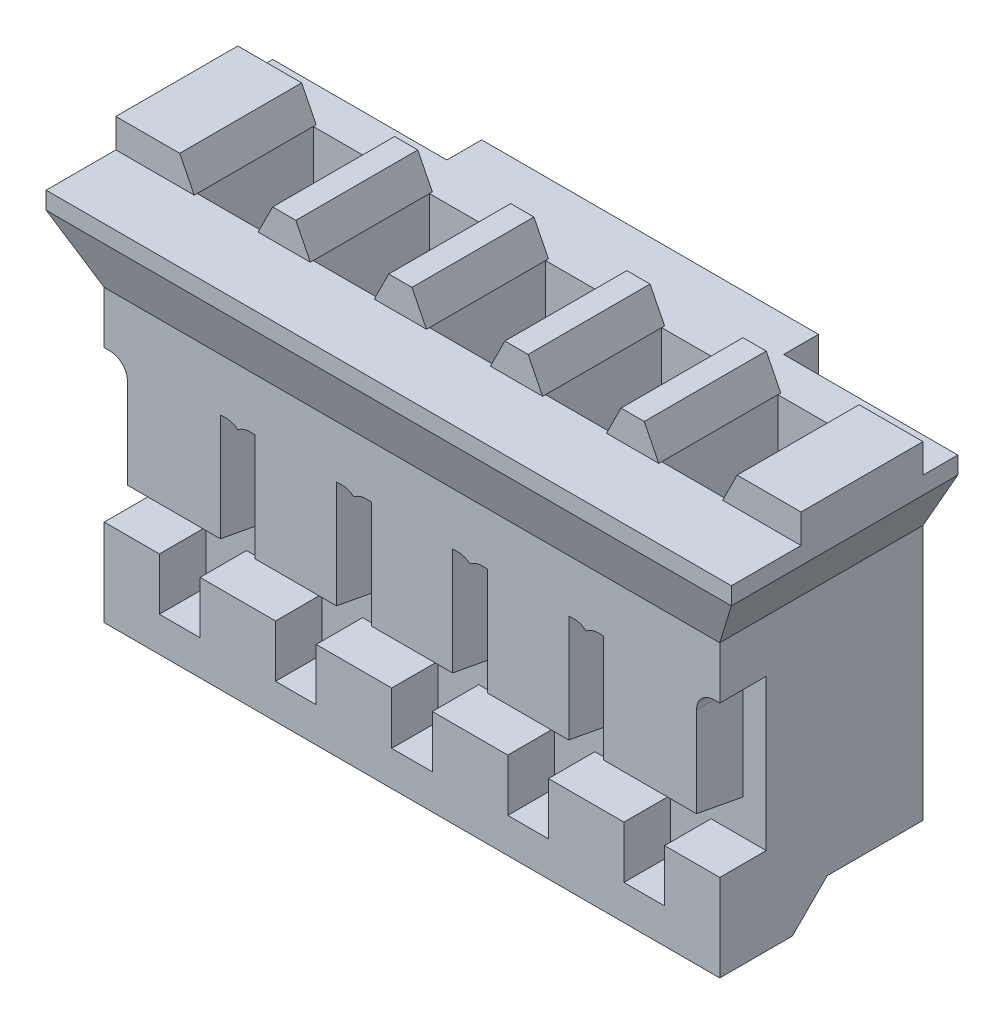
ISO-10303-21;
HEADER;
FILE_DESCRIPTION(('STEP AP214'),'2;1');
FILE_NAME('part.step','',(''),(''),'','','');
FILE_SCHEMA(('AUTOMOTIVE_DESIGN { 1 0 10303 214 1 1 1 1 }'));
ENDSEC;
DATA;
#1=APPLICATION_CONTEXT('core data for automotive mechanical design processes');
#2=APPLICATION_PROTOCOL_DEFINITION('international standard','automotive_design',2000,#1);
#3=PRODUCT_CONTEXT('',#1,'mechanical');
#4=PRODUCT('Part','Part','',(#3));
#5=PRODUCT_RELATED_PRODUCT_CATEGORY('part','',(#4));
#6=PRODUCT_DEFINITION_FORMATION('','',#4);
#7=PRODUCT_DEFINITION_CONTEXT('part definition',#1,'design');
#8=PRODUCT_DEFINITION('design','',#6,#7);
#9=PRODUCT_DEFINITION_SHAPE('','',#8);
#10=(LENGTH_UNIT() NAMED_UNIT(*) SI_UNIT(.MILLI.,.METRE.));
#11=(NAMED_UNIT(*) PLANE_ANGLE_UNIT() SI_UNIT($,.RADIAN.));
#12=(NAMED_UNIT(*) SI_UNIT($,.STERADIAN.) SOLID_ANGLE_UNIT());
#13=UNCERTAINTY_MEASURE_WITH_UNIT(LENGTH_MEASURE(1.E-05),#10,'distance_accuracy_value','');
#14=(GEOMETRIC_REPRESENTATION_CONTEXT(3) GLOBAL_UNCERTAINTY_ASSIGNED_CONTEXT((#13)) GLOBAL_UNIT_ASSIGNED_CONTEXT((#10,
#11,#12)) REPRESENTATION_CONTEXT('',''));
#15=CARTESIAN_POINT('',(0.,0.,0.));
#16=DIRECTION('',(0.,0.,1.));
#17=DIRECTION('',(1.,0.,0.));
#18=AXIS2_PLACEMENT_3D('',#15,#16,#17);
#19=CARTESIAN_POINT('',(-1.9,6.35,1.05));
#20=DIRECTION('',(0.,1.,0.));
#21=DIRECTION('',(0.,0.,1.));
#22=AXIS2_PLACEMENT_3D('',#19,#20,#21);
#23=PLANE('',#22);
#24=DIRECTION('',(-1.,0.,0.));
#25=VECTOR('',#24,1.);
#26=CARTESIAN_POINT('',(7.45,6.35,-1.));
#27=LINE('',#26,#25);
#28=CARTESIAN_POINT('',(8.55,6.35,-1.));
#29=VERTEX_POINT('',#28);
#30=CARTESIAN_POINT('',(7.45,6.35,-1.));
#31=VERTEX_POINT('',#30);
#32=EDGE_CURVE('E45',#29,#31,#27,.T.);
#33=ORIENTED_EDGE('',*,*,#32,.F.);
#34=DIRECTION('',(0.,0.,1.));
#35=VECTOR('',#34,1.);
#36=CARTESIAN_POINT('',(8.55,6.35,-2.250025));
#37=LINE('',#36,#35);
#38=CARTESIAN_POINT('',(8.55,6.35,-1.05));
#39=VERTEX_POINT('',#38);
#40=EDGE_CURVE('E905',#39,#29,#37,.T.);
#41=ORIENTED_EDGE('',*,*,#40,.F.);
#42=DIRECTION('',(1.,0.,0.));
#43=VECTOR('',#42,1.);
#44=CARTESIAN_POINT('',(-1.9,6.35,-1.05));
#45=LINE('',#44,#43);
#46=CARTESIAN_POINT('',(9.9,6.35,-1.05));
#47=VERTEX_POINT('',#46);
#48=EDGE_CURVE('E1270',#39,#47,#45,.T.);
#49=ORIENTED_EDGE('',*,*,#48,.T.);
#50=DIRECTION('',(0.,0.,1.));
#51=VECTOR('',#50,1.);
#52=CARTESIAN_POINT('',(9.9,6.35,-1.65));
#53=LINE('',#52,#51);
#54=CARTESIAN_POINT('',(9.9,6.35,-1.65));
#55=VERTEX_POINT('',#54);
#56=EDGE_CURVE('E2813',#55,#47,#53,.T.);
#57=ORIENTED_EDGE('',*,*,#56,.F.);
#58=DIRECTION('',(1.,0.,0.));
#59=VECTOR('',#58,1.);
#60=CARTESIAN_POINT('',(-1.9,6.35,-1.65));
#61=LINE('',#60,#59);
#62=CARTESIAN_POINT('',(6.89999999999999,6.35,-1.65));
#63=VERTEX_POINT('',#62);
#64=EDGE_CURVE('E1234',#63,#55,#61,.T.);
#65=ORIENTED_EDGE('',*,*,#64,.F.);
#66=DIRECTION('',(0.,0.,-1.));
#67=VECTOR('',#66,1.);
#68=CARTESIAN_POINT('',(6.9,6.35,-1.65));
#69=LINE('',#68,#67);
#70=CARTESIAN_POINT('',(6.9,6.35,-2.25));
#71=VERTEX_POINT('',#70);
#72=EDGE_CURVE('E1190',#63,#71,#69,.T.);
#73=ORIENTED_EDGE('',*,*,#72,.T.);
#74=DIRECTION('',(-1.,0.,0.));
#75=VECTOR('',#74,1.);
#76=CARTESIAN_POINT('',(1.1,6.35,-2.25));
#77=LINE('',#76,#75);
#78=CARTESIAN_POINT('',(1.1,6.35,-2.25));
#79=VERTEX_POINT('',#78);
#80=EDGE_CURVE('E1187',#71,#79,#77,.T.);
#81=ORIENTED_EDGE('',*,*,#80,.T.);
#82=DIRECTION('',(0.,0.,1.));
#83=VECTOR('',#82,1.);
#84=CARTESIAN_POINT('',(1.1,6.35,-1.65));
#85=LINE('',#84,#83);
#86=CARTESIAN_POINT('',(1.1,6.35,-1.65));
#87=VERTEX_POINT('',#86);
#88=EDGE_CURVE('E1186',#79,#87,#85,.T.);
#89=ORIENTED_EDGE('',*,*,#88,.T.);
#90=CARTESIAN_POINT('',(-1.9,6.35,-1.65));
#91=VERTEX_POINT('',#90);
#92=EDGE_CURVE('E1265',#91,#87,#61,.T.);
#93=ORIENTED_EDGE('',*,*,#92,.F.);
#94=DIRECTION('',(0.,0.,1.));
#95=VECTOR('',#94,1.);
#96=CARTESIAN_POINT('',(-1.9,6.35,-1.65));
#97=LINE('',#96,#95);
#98=CARTESIAN_POINT('',(-1.9,6.35,-1.05));
#99=VERTEX_POINT('',#98);
#100=EDGE_CURVE('E1268',#91,#99,#97,.T.);
#101=ORIENTED_EDGE('',*,*,#100,.T.);
#102=CARTESIAN_POINT('',(-0.55,6.35,-1.05));
#103=VERTEX_POINT('',#102);
#104=EDGE_CURVE('E1348',#99,#103,#45,.T.);
#105=ORIENTED_EDGE('',*,*,#104,.T.);
#106=DIRECTION('',(0.,0.,1.));
#107=VECTOR('',#106,1.);
#108=CARTESIAN_POINT('',(-0.55,6.35,-2.250025));
#109=LINE('',#108,#107);
#110=CARTESIAN_POINT('',(-0.55,6.35,-1.));
#111=VERTEX_POINT('',#110);
#112=EDGE_CURVE('E1178',#103,#111,#109,.T.);
#113=ORIENTED_EDGE('',*,*,#112,.T.);
#114=DIRECTION('',(-1.,0.,0.));
#115=VECTOR('',#114,1.);
#116=CARTESIAN_POINT('',(-0.55,6.35,-1.));
#117=LINE('',#116,#115);
#118=CARTESIAN_POINT('',(0.55,6.35,-1.));
#119=VERTEX_POINT('',#118);
#120=EDGE_CURVE('E988',#119,#111,#117,.T.);
#121=ORIENTED_EDGE('',*,*,#120,.F.);
#122=DIRECTION('',(0.,0.,1.));
#123=VECTOR('',#122,1.);
#124=CARTESIAN_POINT('',(0.55,6.35,-2.250025));
#125=LINE('',#124,#123);
#126=CARTESIAN_POINT('',(0.55,6.35,-1.05));
#127=VERTEX_POINT('',#126);
#128=EDGE_CURVE('E1174',#127,#119,#125,.T.);
#129=ORIENTED_EDGE('',*,*,#128,.F.);
#130=CARTESIAN_POINT('',(1.45,6.35,-1.05));
#131=VERTEX_POINT('',#130);
#132=EDGE_CURVE('E1349',#127,#131,#45,.T.);
#133=ORIENTED_EDGE('',*,*,#132,.T.);
#134=DIRECTION('',(0.,0.,1.));
#135=VECTOR('',#134,1.);
#136=CARTESIAN_POINT('',(1.45,6.35,-2.250025));
#137=LINE('',#136,#135);
#138=CARTESIAN_POINT('',(1.45,6.35,-1.));
#139=VERTEX_POINT('',#138);
#140=EDGE_CURVE('E971',#131,#139,#137,.T.);
#141=ORIENTED_EDGE('',*,*,#140,.T.);
#142=DIRECTION('',(-1.,0.,0.));
#143=VECTOR('',#142,1.);
#144=CARTESIAN_POINT('',(1.45,6.35,-1.));
#145=LINE('',#144,#143);
#146=CARTESIAN_POINT('',(2.55,6.35,-1.));
#147=VERTEX_POINT('',#146);
#148=EDGE_CURVE('E1879',#147,#139,#145,.T.);
#149=ORIENTED_EDGE('',*,*,#148,.F.);
#150=DIRECTION('',(0.,0.,1.));
#151=VECTOR('',#150,1.);
#152=CARTESIAN_POINT('',(2.55,6.35,-2.250025));
#153=LINE('',#152,#151);
#154=CARTESIAN_POINT('',(2.55,6.35,-1.05));
#155=VERTEX_POINT('',#154);
#156=EDGE_CURVE('E967',#155,#147,#153,.T.);
#157=ORIENTED_EDGE('',*,*,#156,.F.);
#158=CARTESIAN_POINT('',(3.45,6.35,-1.05));
#159=VERTEX_POINT('',#158);
#160=EDGE_CURVE('E1352',#155,#159,#45,.T.);
#161=ORIENTED_EDGE('',*,*,#160,.T.);
#162=DIRECTION('',(0.,0.,1.));
#163=VECTOR('',#162,1.);
#164=CARTESIAN_POINT('',(3.45,6.35,-2.250025));
#165=LINE('',#164,#163);
#166=CARTESIAN_POINT('',(3.45,6.35,-1.));
#167=VERTEX_POINT('',#166);
#168=EDGE_CURVE('E949',#159,#167,#165,.T.);
#169=ORIENTED_EDGE('',*,*,#168,.T.);
#170=DIRECTION('',(-1.,0.,0.));
#171=VECTOR('',#170,1.);
#172=CARTESIAN_POINT('',(3.45,6.35,-1.));
#173=LINE('',#172,#171);
#174=CARTESIAN_POINT('',(4.55,6.35,-1.));
#175=VERTEX_POINT('',#174);
#176=EDGE_CURVE('E1849',#175,#167,#173,.T.);
#177=ORIENTED_EDGE('',*,*,#176,.F.);
#178=DIRECTION('',(0.,0.,1.));
#179=VECTOR('',#178,1.);
#180=CARTESIAN_POINT('',(4.55,6.35,-2.250025));
#181=LINE('',#180,#179);
#182=CARTESIAN_POINT('',(4.55,6.35,-1.05));
#183=VERTEX_POINT('',#182);
#184=EDGE_CURVE('E945',#183,#175,#181,.T.);
#185=ORIENTED_EDGE('',*,*,#184,.F.);
#186=CARTESIAN_POINT('',(5.45,6.35,-1.05));
#187=VERTEX_POINT('',#186);
#188=EDGE_CURVE('E1358',#183,#187,#45,.T.);
#189=ORIENTED_EDGE('',*,*,#188,.T.);
#190=DIRECTION('',(0.,0.,1.));
#191=VECTOR('',#190,1.);
#192=CARTESIAN_POINT('',(5.45,6.35,-2.250025));
#193=LINE('',#192,#191);
#194=CARTESIAN_POINT('',(5.45,6.35,-1.));
#195=VERTEX_POINT('',#194);
#196=EDGE_CURVE('E927',#187,#195,#193,.T.);
#197=ORIENTED_EDGE('',*,*,#196,.T.);
#198=DIRECTION('',(-1.,0.,0.));
#199=VECTOR('',#198,1.);
#200=CARTESIAN_POINT('',(5.45,6.35,-1.));
#201=LINE('',#200,#199);
#202=CARTESIAN_POINT('',(6.55,6.35,-1.));
#203=VERTEX_POINT('',#202);
#204=EDGE_CURVE('E53',#203,#195,#201,.T.);
#205=ORIENTED_EDGE('',*,*,#204,.F.);
#206=DIRECTION('',(0.,0.,1.));
#207=VECTOR('',#206,1.);
#208=CARTESIAN_POINT('',(6.55,6.35,-2.250025));
#209=LINE('',#208,#207);
#210=CARTESIAN_POINT('',(6.55,6.35,-1.05));
#211=VERTEX_POINT('',#210);
#212=EDGE_CURVE('E923',#211,#203,#209,.T.);
#213=ORIENTED_EDGE('',*,*,#212,.F.);
#214=CARTESIAN_POINT('',(7.45,6.35,-1.05));
#215=VERTEX_POINT('',#214);
#216=EDGE_CURVE('E1353',#211,#215,#45,.T.);
#217=ORIENTED_EDGE('',*,*,#216,.T.);
#218=DIRECTION('',(0.,0.,1.));
#219=VECTOR('',#218,1.);
#220=CARTESIAN_POINT('',(7.45,6.35,-2.250025));
#221=LINE('',#220,#219);
#222=EDGE_CURVE('E899',#215,#31,#221,.T.);
#223=ORIENTED_EDGE('',*,*,#222,.T.);
#224=EDGE_LOOP('',(#33,#41,#49,#57,#65,#73,#81,#89,#93,#101,#105,#113,#121,#129,#133,#141,#149,
#157,#161,#169,#177,#185,#189,#197,#205,#213,#217,#223));
#225=FACE_BOUND('',#224,.T.);
#226=ADVANCED_FACE('F30',(#225),#23,.T.);
#227=CARTESIAN_POINT('',(-1.9,1.5,1.05));
#228=DIRECTION('',(0.,1.,0.));
#229=DIRECTION('',(0.,0.,1.));
#230=AXIS2_PLACEMENT_3D('',#227,#228,#229);
#231=PLANE('',#230);
#232=DIRECTION('',(0.,0.,1.));
#233=VECTOR('',#232,1.);
#234=CARTESIAN_POINT('',(2.35,1.5,1.05));
#235=LINE('',#234,#233);
#236=CARTESIAN_POINT('',(2.35,1.5,1.05));
#237=VERTEX_POINT('',#236);
#238=CARTESIAN_POINT('',(2.35,1.5,1.85));
#239=VERTEX_POINT('',#238);
#240=EDGE_CURVE('E1720',#237,#239,#235,.T.);
#241=ORIENTED_EDGE('',*,*,#240,.T.);
#242=DIRECTION('',(1.,0.,0.));
#243=VECTOR('',#242,1.);
#244=CARTESIAN_POINT('',(-1.9,1.5,1.85));
#245=LINE('',#244,#243);
#246=CARTESIAN_POINT('',(3.65,1.5,1.85));
#247=VERTEX_POINT('',#246);
#248=EDGE_CURVE('E3680',#239,#247,#245,.T.);
#249=ORIENTED_EDGE('',*,*,#248,.T.);
#250=DIRECTION('',(0.,0.,1.));
#251=VECTOR('',#250,1.);
#252=CARTESIAN_POINT('',(3.65,1.5,1.05));
#253=LINE('',#252,#251);
#254=CARTESIAN_POINT('',(3.65,1.5,1.05));
#255=VERTEX_POINT('',#254);
#256=EDGE_CURVE('E1640',#255,#247,#253,.T.);
#257=ORIENTED_EDGE('',*,*,#256,.F.);
#258=DIRECTION('',(1.,0.,0.));
#259=VECTOR('',#258,1.);
#260=CARTESIAN_POINT('',(-1.9,1.5,1.05));
#261=LINE('',#260,#259);
#262=EDGE_CURVE('E3697',#237,#255,#261,.T.);
#263=ORIENTED_EDGE('',*,*,#262,.F.);
#264=EDGE_LOOP('',(#241,#249,#257,#263));
#265=FACE_BOUND('',#264,.T.);
#266=ADVANCED_FACE('F2182',(#265),#231,.T.);
#267=DIRECTION('',(0.,0.,1.));
#268=VECTOR('',#267,1.);
#269=CARTESIAN_POINT('',(8.35,1.5,1.05));
#270=LINE('',#269,#268);
#271=CARTESIAN_POINT('',(8.35,1.5,1.05));
#272=VERTEX_POINT('',#271);
#273=CARTESIAN_POINT('',(8.35,1.5,1.85));
#274=VERTEX_POINT('',#273);
#275=EDGE_CURVE('E1514',#272,#274,#270,.T.);
#276=ORIENTED_EDGE('',*,*,#275,.T.);
#277=CARTESIAN_POINT('',(9.3,1.5,1.85));
#278=VERTEX_POINT('',#277);
#279=EDGE_CURVE('E1308',#274,#278,#245,.T.);
#280=ORIENTED_EDGE('',*,*,#279,.T.);
#281=DIRECTION('',(0.,0.,1.));
#282=VECTOR('',#281,1.);
#283=CARTESIAN_POINT('',(9.3,1.5,1.05));
#284=LINE('',#283,#282);
#285=CARTESIAN_POINT('',(9.3,1.5,1.05));
#286=VERTEX_POINT('',#285);
#287=EDGE_CURVE('E1138',#286,#278,#284,.T.);
#288=ORIENTED_EDGE('',*,*,#287,.F.);
#289=EDGE_CURVE('E1313',#272,#286,#261,.T.);
#290=ORIENTED_EDGE('',*,*,#289,.F.);
#291=EDGE_LOOP('',(#276,#280,#288,#290));
#292=FACE_BOUND('',#291,.T.);
#293=ADVANCED_FACE('F2051',(#292),#231,.T.);
#294=DIRECTION('',(0.,0.,1.));
#295=VECTOR('',#294,1.);
#296=CARTESIAN_POINT('',(7.65,1.5,1.05));
#297=LINE('',#296,#295);
#298=CARTESIAN_POINT('',(7.65,1.5,1.05));
#299=VERTEX_POINT('',#298);
#300=CARTESIAN_POINT('',(7.65,1.5,1.85));
#301=VERTEX_POINT('',#300);
#302=EDGE_CURVE('E1501',#299,#301,#297,.T.);
#303=ORIENTED_EDGE('',*,*,#302,.F.);
#304=CARTESIAN_POINT('',(6.35,1.5,1.05));
#305=VERTEX_POINT('',#304);
#306=EDGE_CURVE('E2054',#305,#299,#261,.T.);
#307=ORIENTED_EDGE('',*,*,#306,.F.);
#308=DIRECTION('',(0.,0.,1.));
#309=VECTOR('',#308,1.);
#310=CARTESIAN_POINT('',(6.35,1.5,1.05));
#311=LINE('',#310,#309);
#312=CARTESIAN_POINT('',(6.35,1.5,1.85));
#313=VERTEX_POINT('',#312);
#314=EDGE_CURVE('E1583',#305,#313,#311,.T.);
#315=ORIENTED_EDGE('',*,*,#314,.T.);
#316=EDGE_CURVE('E3673',#313,#301,#245,.T.);
#317=ORIENTED_EDGE('',*,*,#316,.T.);
#318=EDGE_LOOP('',(#303,#307,#315,#317));
#319=FACE_BOUND('',#318,.T.);
#320=ADVANCED_FACE('F3385',(#319),#231,.T.);
#321=DIRECTION('',(0.,0.,1.));
#322=VECTOR('',#321,1.);
#323=CARTESIAN_POINT('',(5.65,1.5,1.05));
#324=LINE('',#323,#322);
#325=CARTESIAN_POINT('',(5.65,1.5,1.05));
#326=VERTEX_POINT('',#325);
#327=CARTESIAN_POINT('',(5.65,1.5,1.85));
#328=VERTEX_POINT('',#327);
#329=EDGE_CURVE('E1571',#326,#328,#324,.T.);
#330=ORIENTED_EDGE('',*,*,#329,.F.);
#331=CARTESIAN_POINT('',(4.35,1.5,1.05));
#332=VERTEX_POINT('',#331);
#333=EDGE_CURVE('E2056',#332,#326,#261,.T.);
#334=ORIENTED_EDGE('',*,*,#333,.F.);
#335=DIRECTION('',(0.,0.,1.));
#336=VECTOR('',#335,1.);
#337=CARTESIAN_POINT('',(4.35,1.5,1.05));
#338=LINE('',#337,#336);
#339=CARTESIAN_POINT('',(4.35,1.5,1.85));
#340=VERTEX_POINT('',#339);
#341=EDGE_CURVE('E1652',#332,#340,#338,.T.);
#342=ORIENTED_EDGE('',*,*,#341,.T.);
#343=EDGE_CURVE('E3678',#340,#328,#245,.T.);
#344=ORIENTED_EDGE('',*,*,#343,.T.);
#345=EDGE_LOOP('',(#330,#334,#342,#344));
#346=FACE_BOUND('',#345,.T.);
#347=ADVANCED_FACE('F2849',(#346),#231,.T.);
#348=CARTESIAN_POINT('',(-1.9,2.25,1.85));
#349=DIRECTION('',(0.,-0.982872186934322,0.184288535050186));
#350=DIRECTION('',(0.,-0.184288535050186,-0.982872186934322));
#351=AXIS2_PLACEMENT_3D('',#348,#349,#350);
#352=PLANE('',#351);
#353=DIRECTION('',(0.,0.184288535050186,0.982872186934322));
#354=VECTOR('',#353,1.);
#355=CARTESIAN_POINT('',(3.3,2.25,1.85));
#356=LINE('',#355,#354);
#357=CARTESIAN_POINT('',(3.3,2.1,1.05));
#358=VERTEX_POINT('',#357);
#359=CARTESIAN_POINT('',(3.3,2.25,1.85));
#360=VERTEX_POINT('',#359);
#361=EDGE_CURVE('E1740',#358,#360,#356,.T.);
#362=ORIENTED_EDGE('',*,*,#361,.F.);
#363=DIRECTION('',(1.,0.,0.));
#364=VECTOR('',#363,1.);
#365=CARTESIAN_POINT('',(-1.9,2.1,1.05));
#366=LINE('',#365,#364);
#367=CARTESIAN_POINT('',(4.7,2.1,1.05));
#368=VERTEX_POINT('',#367);
#369=EDGE_CURVE('E1318',#358,#368,#366,.T.);
#370=ORIENTED_EDGE('',*,*,#369,.T.);
#371=DIRECTION('',(0.,-0.184288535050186,-0.982872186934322));
#372=VECTOR('',#371,1.);
#373=CARTESIAN_POINT('',(4.7,2.25,1.85));
#374=LINE('',#373,#372);
#375=CARTESIAN_POINT('',(4.7,2.25,1.85));
#376=VERTEX_POINT('',#375);
#377=EDGE_CURVE('E1738',#376,#368,#374,.T.);
#378=ORIENTED_EDGE('',*,*,#377,.F.);
#379=DIRECTION('',(1.,0.,0.));
#380=VECTOR('',#379,1.);
#381=CARTESIAN_POINT('',(-1.9,2.25,1.85));
#382=LINE('',#381,#380);
#383=EDGE_CURVE('E1324',#360,#376,#382,.T.);
#384=ORIENTED_EDGE('',*,*,#383,.F.);
#385=EDGE_LOOP('',(#362,#370,#378,#384));
#386=FACE_BOUND('',#385,.T.);
#387=ADVANCED_FACE('F2211',(#386),#352,.T.);
#388=DIRECTION('',(0.,0.184288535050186,0.982872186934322));
#389=VECTOR('',#388,1.);
#390=CARTESIAN_POINT('',(5.3,2.25,1.85));
#391=LINE('',#390,#389);
#392=CARTESIAN_POINT('',(5.3,2.1,1.05));
#393=VERTEX_POINT('',#392);
#394=CARTESIAN_POINT('',(5.3,2.25,1.85));
#395=VERTEX_POINT('',#394);
#396=EDGE_CURVE('E1736',#393,#395,#391,.T.);
#397=ORIENTED_EDGE('',*,*,#396,.F.);
#398=CARTESIAN_POINT('',(6.7,2.1,1.05));
#399=VERTEX_POINT('',#398);
#400=EDGE_CURVE('E2063',#393,#399,#366,.T.);
#401=ORIENTED_EDGE('',*,*,#400,.T.);
#402=DIRECTION('',(0.,-0.184288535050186,-0.982872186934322));
#403=VECTOR('',#402,1.);
#404=CARTESIAN_POINT('',(6.7,2.25,1.85));
#405=LINE('',#404,#403);
#406=CARTESIAN_POINT('',(6.7,2.25,1.85));
#407=VERTEX_POINT('',#406);
#408=EDGE_CURVE('E1734',#407,#399,#405,.T.);
#409=ORIENTED_EDGE('',*,*,#408,.F.);
#410=EDGE_CURVE('E2082',#395,#407,#382,.T.);
#411=ORIENTED_EDGE('',*,*,#410,.F.);
#412=EDGE_LOOP('',(#397,#401,#409,#411));
#413=FACE_BOUND('',#412,.T.);
#414=ADVANCED_FACE('F3365',(#413),#352,.T.);
#415=DIRECTION('',(0.,0.184288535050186,0.982872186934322));
#416=VECTOR('',#415,1.);
#417=CARTESIAN_POINT('',(7.3,2.25,1.85));
#418=LINE('',#417,#416);
#419=CARTESIAN_POINT('',(7.3,2.1,1.05));
#420=VERTEX_POINT('',#419);
#421=CARTESIAN_POINT('',(7.3,2.25,1.85));
#422=VERTEX_POINT('',#421);
#423=EDGE_CURVE('E1732',#420,#422,#418,.T.);
#424=ORIENTED_EDGE('',*,*,#423,.F.);
#425=CARTESIAN_POINT('',(8.9,2.1,1.05));
#426=VERTEX_POINT('',#425);
#427=EDGE_CURVE('E1319',#420,#426,#366,.T.);
#428=ORIENTED_EDGE('',*,*,#427,.T.);
#429=DIRECTION('',(0.,-0.184288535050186,-0.982872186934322));
#430=VECTOR('',#429,1.);
#431=CARTESIAN_POINT('',(8.9,2.25,1.85));
#432=LINE('',#431,#430);
#433=CARTESIAN_POINT('',(8.9,2.25,1.85));
#434=VERTEX_POINT('',#433);
#435=EDGE_CURVE('E1730',#434,#426,#432,.T.);
#436=ORIENTED_EDGE('',*,*,#435,.F.);
#437=EDGE_CURVE('E1325',#422,#434,#382,.T.);
#438=ORIENTED_EDGE('',*,*,#437,.F.);
#439=EDGE_LOOP('',(#424,#428,#436,#438));
#440=FACE_BOUND('',#439,.T.);
#441=ADVANCED_FACE('F2094',(#440),#352,.T.);
#442=CARTESIAN_POINT('',(-1.9,6.85,1.05));
#443=DIRECTION('',(0.,0.,1.));
#444=DIRECTION('',(1.,0.,0.));
#445=AXIS2_PLACEMENT_3D('',#442,#443,#444);
#446=PLANE('',#445);
#447=DIRECTION('',(0.447213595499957,0.894427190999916,0.));
#448=VECTOR('',#447,1.);
#449=CARTESIAN_POINT('',(8.55,6.35,1.05));
#450=LINE('',#449,#448);
#451=CARTESIAN_POINT('',(8.55,6.35,1.05));
#452=VERTEX_POINT('',#451);
#453=CARTESIAN_POINT('',(8.8,6.85,1.05));
#454=VERTEX_POINT('',#453);
#455=EDGE_CURVE('E902',#452,#454,#450,.T.);
#456=ORIENTED_EDGE('',*,*,#455,.F.);
#457=DIRECTION('',(1.,0.,0.));
#458=VECTOR('',#457,1.);
#459=CARTESIAN_POINT('',(-1.9,6.35,1.05));
#460=LINE('',#459,#458);
#461=CARTESIAN_POINT('',(9.9,6.35,1.05));
#462=VERTEX_POINT('',#461);
#463=EDGE_CURVE('E1338',#452,#462,#460,.T.);
#464=ORIENTED_EDGE('',*,*,#463,.T.);
#465=DIRECTION('',(0.,-1.,0.));
#466=VECTOR('',#465,1.);
#467=CARTESIAN_POINT('',(9.9,6.85,1.05));
#468=LINE('',#467,#466);
#469=CARTESIAN_POINT('',(9.9,6.85,1.05));
#470=VERTEX_POINT('',#469);
#471=EDGE_CURVE('E1416',#470,#462,#468,.T.);
#472=ORIENTED_EDGE('',*,*,#471,.F.);
#473=DIRECTION('',(1.,0.,0.));
#474=VECTOR('',#473,1.);
#475=CARTESIAN_POINT('',(-1.9,6.85,1.05));
#476=LINE('',#475,#474);
#477=EDGE_CURVE('E1343',#454,#470,#476,.T.);
#478=ORIENTED_EDGE('',*,*,#477,.F.);
#479=EDGE_LOOP('',(#456,#464,#472,#478));
#480=FACE_BOUND('',#479,.T.);
#481=ADVANCED_FACE('F1421',(#480),#446,.T.);
#482=CARTESIAN_POINT('',(-1.9,6.85,-1.05));
#483=DIRECTION('',(0.,1.,0.));
#484=DIRECTION('',(0.,0.,1.));
#485=AXIS2_PLACEMENT_3D('',#482,#483,#484);
#486=PLANE('',#485);
#487=DIRECTION('',(0.,0.,1.));
#488=VECTOR('',#487,1.);
#489=CARTESIAN_POINT('',(8.8,6.85,-2.250025));
#490=LINE('',#489,#488);
#491=CARTESIAN_POINT('',(8.8,6.85,-1.05));
#492=VERTEX_POINT('',#491);
#493=EDGE_CURVE('E911',#492,#454,#490,.T.);
#494=ORIENTED_EDGE('',*,*,#493,.T.);
#495=ORIENTED_EDGE('',*,*,#477,.T.);
#496=DIRECTION('',(0.,0.,1.));
#497=VECTOR('',#496,1.);
#498=CARTESIAN_POINT('',(9.9,6.85,-1.05));
#499=LINE('',#498,#497);
#500=CARTESIAN_POINT('',(9.9,6.85,-1.05));
#501=VERTEX_POINT('',#500);
#502=EDGE_CURVE('E1406',#501,#470,#499,.T.);
#503=ORIENTED_EDGE('',*,*,#502,.F.);
#504=DIRECTION('',(1.,0.,0.));
#505=VECTOR('',#504,1.);
#506=CARTESIAN_POINT('',(-1.9,6.85,-1.05));
#507=LINE('',#506,#505);
#508=EDGE_CURVE('E1347',#492,#501,#507,.T.);
#509=ORIENTED_EDGE('',*,*,#508,.F.);
#510=EDGE_LOOP('',(#494,#495,#503,#509));
#511=FACE_BOUND('',#510,.T.);
#512=ADVANCED_FACE('F1404',(#511),#486,.T.);
#513=CARTESIAN_POINT('',(-1.9,6.35,-1.05));
#514=DIRECTION('',(0.,0.,-1.));
#515=DIRECTION('',(-1.,0.,0.));
#516=AXIS2_PLACEMENT_3D('',#513,#514,#515);
#517=PLANE('',#516);
#518=DIRECTION('',(-0.447213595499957,-0.894427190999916,0.));
#519=VECTOR('',#518,1.);
#520=CARTESIAN_POINT('',(6.46000000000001,2.17,-1.05));
#521=LINE('',#520,#519);
#522=EDGE_CURVE('E910',#492,#39,#521,.T.);
#523=ORIENTED_EDGE('',*,*,#522,.F.);
#524=ORIENTED_EDGE('',*,*,#508,.T.);
#525=DIRECTION('',(0.,1.,0.));
#526=VECTOR('',#525,1.);
#527=CARTESIAN_POINT('',(9.9,6.35,-1.05));
#528=LINE('',#527,#526);
#529=EDGE_CURVE('E1419',#47,#501,#528,.T.);
#530=ORIENTED_EDGE('',*,*,#529,.F.);
#531=ORIENTED_EDGE('',*,*,#48,.F.);
#532=EDGE_LOOP('',(#523,#524,#530,#531));
#533=FACE_BOUND('',#532,.T.);
#534=ADVANCED_FACE('F2817',(#533),#517,.T.);
#535=DIRECTION('',(0.447213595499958,-0.894427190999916,0.));
#536=VECTOR('',#535,1.);
#537=CARTESIAN_POINT('',(7.2,6.85,1.05));
#538=LINE('',#537,#536);
#539=CARTESIAN_POINT('',(7.2,6.85,1.05));
#540=VERTEX_POINT('',#539);
#541=CARTESIAN_POINT('',(7.45,6.35,1.05));
#542=VERTEX_POINT('',#541);
#543=EDGE_CURVE('E897',#540,#542,#538,.T.);
#544=ORIENTED_EDGE('',*,*,#543,.F.);
#545=CARTESIAN_POINT('',(6.8,6.85,1.05));
#546=VERTEX_POINT('',#545);
#547=EDGE_CURVE('E1391',#546,#540,#476,.T.);
#548=ORIENTED_EDGE('',*,*,#547,.F.);
#549=DIRECTION('',(0.447213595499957,0.894427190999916,0.));
#550=VECTOR('',#549,1.);
#551=CARTESIAN_POINT('',(6.55,6.35,1.05));
#552=LINE('',#551,#550);
#553=CARTESIAN_POINT('',(6.55,6.35,1.05));
#554=VERTEX_POINT('',#553);
#555=EDGE_CURVE('E916',#554,#546,#552,.T.);
#556=ORIENTED_EDGE('',*,*,#555,.F.);
#557=EDGE_CURVE('E1749',#554,#542,#460,.T.);
#558=ORIENTED_EDGE('',*,*,#557,.T.);
#559=EDGE_LOOP('',(#544,#548,#556,#558));
#560=FACE_BOUND('',#559,.T.);
#561=ADVANCED_FACE('F1802',(#560),#446,.T.);
#562=DIRECTION('',(0.,0.,1.));
#563=VECTOR('',#562,1.);
#564=CARTESIAN_POINT('',(7.2,6.85,-2.250025));
#565=LINE('',#564,#563);
#566=CARTESIAN_POINT('',(7.2,6.85,-1.05));
#567=VERTEX_POINT('',#566);
#568=EDGE_CURVE('E900',#567,#540,#565,.T.);
#569=ORIENTED_EDGE('',*,*,#568,.F.);
#570=CARTESIAN_POINT('',(6.8,6.85,-1.05));
#571=VERTEX_POINT('',#570);
#572=EDGE_CURVE('E1350',#571,#567,#507,.T.);
#573=ORIENTED_EDGE('',*,*,#572,.F.);
#574=DIRECTION('',(0.,0.,1.));
#575=VECTOR('',#574,1.);
#576=CARTESIAN_POINT('',(6.8,6.85,-2.250025));
#577=LINE('',#576,#575);
#578=EDGE_CURVE('E919',#571,#546,#577,.T.);
#579=ORIENTED_EDGE('',*,*,#578,.T.);
#580=ORIENTED_EDGE('',*,*,#547,.T.);
#581=EDGE_LOOP('',(#569,#573,#579,#580));
#582=FACE_BOUND('',#581,.T.);
#583=ADVANCED_FACE('F1801',(#582),#486,.T.);
#584=DIRECTION('',(-0.447213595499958,0.894427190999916,0.));
#585=VECTOR('',#584,1.);
#586=CARTESIAN_POINT('',(5.58,10.09,-1.05));
#587=LINE('',#586,#585);
#588=EDGE_CURVE('E908',#215,#567,#587,.T.);
#589=ORIENTED_EDGE('',*,*,#588,.F.);
#590=ORIENTED_EDGE('',*,*,#216,.F.);
#591=DIRECTION('',(-0.447213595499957,-0.894427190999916,0.));
#592=VECTOR('',#591,1.);
#593=CARTESIAN_POINT('',(4.86000000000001,2.97,-1.05));
#594=LINE('',#593,#592);
#595=EDGE_CURVE('E933',#571,#211,#594,.T.);
#596=ORIENTED_EDGE('',*,*,#595,.F.);
#597=ORIENTED_EDGE('',*,*,#572,.T.);
#598=EDGE_LOOP('',(#589,#590,#596,#597));
#599=FACE_BOUND('',#598,.T.);
#600=ADVANCED_FACE('F1800',(#599),#517,.T.);
#601=DIRECTION('',(0.447213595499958,-0.894427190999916,0.));
#602=VECTOR('',#601,1.);
#603=CARTESIAN_POINT('',(5.2,6.85,1.05));
#604=LINE('',#603,#602);
#605=CARTESIAN_POINT('',(5.2,6.85,1.05));
#606=VERTEX_POINT('',#605);
#607=CARTESIAN_POINT('',(5.45,6.35,1.05));
#608=VERTEX_POINT('',#607);
#609=EDGE_CURVE('E913',#606,#608,#604,.T.);
#610=ORIENTED_EDGE('',*,*,#609,.F.);
#611=CARTESIAN_POINT('',(4.8,6.85,1.05));
#612=VERTEX_POINT('',#611);
#613=EDGE_CURVE('E1388',#612,#606,#476,.T.);
#614=ORIENTED_EDGE('',*,*,#613,.F.);
#615=DIRECTION('',(0.447213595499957,0.894427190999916,0.));
#616=VECTOR('',#615,1.);
#617=CARTESIAN_POINT('',(4.55,6.35,1.05));
#618=LINE('',#617,#616);
#619=CARTESIAN_POINT('',(4.55,6.35,1.05));
#620=VERTEX_POINT('',#619);
#621=EDGE_CURVE('E938',#620,#612,#618,.T.);
#622=ORIENTED_EDGE('',*,*,#621,.F.);
#623=EDGE_CURVE('E1750',#620,#608,#460,.T.);
#624=ORIENTED_EDGE('',*,*,#623,.T.);
#625=EDGE_LOOP('',(#610,#614,#622,#624));
#626=FACE_BOUND('',#625,.T.);
#627=ADVANCED_FACE('F2825',(#626),#446,.T.);
#628=DIRECTION('',(0.,0.,1.));
#629=VECTOR('',#628,1.);
#630=CARTESIAN_POINT('',(5.2,6.85,-2.250025));
#631=LINE('',#630,#629);
#632=CARTESIAN_POINT('',(5.2,6.85,-1.05));
#633=VERTEX_POINT('',#632);
#634=EDGE_CURVE('E918',#633,#606,#631,.T.);
#635=ORIENTED_EDGE('',*,*,#634,.F.);
#636=CARTESIAN_POINT('',(4.8,6.85,-1.05));
#637=VERTEX_POINT('',#636);
#638=EDGE_CURVE('E1789',#637,#633,#507,.T.);
#639=ORIENTED_EDGE('',*,*,#638,.F.);
#640=DIRECTION('',(0.,0.,1.));
#641=VECTOR('',#640,1.);
#642=CARTESIAN_POINT('',(4.8,6.85,-2.250025));
#643=LINE('',#642,#641);
#644=EDGE_CURVE('E941',#637,#612,#643,.T.);
#645=ORIENTED_EDGE('',*,*,#644,.T.);
#646=ORIENTED_EDGE('',*,*,#613,.T.);
#647=EDGE_LOOP('',(#635,#639,#645,#646));
#648=FACE_BOUND('',#647,.T.);
#649=ADVANCED_FACE('F2851',(#648),#486,.T.);
#650=DIRECTION('',(-0.447213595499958,0.894427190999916,0.));
#651=VECTOR('',#650,1.);
#652=CARTESIAN_POINT('',(3.98,9.29,-1.05));
#653=LINE('',#652,#651);
#654=EDGE_CURVE('E922',#187,#633,#653,.T.);
#655=ORIENTED_EDGE('',*,*,#654,.F.);
#656=ORIENTED_EDGE('',*,*,#188,.F.);
#657=DIRECTION('',(-0.447213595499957,-0.894427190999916,0.));
#658=VECTOR('',#657,1.);
#659=CARTESIAN_POINT('',(3.26,3.77,-1.05));
#660=LINE('',#659,#658);
#661=EDGE_CURVE('E955',#637,#183,#660,.T.);
#662=ORIENTED_EDGE('',*,*,#661,.F.);
#663=ORIENTED_EDGE('',*,*,#638,.T.);
#664=EDGE_LOOP('',(#655,#656,#662,#663));
#665=FACE_BOUND('',#664,.T.);
#666=ADVANCED_FACE('F2829',(#665),#517,.T.);
#667=DIRECTION('',(0.447213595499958,-0.894427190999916,0.));
#668=VECTOR('',#667,1.);
#669=CARTESIAN_POINT('',(3.2,6.85,1.05));
#670=LINE('',#669,#668);
#671=CARTESIAN_POINT('',(3.2,6.85,1.05));
#672=VERTEX_POINT('',#671);
#673=CARTESIAN_POINT('',(3.45,6.35,1.05));
#674=VERTEX_POINT('',#673);
#675=EDGE_CURVE('E935',#672,#674,#670,.T.);
#676=ORIENTED_EDGE('',*,*,#675,.F.);
#677=CARTESIAN_POINT('',(2.8,6.85,1.05));
#678=VERTEX_POINT('',#677);
#679=EDGE_CURVE('E1385',#678,#672,#476,.T.);
#680=ORIENTED_EDGE('',*,*,#679,.F.);
#681=DIRECTION('',(0.447213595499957,0.894427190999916,0.));
#682=VECTOR('',#681,1.);
#683=CARTESIAN_POINT('',(2.55,6.35,1.05));
#684=LINE('',#683,#682);
#685=CARTESIAN_POINT('',(2.55,6.35,1.05));
#686=VERTEX_POINT('',#685);
#687=EDGE_CURVE('E960',#686,#678,#684,.T.);
#688=ORIENTED_EDGE('',*,*,#687,.F.);
#689=EDGE_CURVE('E1754',#686,#674,#460,.T.);
#690=ORIENTED_EDGE('',*,*,#689,.T.);
#691=EDGE_LOOP('',(#676,#680,#688,#690));
#692=FACE_BOUND('',#691,.T.);
#693=ADVANCED_FACE('F2850',(#692),#446,.T.);
#694=DIRECTION('',(0.,0.,1.));
#695=VECTOR('',#694,1.);
#696=CARTESIAN_POINT('',(3.2,6.85,-2.250025));
#697=LINE('',#696,#695);
#698=CARTESIAN_POINT('',(3.2,6.85,-1.05));
#699=VERTEX_POINT('',#698);
#700=EDGE_CURVE('E940',#699,#672,#697,.T.);
#701=ORIENTED_EDGE('',*,*,#700,.F.);
#702=CARTESIAN_POINT('',(2.8,6.85,-1.05));
#703=VERTEX_POINT('',#702);
#704=EDGE_CURVE('E1375',#703,#699,#507,.T.);
#705=ORIENTED_EDGE('',*,*,#704,.F.);
#706=DIRECTION('',(0.,0.,1.));
#707=VECTOR('',#706,1.);
#708=CARTESIAN_POINT('',(2.8,6.85,-2.250025));
#709=LINE('',#708,#707);
#710=EDGE_CURVE('E963',#703,#678,#709,.T.);
#711=ORIENTED_EDGE('',*,*,#710,.T.);
#712=ORIENTED_EDGE('',*,*,#679,.T.);
#713=EDGE_LOOP('',(#701,#705,#711,#712));
#714=FACE_BOUND('',#713,.T.);
#715=ADVANCED_FACE('F1383',(#714),#486,.T.);
#716=DIRECTION('',(-0.447213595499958,0.894427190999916,0.));
#717=VECTOR('',#716,1.);
#718=CARTESIAN_POINT('',(2.38,8.49,-1.05));
#719=LINE('',#718,#717);
#720=EDGE_CURVE('E944',#159,#699,#719,.T.);
#721=ORIENTED_EDGE('',*,*,#720,.F.);
#722=ORIENTED_EDGE('',*,*,#160,.F.);
#723=DIRECTION('',(-0.447213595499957,-0.894427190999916,0.));
#724=VECTOR('',#723,1.);
#725=CARTESIAN_POINT('',(1.66,4.57,-1.05));
#726=LINE('',#725,#724);
#727=EDGE_CURVE('E977',#703,#155,#726,.T.);
#728=ORIENTED_EDGE('',*,*,#727,.F.);
#729=ORIENTED_EDGE('',*,*,#704,.T.);
#730=EDGE_LOOP('',(#721,#722,#728,#729));
#731=FACE_BOUND('',#730,.T.);
#732=ADVANCED_FACE('F1372',(#731),#517,.T.);
#733=CARTESIAN_POINT('',(0.35,1.5,1.85));
#734=VERTEX_POINT('',#733);
#735=CARTESIAN_POINT('',(1.65,1.5,1.85));
#736=VERTEX_POINT('',#735);
#737=EDGE_CURVE('E1307',#734,#736,#245,.T.);
#738=ORIENTED_EDGE('',*,*,#737,.T.);
#739=DIRECTION('',(0.,0.,1.));
#740=VECTOR('',#739,1.);
#741=CARTESIAN_POINT('',(1.65,1.5,1.05));
#742=LINE('',#741,#740);
#743=CARTESIAN_POINT('',(1.65,1.5,1.05));
#744=VERTEX_POINT('',#743);
#745=EDGE_CURVE('E1708',#744,#736,#742,.T.);
#746=ORIENTED_EDGE('',*,*,#745,.F.);
#747=CARTESIAN_POINT('',(0.35,1.5,1.05));
#748=VERTEX_POINT('',#747);
#749=EDGE_CURVE('E1312',#748,#744,#261,.T.);
#750=ORIENTED_EDGE('',*,*,#749,.F.);
#751=DIRECTION('',(0.,0.,1.));
#752=VECTOR('',#751,1.);
#753=CARTESIAN_POINT('',(0.35,1.5,1.05));
#754=LINE('',#753,#752);
#755=EDGE_CURVE('E1106',#748,#734,#754,.T.);
#756=ORIENTED_EDGE('',*,*,#755,.T.);
#757=EDGE_LOOP('',(#738,#746,#750,#756));
#758=FACE_BOUND('',#757,.T.);
#759=ADVANCED_FACE('F2217',(#758),#231,.T.);
#760=DIRECTION('',(0.,-0.184288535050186,-0.982872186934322));
#761=VECTOR('',#760,1.);
#762=CARTESIAN_POINT('',(0.7,2.25,1.85));
#763=LINE('',#762,#761);
#764=CARTESIAN_POINT('',(0.7,2.25,1.85));
#765=VERTEX_POINT('',#764);
#766=CARTESIAN_POINT('',(0.7,2.1,1.05));
#767=VERTEX_POINT('',#766);
#768=EDGE_CURVE('E1742',#765,#767,#763,.T.);
#769=ORIENTED_EDGE('',*,*,#768,.F.);
#770=CARTESIAN_POINT('',(-0.9,2.25,1.85));
#771=VERTEX_POINT('',#770);
#772=EDGE_CURVE('E1323',#771,#765,#382,.T.);
#773=ORIENTED_EDGE('',*,*,#772,.F.);
#774=DIRECTION('',(0.,0.184288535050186,0.982872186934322));
#775=VECTOR('',#774,1.);
#776=CARTESIAN_POINT('',(-0.9,2.25,1.85));
#777=LINE('',#776,#775);
#778=CARTESIAN_POINT('',(-0.9,2.1,1.05));
#779=VERTEX_POINT('',#778);
#780=EDGE_CURVE('E1115',#779,#771,#777,.T.);
#781=ORIENTED_EDGE('',*,*,#780,.F.);
#782=EDGE_CURVE('E1317',#779,#767,#366,.T.);
#783=ORIENTED_EDGE('',*,*,#782,.T.);
#784=EDGE_LOOP('',(#769,#773,#781,#783));
#785=FACE_BOUND('',#784,.T.);
#786=ADVANCED_FACE('F2212',(#785),#352,.T.);
#787=DIRECTION('',(0.447213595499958,-0.894427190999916,0.));
#788=VECTOR('',#787,1.);
#789=CARTESIAN_POINT('',(1.2,6.85,1.05));
#790=LINE('',#789,#788);
#791=CARTESIAN_POINT('',(1.2,6.85,1.05));
#792=VERTEX_POINT('',#791);
#793=CARTESIAN_POINT('',(1.45,6.35,1.05));
#794=VERTEX_POINT('',#793);
#795=EDGE_CURVE('E957',#792,#794,#790,.T.);
#796=ORIENTED_EDGE('',*,*,#795,.F.);
#797=CARTESIAN_POINT('',(0.8,6.85,1.05));
#798=VERTEX_POINT('',#797);
#799=EDGE_CURVE('E1342',#798,#792,#476,.T.);
#800=ORIENTED_EDGE('',*,*,#799,.F.);
#801=DIRECTION('',(0.447213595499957,0.894427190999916,0.));
#802=VECTOR('',#801,1.);
#803=CARTESIAN_POINT('',(0.55,6.35,1.05));
#804=LINE('',#803,#802);
#805=CARTESIAN_POINT('',(0.55,6.35,1.05));
#806=VERTEX_POINT('',#805);
#807=EDGE_CURVE('E1167',#806,#798,#804,.T.);
#808=ORIENTED_EDGE('',*,*,#807,.F.);
#809=EDGE_CURVE('E1337',#806,#794,#460,.T.);
#810=ORIENTED_EDGE('',*,*,#809,.T.);
#811=EDGE_LOOP('',(#796,#800,#808,#810));
#812=FACE_BOUND('',#811,.T.);
#813=ADVANCED_FACE('F1766',(#812),#446,.T.);
#814=DIRECTION('',(0.,0.,1.));
#815=VECTOR('',#814,1.);
#816=CARTESIAN_POINT('',(1.2,6.85,-2.250025));
#817=LINE('',#816,#815);
#818=CARTESIAN_POINT('',(1.2,6.85,-1.05));
#819=VERTEX_POINT('',#818);
#820=EDGE_CURVE('E962',#819,#792,#817,.T.);
#821=ORIENTED_EDGE('',*,*,#820,.F.);
#822=CARTESIAN_POINT('',(0.8,6.85,-1.05));
#823=VERTEX_POINT('',#822);
#824=EDGE_CURVE('E1346',#823,#819,#507,.T.);
#825=ORIENTED_EDGE('',*,*,#824,.F.);
#826=DIRECTION('',(0.,0.,1.));
#827=VECTOR('',#826,1.);
#828=CARTESIAN_POINT('',(0.8,6.85,-2.250025));
#829=LINE('',#828,#827);
#830=EDGE_CURVE('E1170',#823,#798,#829,.T.);
#831=ORIENTED_EDGE('',*,*,#830,.T.);
#832=ORIENTED_EDGE('',*,*,#799,.T.);
#833=EDGE_LOOP('',(#821,#825,#831,#832));
#834=FACE_BOUND('',#833,.T.);
#835=ADVANCED_FACE('F1784',(#834),#486,.T.);
#836=DIRECTION('',(-0.447213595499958,0.894427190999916,0.));
#837=VECTOR('',#836,1.);
#838=CARTESIAN_POINT('',(0.780000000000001,7.69,-1.05));
#839=LINE('',#838,#837);
#840=EDGE_CURVE('E966',#131,#819,#839,.T.);
#841=ORIENTED_EDGE('',*,*,#840,.F.);
#842=ORIENTED_EDGE('',*,*,#132,.F.);
#843=DIRECTION('',(-0.447213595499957,-0.894427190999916,0.));
#844=VECTOR('',#843,1.);
#845=CARTESIAN_POINT('',(0.0600000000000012,5.37,-1.05));
#846=LINE('',#845,#844);
#847=EDGE_CURVE('E1184',#823,#127,#846,.T.);
#848=ORIENTED_EDGE('',*,*,#847,.F.);
#849=ORIENTED_EDGE('',*,*,#824,.T.);
#850=EDGE_LOOP('',(#841,#842,#848,#849));
#851=FACE_BOUND('',#850,.T.);
#852=ADVANCED_FACE('F1787',(#851),#517,.T.);
#853=CARTESIAN_POINT('',(-1.9,0.6,-1.65));
#854=DIRECTION('',(0.,0.,-1.));
#855=DIRECTION('',(-1.,0.,0.));
#856=AXIS2_PLACEMENT_3D('',#853,#854,#855);
#857=PLANE('',#856);
#858=DIRECTION('',(0.,1.,0.));
#859=VECTOR('',#858,1.);
#860=CARTESIAN_POINT('',(9.3,0.6,-1.65));
#861=LINE('',#860,#859);
#862=CARTESIAN_POINT('',(9.3,0.6,-1.65));
#863=VERTEX_POINT('',#862);
#864=CARTESIAN_POINT('',(9.3,5.,-1.65));
#865=VERTEX_POINT('',#864);
#866=EDGE_CURVE('E1130',#863,#865,#861,.T.);
#867=ORIENTED_EDGE('',*,*,#866,.F.);
#868=DIRECTION('',(1.,0.,0.));
#869=VECTOR('',#868,1.);
#870=CARTESIAN_POINT('',(-1.9,0.6,-1.65));
#871=LINE('',#870,#869);
#872=CARTESIAN_POINT('',(6.9,0.6,-1.65));
#873=VERTEX_POINT('',#872);
#874=EDGE_CURVE('E1235',#873,#863,#871,.T.);
#875=ORIENTED_EDGE('',*,*,#874,.F.);
#876=DIRECTION('',(0.,1.,0.));
#877=VECTOR('',#876,1.);
#878=CARTESIAN_POINT('',(6.9,-5.2309518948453,-1.65));
#879=LINE('',#878,#877);
#880=EDGE_CURVE('E1189',#873,#63,#879,.T.);
#881=ORIENTED_EDGE('',*,*,#880,.T.);
#882=ORIENTED_EDGE('',*,*,#64,.T.);
#883=DIRECTION('',(0.,1.,0.));
#884=VECTOR('',#883,1.);
#885=CARTESIAN_POINT('',(9.9,0.6,-1.65));
#886=LINE('',#885,#884);
#887=CARTESIAN_POINT('',(9.9,6.05,-1.65));
#888=VERTEX_POINT('',#887);
#889=EDGE_CURVE('E1222',#888,#55,#886,.T.);
#890=ORIENTED_EDGE('',*,*,#889,.F.);
#891=DIRECTION('',(0.496138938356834,0.868243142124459,0.));
#892=VECTOR('',#891,1.);
#893=CARTESIAN_POINT('',(4.64769230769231,-3.14153846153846,-1.65));
#894=LINE('',#893,#892);
#895=EDGE_CURVE('E1125',#865,#888,#894,.T.);
#896=ORIENTED_EDGE('',*,*,#895,.F.);
#897=EDGE_LOOP('',(#867,#875,#881,#882,#890,#896));
#898=FACE_BOUND('',#897,.T.);
#899=ADVANCED_FACE('F2812',(#898),#857,.T.);
#900=CARTESIAN_POINT('',(-1.9,0.,0.599999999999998));
#901=DIRECTION('',(0.,-0.707106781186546,-0.707106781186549));
#902=DIRECTION('',(0.,0.707106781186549,-0.707106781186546));
#903=AXIS2_PLACEMENT_3D('',#900,#901,#902);
#904=PLANE('',#903);
#905=DIRECTION('',(0.,0.707106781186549,-0.707106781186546));
#906=VECTOR('',#905,1.);
#907=CARTESIAN_POINT('',(9.3,0.,0.599999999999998));
#908=LINE('',#907,#906);
#909=CARTESIAN_POINT('',(9.3,0.,0.599999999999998));
#910=VERTEX_POINT('',#909);
#911=CARTESIAN_POINT('',(9.3,0.6,0.));
#912=VERTEX_POINT('',#911);
#913=EDGE_CURVE('E1127',#910,#912,#908,.T.);
#914=ORIENTED_EDGE('',*,*,#913,.F.);
#915=DIRECTION('',(1.,0.,0.));
#916=VECTOR('',#915,1.);
#917=CARTESIAN_POINT('',(-1.9,0.,0.599999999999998));
#918=LINE('',#917,#916);
#919=CARTESIAN_POINT('',(-1.3,0.,0.599999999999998));
#920=VERTEX_POINT('',#919);
#921=EDGE_CURVE('E1230',#920,#910,#918,.T.);
#922=ORIENTED_EDGE('',*,*,#921,.F.);
#923=DIRECTION('',(0.,-0.707106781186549,0.707106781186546));
#924=VECTOR('',#923,1.);
#925=CARTESIAN_POINT('',(-1.3,0.,0.599999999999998));
#926=LINE('',#925,#924);
#927=CARTESIAN_POINT('',(-1.3,0.6,0.));
#928=VERTEX_POINT('',#927);
#929=EDGE_CURVE('E1154',#928,#920,#926,.T.);
#930=ORIENTED_EDGE('',*,*,#929,.F.);
#931=DIRECTION('',(1.,0.,0.));
#932=VECTOR('',#931,1.);
#933=CARTESIAN_POINT('',(-1.9,0.6,0.));
#934=LINE('',#933,#932);
#935=CARTESIAN_POINT('',(-0.3,0.6,0.));
#936=VERTEX_POINT('',#935);
#937=EDGE_CURVE('E1242',#928,#936,#934,.T.);
#938=ORIENTED_EDGE('',*,*,#937,.T.);
#939=DIRECTION('',(-1.,0.,0.));
#940=VECTOR('',#939,1.);
#941=CARTESIAN_POINT('',(-0.3,0.6,0.));
#942=LINE('',#941,#940);
#943=CARTESIAN_POINT('',(0.3,0.6,0.));
#944=VERTEX_POINT('',#943);
#945=EDGE_CURVE('E1019',#944,#936,#942,.T.);
#946=ORIENTED_EDGE('',*,*,#945,.F.);
#947=CARTESIAN_POINT('',(1.7,0.6,0.));
#948=VERTEX_POINT('',#947);
#949=EDGE_CURVE('E2123',#944,#948,#934,.T.);
#950=ORIENTED_EDGE('',*,*,#949,.T.);
#951=DIRECTION('',(-1.,0.,0.));
#952=VECTOR('',#951,1.);
#953=CARTESIAN_POINT('',(1.7,0.6,0.));
#954=LINE('',#953,#952);
#955=CARTESIAN_POINT('',(2.3,0.6,0.));
#956=VERTEX_POINT('',#955);
#957=EDGE_CURVE('E2006',#956,#948,#954,.T.);
#958=ORIENTED_EDGE('',*,*,#957,.F.);
#959=CARTESIAN_POINT('',(3.7,0.6,0.));
#960=VERTEX_POINT('',#959);
#961=EDGE_CURVE('E2127',#956,#960,#934,.T.);
#962=ORIENTED_EDGE('',*,*,#961,.T.);
#963=DIRECTION('',(-1.,0.,0.));
#964=VECTOR('',#963,1.);
#965=CARTESIAN_POINT('',(3.7,0.6,0.));
#966=LINE('',#965,#964);
#967=CARTESIAN_POINT('',(4.3,0.6,0.));
#968=VERTEX_POINT('',#967);
#969=EDGE_CURVE('E1974',#968,#960,#966,.T.);
#970=ORIENTED_EDGE('',*,*,#969,.F.);
#971=CARTESIAN_POINT('',(5.7,0.6,0.));
#972=VERTEX_POINT('',#971);
#973=EDGE_CURVE('E2121',#968,#972,#934,.T.);
#974=ORIENTED_EDGE('',*,*,#973,.T.);
#975=DIRECTION('',(-1.,0.,0.));
#976=VECTOR('',#975,1.);
#977=CARTESIAN_POINT('',(5.7,0.6,0.));
#978=LINE('',#977,#976);
#979=CARTESIAN_POINT('',(6.3,0.6,0.));
#980=VERTEX_POINT('',#979);
#981=EDGE_CURVE('E1942',#980,#972,#978,.T.);
#982=ORIENTED_EDGE('',*,*,#981,.F.);
#983=CARTESIAN_POINT('',(7.7,0.6,0.));
#984=VERTEX_POINT('',#983);
#985=EDGE_CURVE('E2120',#980,#984,#934,.T.);
#986=ORIENTED_EDGE('',*,*,#985,.T.);
#987=DIRECTION('',(-1.,0.,0.));
#988=VECTOR('',#987,1.);
#989=CARTESIAN_POINT('',(7.7,0.6,0.));
#990=LINE('',#989,#988);
#991=CARTESIAN_POINT('',(8.3,0.6,0.));
#992=VERTEX_POINT('',#991);
#993=EDGE_CURVE('E1910',#992,#984,#990,.T.);
#994=ORIENTED_EDGE('',*,*,#993,.F.);
#995=EDGE_CURVE('E1298',#992,#912,#934,.T.);
#996=ORIENTED_EDGE('',*,*,#995,.T.);
#997=EDGE_LOOP('',(#914,#922,#930,#938,#946,#950,#958,#962,#970,#974,#982,#986,#994,#996));
#998=FACE_BOUND('',#997,.T.);
#999=ADVANCED_FACE('F32',(#998),#904,.T.);
#1000=CARTESIAN_POINT('',(-1.9,0.,1.85));
#1001=DIRECTION('',(0.,-1.,0.));
#1002=DIRECTION('',(0.,0.,-1.));
#1003=AXIS2_PLACEMENT_3D('',#1000,#1001,#1002);
#1004=PLANE('',#1003);
#1005=DIRECTION('',(0.,0.,1.));
#1006=VECTOR('',#1005,1.);
#1007=CARTESIAN_POINT('',(9.3,0.,-2.250025));
#1008=LINE('',#1007,#1006);
#1009=CARTESIAN_POINT('',(9.3,0.,1.85));
#1010=VERTEX_POINT('',#1009);
#1011=EDGE_CURVE('E1117',#910,#1010,#1008,.T.);
#1012=ORIENTED_EDGE('',*,*,#1011,.T.);
#1013=DIRECTION('',(1.,0.,0.));
#1014=VECTOR('',#1013,1.);
#1015=CARTESIAN_POINT('',(-1.9,0.,1.85));
#1016=LINE('',#1015,#1014);
#1017=CARTESIAN_POINT('',(-1.3,0.,1.85));
#1018=VERTEX_POINT('',#1017);
#1019=EDGE_CURVE('E1301',#1018,#1010,#1016,.T.);
#1020=ORIENTED_EDGE('',*,*,#1019,.F.);
#1021=DIRECTION('',(0.,0.,1.));
#1022=VECTOR('',#1021,1.);
#1023=CARTESIAN_POINT('',(-1.3,0.,-2.250025));
#1024=LINE('',#1023,#1022);
#1025=EDGE_CURVE('E1143',#920,#1018,#1024,.T.);
#1026=ORIENTED_EDGE('',*,*,#1025,.F.);
#1027=ORIENTED_EDGE('',*,*,#921,.T.);
#1028=EDGE_LOOP('',(#1012,#1020,#1026,#1027));
#1029=FACE_BOUND('',#1028,.T.);
#1030=ADVANCED_FACE('F2109',(#1029),#1004,.T.);
#1031=CARTESIAN_POINT('',(-1.9,1.5,1.85));
#1032=DIRECTION('',(0.,0.,1.));
#1033=DIRECTION('',(0.,-1.,0.));
#1034=AXIS2_PLACEMENT_3D('',#1031,#1032,#1033);
#1035=PLANE('',#1034);
#1036=DIRECTION('',(0.,1.,0.));
#1037=VECTOR('',#1036,1.);
#1038=CARTESIAN_POINT('',(2.35,1.5,1.85));
#1039=LINE('',#1038,#1037);
#1040=CARTESIAN_POINT('',(2.35,0.6,1.85));
#1041=VERTEX_POINT('',#1040);
#1042=EDGE_CURVE('E1669',#1041,#239,#1039,.T.);
#1043=ORIENTED_EDGE('',*,*,#1042,.F.);
#1044=DIRECTION('',(1.,0.,0.));
#1045=VECTOR('',#1044,1.);
#1046=CARTESIAN_POINT('',(2.35,0.6,1.85));
#1047=LINE('',#1046,#1045);
#1048=CARTESIAN_POINT('',(1.65,0.6,1.85));
#1049=VERTEX_POINT('',#1048);
#1050=EDGE_CURVE('E1666',#1049,#1041,#1047,.T.);
#1051=ORIENTED_EDGE('',*,*,#1050,.F.);
#1052=DIRECTION('',(0.,-1.,0.));
#1053=VECTOR('',#1052,1.);
#1054=CARTESIAN_POINT('',(1.65,0.6,1.85));
#1055=LINE('',#1054,#1053);
#1056=EDGE_CURVE('E1663',#736,#1049,#1055,.T.);
#1057=ORIENTED_EDGE('',*,*,#1056,.F.);
#1058=ORIENTED_EDGE('',*,*,#737,.F.);
#1059=DIRECTION('',(0.,1.,0.));
#1060=VECTOR('',#1059,1.);
#1061=CARTESIAN_POINT('',(0.35,1.5,1.85));
#1062=LINE('',#1061,#1060);
#1063=CARTESIAN_POINT('',(0.35,0.6,1.85));
#1064=VERTEX_POINT('',#1063);
#1065=EDGE_CURVE('E1049',#1064,#734,#1062,.T.);
#1066=ORIENTED_EDGE('',*,*,#1065,.F.);
#1067=DIRECTION('',(1.,0.,0.));
#1068=VECTOR('',#1067,1.);
#1069=CARTESIAN_POINT('',(0.35,0.6,1.85));
#1070=LINE('',#1069,#1068);
#1071=CARTESIAN_POINT('',(-0.35,0.6,1.85));
#1072=VERTEX_POINT('',#1071);
#1073=EDGE_CURVE('E1046',#1072,#1064,#1070,.T.);
#1074=ORIENTED_EDGE('',*,*,#1073,.F.);
#1075=DIRECTION('',(0.,-1.,0.));
#1076=VECTOR('',#1075,1.);
#1077=CARTESIAN_POINT('',(-0.35,0.6,1.85));
#1078=LINE('',#1077,#1076);
#1079=CARTESIAN_POINT('',(-0.35,1.5,1.85));
#1080=VERTEX_POINT('',#1079);
#1081=EDGE_CURVE('E1037',#1080,#1072,#1078,.T.);
#1082=ORIENTED_EDGE('',*,*,#1081,.F.);
#1083=CARTESIAN_POINT('',(-1.3,1.5,1.85));
#1084=VERTEX_POINT('',#1083);
#1085=EDGE_CURVE('E1304',#1084,#1080,#245,.T.);
#1086=ORIENTED_EDGE('',*,*,#1085,.F.);
#1087=DIRECTION('',(0.,1.,0.));
#1088=VECTOR('',#1087,1.);
#1089=CARTESIAN_POINT('',(-1.3,1.5,1.85));
#1090=LINE('',#1089,#1088);
#1091=EDGE_CURVE('E1162',#1018,#1084,#1090,.T.);
#1092=ORIENTED_EDGE('',*,*,#1091,.F.);
#1093=ORIENTED_EDGE('',*,*,#1019,.T.);
#1094=DIRECTION('',(0.,-1.,0.));
#1095=VECTOR('',#1094,1.);
#1096=CARTESIAN_POINT('',(9.3,1.5,1.85));
#1097=LINE('',#1096,#1095);
#1098=EDGE_CURVE('E1141',#278,#1010,#1097,.T.);
#1099=ORIENTED_EDGE('',*,*,#1098,.F.);
#1100=ORIENTED_EDGE('',*,*,#279,.F.);
#1101=DIRECTION('',(0.,1.,0.));
#1102=VECTOR('',#1101,1.);
#1103=CARTESIAN_POINT('',(8.35,1.5,1.85));
#1104=LINE('',#1103,#1102);
#1105=CARTESIAN_POINT('',(8.35,0.6,1.85));
#1106=VERTEX_POINT('',#1105);
#1107=EDGE_CURVE('E1461',#1106,#274,#1104,.T.);
#1108=ORIENTED_EDGE('',*,*,#1107,.F.);
#1109=DIRECTION('',(1.,0.,0.));
#1110=VECTOR('',#1109,1.);
#1111=CARTESIAN_POINT('',(8.35,0.6,1.85));
#1112=LINE('',#1111,#1110);
#1113=CARTESIAN_POINT('',(7.65,0.6,1.85));
#1114=VERTEX_POINT('',#1113);
#1115=EDGE_CURVE('E1465',#1114,#1106,#1112,.T.);
#1116=ORIENTED_EDGE('',*,*,#1115,.F.);
#1117=DIRECTION('',(0.,-1.,0.));
#1118=VECTOR('',#1117,1.);
#1119=CARTESIAN_POINT('',(7.65,0.6,1.85));
#1120=LINE('',#1119,#1118);
#1121=EDGE_CURVE('E2032',#301,#1114,#1120,.T.);
#1122=ORIENTED_EDGE('',*,*,#1121,.F.);
#1123=ORIENTED_EDGE('',*,*,#316,.F.);
#1124=DIRECTION('',(0.,1.,0.));
#1125=VECTOR('',#1124,1.);
#1126=CARTESIAN_POINT('',(6.35,1.5,1.85));
#1127=LINE('',#1126,#1125);
#1128=CARTESIAN_POINT('',(6.35,0.6,1.85));
#1129=VERTEX_POINT('',#1128);
#1130=EDGE_CURVE('E1531',#1129,#313,#1127,.T.);
#1131=ORIENTED_EDGE('',*,*,#1130,.F.);
#1132=DIRECTION('',(1.,0.,0.));
#1133=VECTOR('',#1132,1.);
#1134=CARTESIAN_POINT('',(6.35,0.6,1.85));
#1135=LINE('',#1134,#1133);
#1136=CARTESIAN_POINT('',(5.65,0.6,1.85));
#1137=VERTEX_POINT('',#1136);
#1138=EDGE_CURVE('E1528',#1137,#1129,#1135,.T.);
#1139=ORIENTED_EDGE('',*,*,#1138,.F.);
#1140=DIRECTION('',(0.,-1.,0.));
#1141=VECTOR('',#1140,1.);
#1142=CARTESIAN_POINT('',(5.65,0.6,1.85));
#1143=LINE('',#1142,#1141);
#1144=EDGE_CURVE('E1525',#328,#1137,#1143,.T.);
#1145=ORIENTED_EDGE('',*,*,#1144,.F.);
#1146=ORIENTED_EDGE('',*,*,#343,.F.);
#1147=DIRECTION('',(0.,1.,0.));
#1148=VECTOR('',#1147,1.);
#1149=CARTESIAN_POINT('',(4.35,1.5,1.85));
#1150=LINE('',#1149,#1148);
#1151=CARTESIAN_POINT('',(4.35,0.6,1.85));
#1152=VERTEX_POINT('',#1151);
#1153=EDGE_CURVE('E1600',#1152,#340,#1150,.T.);
#1154=ORIENTED_EDGE('',*,*,#1153,.F.);
#1155=DIRECTION('',(1.,0.,0.));
#1156=VECTOR('',#1155,1.);
#1157=CARTESIAN_POINT('',(4.35,0.6,1.85));
#1158=LINE('',#1157,#1156);
#1159=CARTESIAN_POINT('',(3.65,0.6,1.85));
#1160=VERTEX_POINT('',#1159);
#1161=EDGE_CURVE('E1597',#1160,#1152,#1158,.T.);
#1162=ORIENTED_EDGE('',*,*,#1161,.F.);
#1163=DIRECTION('',(0.,-1.,0.));
#1164=VECTOR('',#1163,1.);
#1165=CARTESIAN_POINT('',(3.65,0.6,1.85));
#1166=LINE('',#1165,#1164);
#1167=EDGE_CURVE('E1594',#247,#1160,#1166,.T.);
#1168=ORIENTED_EDGE('',*,*,#1167,.F.);
#1169=ORIENTED_EDGE('',*,*,#248,.F.);
#1170=EDGE_LOOP('',(#1043,#1051,#1057,#1058,#1066,#1074,#1082,#1086,#1092,#1093,#1099,#1100,
#1108,#1116,#1122,#1123,#1131,#1139,#1145,#1146,#1154,#1162,#1168,#1169));
#1171=FACE_BOUND('',#1170,.T.);
#1172=ADVANCED_FACE('F2045',(#1171),#1035,.T.);
#1173=DIRECTION('',(0.,0.,1.));
#1174=VECTOR('',#1173,1.);
#1175=CARTESIAN_POINT('',(-0.35,1.5,1.05));
#1176=LINE('',#1175,#1174);
#1177=CARTESIAN_POINT('',(-0.35,1.5,1.05));
#1178=VERTEX_POINT('',#1177);
#1179=EDGE_CURVE('E1091',#1178,#1080,#1176,.T.);
#1180=ORIENTED_EDGE('',*,*,#1179,.F.);
#1181=CARTESIAN_POINT('',(-1.3,1.5,1.05));
#1182=VERTEX_POINT('',#1181);
#1183=EDGE_CURVE('E1309',#1182,#1178,#261,.T.);
#1184=ORIENTED_EDGE('',*,*,#1183,.F.);
#1185=DIRECTION('',(0.,0.,-1.));
#1186=VECTOR('',#1185,1.);
#1187=CARTESIAN_POINT('',(-1.3,1.5,1.05));
#1188=LINE('',#1187,#1186);
#1189=EDGE_CURVE('E1160',#1084,#1182,#1188,.T.);
#1190=ORIENTED_EDGE('',*,*,#1189,.F.);
#1191=ORIENTED_EDGE('',*,*,#1085,.T.);
#1192=EDGE_LOOP('',(#1180,#1184,#1190,#1191));
#1193=FACE_BOUND('',#1192,.T.);
#1194=ADVANCED_FACE('F2189',(#1193),#231,.T.);
#1195=CARTESIAN_POINT('',(-1.9,2.1,1.05));
#1196=DIRECTION('',(0.,0.,1.));
#1197=DIRECTION('',(0.,-1.,0.));
#1198=AXIS2_PLACEMENT_3D('',#1195,#1196,#1197);
#1199=PLANE('',#1198);
#1200=CARTESIAN_POINT('',(1.2,3.8,1.05));
#1201=DIRECTION('',(0.,0.,1.));
#1202=DIRECTION('',(-1.,0.,0.));
#1203=AXIS2_PLACEMENT_3D('',#1200,#1201,#1202);
#1204=CIRCLE('',#1203,0.3);
#1205=CARTESIAN_POINT('',(1.2,4.1,1.05));
#1206=VERTEX_POINT('',#1205);
#1207=CARTESIAN_POINT('',(1.,4.02360679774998,1.05));
#1208=VERTEX_POINT('',#1207);
#1209=EDGE_CURVE('E1079',#1206,#1208,#1204,.T.);
#1210=ORIENTED_EDGE('',*,*,#1209,.T.);
#1211=CARTESIAN_POINT('',(0.8,3.8,1.05));
#1212=DIRECTION('',(0.,0.,1.));
#1213=DIRECTION('',(-1.,0.,0.));
#1214=AXIS2_PLACEMENT_3D('',#1211,#1212,#1213);
#1215=CIRCLE('',#1214,0.3);
#1216=CARTESIAN_POINT('',(0.8,4.1,1.05));
#1217=VERTEX_POINT('',#1216);
#1218=EDGE_CURVE('E1703',#1208,#1217,#1215,.T.);
#1219=ORIENTED_EDGE('',*,*,#1218,.T.);
#1220=DIRECTION('',(-1.,0.,0.));
#1221=VECTOR('',#1220,1.);
#1222=CARTESIAN_POINT('',(0.7,4.1,1.05));
#1223=LINE('',#1222,#1221);
#1224=CARTESIAN_POINT('',(0.7,4.1,1.05));
#1225=VERTEX_POINT('',#1224);
#1226=EDGE_CURVE('E1705',#1217,#1225,#1223,.T.);
#1227=ORIENTED_EDGE('',*,*,#1226,.T.);
#1228=DIRECTION('',(0.,-1.,0.));
#1229=VECTOR('',#1228,1.);
#1230=CARTESIAN_POINT('',(0.7,1.5,1.05));
#1231=LINE('',#1230,#1229);
#1232=EDGE_CURVE('E1683',#1225,#767,#1231,.T.);
#1233=ORIENTED_EDGE('',*,*,#1232,.T.);
#1234=ORIENTED_EDGE('',*,*,#782,.F.);
#1235=DIRECTION('',(0.,1.,0.));
#1236=VECTOR('',#1235,1.);
#1237=CARTESIAN_POINT('',(-0.9,3.8,1.05));
#1238=LINE('',#1237,#1236);
#1239=CARTESIAN_POINT('',(-0.9,3.8,1.05));
#1240=VERTEX_POINT('',#1239);
#1241=EDGE_CURVE('E1082',#779,#1240,#1238,.T.);
#1242=ORIENTED_EDGE('',*,*,#1241,.T.);
#1243=CARTESIAN_POINT('',(-1.2,3.8,1.05));
#1244=DIRECTION('',(0.,0.,1.));
#1245=DIRECTION('',(-1.,0.,0.));
#1246=AXIS2_PLACEMENT_3D('',#1243,#1244,#1245);
#1247=CIRCLE('',#1246,0.3);
#1248=CARTESIAN_POINT('',(-1.2,4.1,1.05));
#1249=VERTEX_POINT('',#1248);
#1250=EDGE_CURVE('E1085',#1240,#1249,#1247,.T.);
#1251=ORIENTED_EDGE('',*,*,#1250,.T.);
#1252=DIRECTION('',(-1.,0.,0.));
#1253=VECTOR('',#1252,1.);
#1254=CARTESIAN_POINT('',(-1.3,4.1,1.05));
#1255=LINE('',#1254,#1253);
#1256=CARTESIAN_POINT('',(-1.3,4.1,1.05));
#1257=VERTEX_POINT('',#1256);
#1258=EDGE_CURVE('E1088',#1249,#1257,#1255,.T.);
#1259=ORIENTED_EDGE('',*,*,#1258,.T.);
#1260=DIRECTION('',(0.,1.,0.));
#1261=VECTOR('',#1260,1.);
#1262=CARTESIAN_POINT('',(-1.3,2.1,1.05));
#1263=LINE('',#1262,#1261);
#1264=EDGE_CURVE('E1158',#1182,#1257,#1263,.T.);
#1265=ORIENTED_EDGE('',*,*,#1264,.F.);
#1266=ORIENTED_EDGE('',*,*,#1183,.T.);
#1267=DIRECTION('',(0.,-1.,0.));
#1268=VECTOR('',#1267,1.);
#1269=CARTESIAN_POINT('',(-0.35,0.6,1.05));
#1270=LINE('',#1269,#1268);
#1271=CARTESIAN_POINT('',(-0.35,0.6,1.05));
#1272=VERTEX_POINT('',#1271);
#1273=EDGE_CURVE('E1066',#1178,#1272,#1270,.T.);
#1274=ORIENTED_EDGE('',*,*,#1273,.T.);
#1275=DIRECTION('',(1.,0.,0.));
#1276=VECTOR('',#1275,1.);
#1277=CARTESIAN_POINT('',(0.35,0.6,1.05));
#1278=LINE('',#1277,#1276);
#1279=CARTESIAN_POINT('',(0.35,0.6,1.05));
#1280=VERTEX_POINT('',#1279);
#1281=EDGE_CURVE('E1069',#1272,#1280,#1278,.T.);
#1282=ORIENTED_EDGE('',*,*,#1281,.T.);
#1283=DIRECTION('',(0.,1.,0.));
#1284=VECTOR('',#1283,1.);
#1285=CARTESIAN_POINT('',(0.35,1.5,1.05));
#1286=LINE('',#1285,#1284);
#1287=EDGE_CURVE('E1072',#1280,#748,#1286,.T.);
#1288=ORIENTED_EDGE('',*,*,#1287,.T.);
#1289=ORIENTED_EDGE('',*,*,#749,.T.);
#1290=DIRECTION('',(0.,-1.,0.));
#1291=VECTOR('',#1290,1.);
#1292=CARTESIAN_POINT('',(1.65,0.6,1.05));
#1293=LINE('',#1292,#1291);
#1294=CARTESIAN_POINT('',(1.65,0.6,1.05));
#1295=VERTEX_POINT('',#1294);
#1296=EDGE_CURVE('E1686',#744,#1295,#1293,.T.);
#1297=ORIENTED_EDGE('',*,*,#1296,.T.);
#1298=DIRECTION('',(1.,0.,0.));
#1299=VECTOR('',#1298,1.);
#1300=CARTESIAN_POINT('',(2.35,0.6,1.05));
#1301=LINE('',#1300,#1299);
#1302=CARTESIAN_POINT('',(2.35,0.6,1.05));
#1303=VERTEX_POINT('',#1302);
#1304=EDGE_CURVE('E1689',#1295,#1303,#1301,.T.);
#1305=ORIENTED_EDGE('',*,*,#1304,.T.);
#1306=DIRECTION('',(0.,1.,0.));
#1307=VECTOR('',#1306,1.);
#1308=CARTESIAN_POINT('',(2.35,1.5,1.05));
#1309=LINE('',#1308,#1307);
#1310=EDGE_CURVE('E1692',#1303,#237,#1309,.T.);
#1311=ORIENTED_EDGE('',*,*,#1310,.T.);
#1312=ORIENTED_EDGE('',*,*,#262,.T.);
#1313=DIRECTION('',(0.,-1.,0.));
#1314=VECTOR('',#1313,1.);
#1315=CARTESIAN_POINT('',(3.65,0.6,1.05));
#1316=LINE('',#1315,#1314);
#1317=CARTESIAN_POINT('',(3.65,0.6,1.05));
#1318=VERTEX_POINT('',#1317);
#1319=EDGE_CURVE('E1618',#255,#1318,#1316,.T.);
#1320=ORIENTED_EDGE('',*,*,#1319,.T.);
#1321=DIRECTION('',(1.,0.,0.));
#1322=VECTOR('',#1321,1.);
#1323=CARTESIAN_POINT('',(4.35,0.6,1.05));
#1324=LINE('',#1323,#1322);
#1325=CARTESIAN_POINT('',(4.35,0.6,1.05));
#1326=VERTEX_POINT('',#1325);
#1327=EDGE_CURVE('E1621',#1318,#1326,#1324,.T.);
#1328=ORIENTED_EDGE('',*,*,#1327,.T.);
#1329=DIRECTION('',(0.,1.,0.));
#1330=VECTOR('',#1329,1.);
#1331=CARTESIAN_POINT('',(4.35,1.5,1.05));
#1332=LINE('',#1331,#1330);
#1333=EDGE_CURVE('E1624',#1326,#332,#1332,.T.);
#1334=ORIENTED_EDGE('',*,*,#1333,.T.);
#1335=ORIENTED_EDGE('',*,*,#333,.T.);
#1336=DIRECTION('',(0.,-1.,0.));
#1337=VECTOR('',#1336,1.);
#1338=CARTESIAN_POINT('',(5.65,0.6,1.05));
#1339=LINE('',#1338,#1337);
#1340=CARTESIAN_POINT('',(5.65,0.6,1.05));
#1341=VERTEX_POINT('',#1340);
#1342=EDGE_CURVE('E1549',#326,#1341,#1339,.T.);
#1343=ORIENTED_EDGE('',*,*,#1342,.T.);
#1344=DIRECTION('',(1.,0.,0.));
#1345=VECTOR('',#1344,1.);
#1346=CARTESIAN_POINT('',(6.35,0.6,1.05));
#1347=LINE('',#1346,#1345);
#1348=CARTESIAN_POINT('',(6.35,0.6,1.05));
#1349=VERTEX_POINT('',#1348);
#1350=EDGE_CURVE('E1552',#1341,#1349,#1347,.T.);
#1351=ORIENTED_EDGE('',*,*,#1350,.T.);
#1352=DIRECTION('',(0.,1.,0.));
#1353=VECTOR('',#1352,1.);
#1354=CARTESIAN_POINT('',(6.35,1.5,1.05));
#1355=LINE('',#1354,#1353);
#1356=EDGE_CURVE('E1555',#1349,#305,#1355,.T.);
#1357=ORIENTED_EDGE('',*,*,#1356,.T.);
#1358=ORIENTED_EDGE('',*,*,#306,.T.);
#1359=DIRECTION('',(0.,-1.,0.));
#1360=VECTOR('',#1359,1.);
#1361=CARTESIAN_POINT('',(7.65,0.6,1.05));
#1362=LINE('',#1361,#1360);
#1363=CARTESIAN_POINT('',(7.65,0.6,1.05));
#1364=VERTEX_POINT('',#1363);
#1365=EDGE_CURVE('E1478',#299,#1364,#1362,.T.);
#1366=ORIENTED_EDGE('',*,*,#1365,.T.);
#1367=DIRECTION('',(1.,0.,0.));
#1368=VECTOR('',#1367,1.);
#1369=CARTESIAN_POINT('',(8.35,0.6,1.05));
#1370=LINE('',#1369,#1368);
#1371=CARTESIAN_POINT('',(8.35,0.6,1.05));
#1372=VERTEX_POINT('',#1371);
#1373=EDGE_CURVE('E1481',#1364,#1372,#1370,.T.);
#1374=ORIENTED_EDGE('',*,*,#1373,.T.);
#1375=DIRECTION('',(0.,1.,0.));
#1376=VECTOR('',#1375,1.);
#1377=CARTESIAN_POINT('',(8.35,1.5,1.05));
#1378=LINE('',#1377,#1376);
#1379=EDGE_CURVE('E1484',#1372,#272,#1378,.T.);
#1380=ORIENTED_EDGE('',*,*,#1379,.T.);
#1381=ORIENTED_EDGE('',*,*,#289,.T.);
#1382=DIRECTION('',(0.,-1.,0.));
#1383=VECTOR('',#1382,1.);
#1384=CARTESIAN_POINT('',(9.3,2.1,1.05));
#1385=LINE('',#1384,#1383);
#1386=CARTESIAN_POINT('',(9.3,4.1,1.05));
#1387=VERTEX_POINT('',#1386);
#1388=EDGE_CURVE('E1135',#1387,#286,#1385,.T.);
#1389=ORIENTED_EDGE('',*,*,#1388,.F.);
#1390=DIRECTION('',(-1.,0.,0.));
#1391=VECTOR('',#1390,1.);
#1392=CARTESIAN_POINT('',(9.2,4.1,1.05));
#1393=LINE('',#1392,#1391);
#1394=CARTESIAN_POINT('',(9.2,4.1,1.05));
#1395=VERTEX_POINT('',#1394);
#1396=EDGE_CURVE('E1487',#1387,#1395,#1393,.T.);
#1397=ORIENTED_EDGE('',*,*,#1396,.T.);
#1398=CARTESIAN_POINT('',(9.2,3.8,1.05));
#1399=DIRECTION('',(0.,0.,1.));
#1400=DIRECTION('',(-1.,0.,0.));
#1401=AXIS2_PLACEMENT_3D('',#1398,#1399,#1400);
#1402=CIRCLE('',#1401,0.3);
#1403=CARTESIAN_POINT('',(8.9,3.8,1.05));
#1404=VERTEX_POINT('',#1403);
#1405=EDGE_CURVE('E1490',#1395,#1404,#1402,.T.);
#1406=ORIENTED_EDGE('',*,*,#1405,.T.);
#1407=DIRECTION('',(0.,-1.,0.));
#1408=VECTOR('',#1407,1.);
#1409=CARTESIAN_POINT('',(8.9,2.1,1.05));
#1410=LINE('',#1409,#1408);
#1411=EDGE_CURVE('E1493',#1404,#426,#1410,.T.);
#1412=ORIENTED_EDGE('',*,*,#1411,.T.);
#1413=ORIENTED_EDGE('',*,*,#427,.F.);
#1414=DIRECTION('',(0.,1.,0.));
#1415=VECTOR('',#1414,1.);
#1416=CARTESIAN_POINT('',(7.3,4.1,1.05));
#1417=LINE('',#1416,#1415);
#1418=CARTESIAN_POINT('',(7.3,4.1,1.05));
#1419=VERTEX_POINT('',#1418);
#1420=EDGE_CURVE('E1558',#420,#1419,#1417,.T.);
#1421=ORIENTED_EDGE('',*,*,#1420,.T.);
#1422=DIRECTION('',(-1.,0.,0.));
#1423=VECTOR('',#1422,1.);
#1424=CARTESIAN_POINT('',(7.2,4.1,1.05));
#1425=LINE('',#1424,#1423);
#1426=CARTESIAN_POINT('',(7.2,4.1,1.05));
#1427=VERTEX_POINT('',#1426);
#1428=EDGE_CURVE('E1560',#1419,#1427,#1425,.T.);
#1429=ORIENTED_EDGE('',*,*,#1428,.T.);
#1430=CARTESIAN_POINT('',(7.2,3.8,1.05));
#1431=DIRECTION('',(0.,0.,1.));
#1432=DIRECTION('',(-1.,0.,0.));
#1433=AXIS2_PLACEMENT_3D('',#1430,#1431,#1432);
#1434=CIRCLE('',#1433,0.3);
#1435=CARTESIAN_POINT('',(7.,4.02360679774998,1.05));
#1436=VERTEX_POINT('',#1435);
#1437=EDGE_CURVE('E1563',#1427,#1436,#1434,.T.);
#1438=ORIENTED_EDGE('',*,*,#1437,.T.);
#1439=CARTESIAN_POINT('',(6.8,3.8,1.05));
#1440=DIRECTION('',(0.,0.,1.));
#1441=DIRECTION('',(-1.,0.,0.));
#1442=AXIS2_PLACEMENT_3D('',#1439,#1440,#1441);
#1443=CIRCLE('',#1442,0.3);
#1444=CARTESIAN_POINT('',(6.8,4.1,1.05));
#1445=VERTEX_POINT('',#1444);
#1446=EDGE_CURVE('E1496',#1436,#1445,#1443,.T.);
#1447=ORIENTED_EDGE('',*,*,#1446,.T.);
#1448=DIRECTION('',(-1.,0.,0.));
#1449=VECTOR('',#1448,1.);
#1450=CARTESIAN_POINT('',(6.7,4.1,1.05));
#1451=LINE('',#1450,#1449);
#1452=CARTESIAN_POINT('',(6.7,4.1,1.05));
#1453=VERTEX_POINT('',#1452);
#1454=EDGE_CURVE('E1498',#1445,#1453,#1451,.T.);
#1455=ORIENTED_EDGE('',*,*,#1454,.T.);
#1456=DIRECTION('',(0.,-1.,0.));
#1457=VECTOR('',#1456,1.);
#1458=CARTESIAN_POINT('',(6.7,1.5,1.05));
#1459=LINE('',#1458,#1457);
#1460=EDGE_CURVE('E1475',#1453,#399,#1459,.T.);
#1461=ORIENTED_EDGE('',*,*,#1460,.T.);
#1462=ORIENTED_EDGE('',*,*,#400,.F.);
#1463=DIRECTION('',(0.,1.,0.));
#1464=VECTOR('',#1463,1.);
#1465=CARTESIAN_POINT('',(5.3,4.1,1.05));
#1466=LINE('',#1465,#1464);
#1467=CARTESIAN_POINT('',(5.3,4.1,1.05));
#1468=VERTEX_POINT('',#1467);
#1469=EDGE_CURVE('E1627',#393,#1468,#1466,.T.);
#1470=ORIENTED_EDGE('',*,*,#1469,.T.);
#1471=DIRECTION('',(-1.,0.,0.));
#1472=VECTOR('',#1471,1.);
#1473=CARTESIAN_POINT('',(5.2,4.1,1.05));
#1474=LINE('',#1473,#1472);
#1475=CARTESIAN_POINT('',(5.2,4.1,1.05));
#1476=VERTEX_POINT('',#1475);
#1477=EDGE_CURVE('E1629',#1468,#1476,#1474,.T.);
#1478=ORIENTED_EDGE('',*,*,#1477,.T.);
#1479=CARTESIAN_POINT('',(5.2,3.8,1.05));
#1480=DIRECTION('',(0.,0.,1.));
#1481=DIRECTION('',(-1.,0.,0.));
#1482=AXIS2_PLACEMENT_3D('',#1479,#1480,#1481);
#1483=CIRCLE('',#1482,0.3);
#1484=CARTESIAN_POINT('',(5.,4.02360679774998,1.05));
#1485=VERTEX_POINT('',#1484);
#1486=EDGE_CURVE('E1632',#1476,#1485,#1483,.T.);
#1487=ORIENTED_EDGE('',*,*,#1486,.T.);
#1488=CARTESIAN_POINT('',(4.8,3.8,1.05));
#1489=DIRECTION('',(0.,0.,1.));
#1490=DIRECTION('',(-1.,0.,0.));
#1491=AXIS2_PLACEMENT_3D('',#1488,#1489,#1490);
#1492=CIRCLE('',#1491,0.3);
#1493=CARTESIAN_POINT('',(4.8,4.1,1.05));
#1494=VERTEX_POINT('',#1493);
#1495=EDGE_CURVE('E1566',#1485,#1494,#1492,.T.);
#1496=ORIENTED_EDGE('',*,*,#1495,.T.);
#1497=DIRECTION('',(-1.,0.,0.));
#1498=VECTOR('',#1497,1.);
#1499=CARTESIAN_POINT('',(4.7,4.1,1.05));
#1500=LINE('',#1499,#1498);
#1501=CARTESIAN_POINT('',(4.7,4.1,1.05));
#1502=VERTEX_POINT('',#1501);
#1503=EDGE_CURVE('E1568',#1494,#1502,#1500,.T.);
#1504=ORIENTED_EDGE('',*,*,#1503,.T.);
#1505=DIRECTION('',(0.,-1.,0.));
#1506=VECTOR('',#1505,1.);
#1507=CARTESIAN_POINT('',(4.7,1.5,1.05));
#1508=LINE('',#1507,#1506);
#1509=EDGE_CURVE('E1546',#1502,#368,#1508,.T.);
#1510=ORIENTED_EDGE('',*,*,#1509,.T.);
#1511=ORIENTED_EDGE('',*,*,#369,.F.);
#1512=DIRECTION('',(0.,1.,0.));
#1513=VECTOR('',#1512,1.);
#1514=CARTESIAN_POINT('',(3.3,4.1,1.05));
#1515=LINE('',#1514,#1513);
#1516=CARTESIAN_POINT('',(3.3,4.1,1.05));
#1517=VERTEX_POINT('',#1516);
#1518=EDGE_CURVE('E1695',#358,#1517,#1515,.T.);
#1519=ORIENTED_EDGE('',*,*,#1518,.T.);
#1520=DIRECTION('',(-1.,0.,0.));
#1521=VECTOR('',#1520,1.);
#1522=CARTESIAN_POINT('',(3.2,4.1,1.05));
#1523=LINE('',#1522,#1521);
#1524=CARTESIAN_POINT('',(3.2,4.1,1.05));
#1525=VERTEX_POINT('',#1524);
#1526=EDGE_CURVE('E1697',#1517,#1525,#1523,.T.);
#1527=ORIENTED_EDGE('',*,*,#1526,.T.);
#1528=CARTESIAN_POINT('',(3.2,3.8,1.05));
#1529=DIRECTION('',(0.,0.,1.));
#1530=DIRECTION('',(-1.,0.,0.));
#1531=AXIS2_PLACEMENT_3D('',#1528,#1529,#1530);
#1532=CIRCLE('',#1531,0.3);
#1533=CARTESIAN_POINT('',(3.,4.02360679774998,1.05));
#1534=VERTEX_POINT('',#1533);
#1535=EDGE_CURVE('E1700',#1525,#1534,#1532,.T.);
#1536=ORIENTED_EDGE('',*,*,#1535,.T.);
#1537=CARTESIAN_POINT('',(2.8,3.8,1.05));
#1538=DIRECTION('',(0.,0.,1.));
#1539=DIRECTION('',(-1.,0.,0.));
#1540=AXIS2_PLACEMENT_3D('',#1537,#1538,#1539);
#1541=CIRCLE('',#1540,0.3);
#1542=CARTESIAN_POINT('',(2.8,4.1,1.05));
#1543=VERTEX_POINT('',#1542);
#1544=EDGE_CURVE('E1635',#1534,#1543,#1541,.T.);
#1545=ORIENTED_EDGE('',*,*,#1544,.T.);
#1546=DIRECTION('',(-1.,0.,0.));
#1547=VECTOR('',#1546,1.);
#1548=CARTESIAN_POINT('',(2.7,4.1,1.05));
#1549=LINE('',#1548,#1547);
#1550=CARTESIAN_POINT('',(2.7,4.1,1.05));
#1551=VERTEX_POINT('',#1550);
#1552=EDGE_CURVE('E1637',#1543,#1551,#1549,.T.);
#1553=ORIENTED_EDGE('',*,*,#1552,.T.);
#1554=DIRECTION('',(0.,-1.,0.));
#1555=VECTOR('',#1554,1.);
#1556=CARTESIAN_POINT('',(2.7,1.5,1.05));
#1557=LINE('',#1556,#1555);
#1558=CARTESIAN_POINT('',(2.7,2.1,1.05));
#1559=VERTEX_POINT('',#1558);
#1560=EDGE_CURVE('E1615',#1551,#1559,#1557,.T.);
#1561=ORIENTED_EDGE('',*,*,#1560,.T.);
#1562=CARTESIAN_POINT('',(1.3,2.1,1.05));
#1563=VERTEX_POINT('',#1562);
#1564=EDGE_CURVE('E1314',#1563,#1559,#366,.T.);
#1565=ORIENTED_EDGE('',*,*,#1564,.F.);
#1566=DIRECTION('',(0.,1.,0.));
#1567=VECTOR('',#1566,1.);
#1568=CARTESIAN_POINT('',(1.3,4.1,1.05));
#1569=LINE('',#1568,#1567);
#1570=CARTESIAN_POINT('',(1.3,4.1,1.05));
#1571=VERTEX_POINT('',#1570);
#1572=EDGE_CURVE('E1074',#1563,#1571,#1569,.T.);
#1573=ORIENTED_EDGE('',*,*,#1572,.T.);
#1574=DIRECTION('',(-1.,0.,0.));
#1575=VECTOR('',#1574,1.);
#1576=CARTESIAN_POINT('',(1.2,4.1,1.05));
#1577=LINE('',#1576,#1575);
#1578=EDGE_CURVE('E1076',#1571,#1206,#1577,.T.);
#1579=ORIENTED_EDGE('',*,*,#1578,.T.);
#1580=EDGE_LOOP('',(#1210,#1219,#1227,#1233,#1234,#1242,#1251,#1259,#1265,#1266,#1274,#1282,
#1288,#1289,#1297,#1305,#1311,#1312,#1320,#1328,#1334,#1335,#1343,#1351,#1357,#1358,#1366,#1374,
#1380,#1381,#1389,#1397,#1406,#1412,#1413,#1421,#1429,#1438,#1447,#1455,#1461,#1462,#1470,#1478,
#1487,#1496,#1504,#1510,#1511,#1519,#1527,#1536,#1545,#1553,#1561,#1565,#1573,#1579));
#1581=FACE_BOUND('',#1580,.T.);
#1582=ADVANCED_FACE('F2098',(#1581),#1199,.T.);
#1583=DIRECTION('',(0.,-0.184288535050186,-0.982872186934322));
#1584=VECTOR('',#1583,1.);
#1585=CARTESIAN_POINT('',(2.7,2.25,1.85));
#1586=LINE('',#1585,#1584);
#1587=CARTESIAN_POINT('',(2.7,2.25,1.85));
#1588=VERTEX_POINT('',#1587);
#1589=EDGE_CURVE('E1711',#1588,#1559,#1586,.T.);
#1590=ORIENTED_EDGE('',*,*,#1589,.F.);
#1591=CARTESIAN_POINT('',(1.3,2.25,1.85));
#1592=VERTEX_POINT('',#1591);
#1593=EDGE_CURVE('E1320',#1592,#1588,#382,.T.);
#1594=ORIENTED_EDGE('',*,*,#1593,.F.);
#1595=DIRECTION('',(0.,0.184288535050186,0.982872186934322));
#1596=VECTOR('',#1595,1.);
#1597=CARTESIAN_POINT('',(1.3,2.25,1.85));
#1598=LINE('',#1597,#1596);
#1599=EDGE_CURVE('E1095',#1563,#1592,#1598,.T.);
#1600=ORIENTED_EDGE('',*,*,#1599,.F.);
#1601=ORIENTED_EDGE('',*,*,#1564,.T.);
#1602=EDGE_LOOP('',(#1590,#1594,#1600,#1601));
#1603=FACE_BOUND('',#1602,.T.);
#1604=ADVANCED_FACE('F2207',(#1603),#352,.T.);
#1605=CARTESIAN_POINT('',(-1.9,5.,1.85));
#1606=DIRECTION('',(0.,0.,1.));
#1607=DIRECTION('',(0.,-1.,0.));
#1608=AXIS2_PLACEMENT_3D('',#1605,#1606,#1607);
#1609=PLANE('',#1608);
#1610=DIRECTION('',(0.,-1.,0.));
#1611=VECTOR('',#1610,1.);
#1612=CARTESIAN_POINT('',(0.7,1.5,1.85));
#1613=LINE('',#1612,#1611);
#1614=CARTESIAN_POINT('',(0.7,4.1,1.85));
#1615=VERTEX_POINT('',#1614);
#1616=EDGE_CURVE('E1661',#1615,#765,#1613,.T.);
#1617=ORIENTED_EDGE('',*,*,#1616,.F.);
#1618=DIRECTION('',(-1.,0.,0.));
#1619=VECTOR('',#1618,1.);
#1620=CARTESIAN_POINT('',(0.7,4.1,1.85));
#1621=LINE('',#1620,#1619);
#1622=CARTESIAN_POINT('',(0.8,4.1,1.85));
#1623=VERTEX_POINT('',#1622);
#1624=EDGE_CURVE('E1680',#1623,#1615,#1621,.T.);
#1625=ORIENTED_EDGE('',*,*,#1624,.F.);
#1626=CARTESIAN_POINT('',(0.8,3.8,1.85));
#1627=DIRECTION('',(0.,0.,1.));
#1628=DIRECTION('',(-1.,0.,0.));
#1629=AXIS2_PLACEMENT_3D('',#1626,#1627,#1628);
#1630=CIRCLE('',#1629,0.3);
#1631=CARTESIAN_POINT('',(1.,4.02360679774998,1.85));
#1632=VERTEX_POINT('',#1631);
#1633=EDGE_CURVE('E1678',#1632,#1623,#1630,.T.);
#1634=ORIENTED_EDGE('',*,*,#1633,.F.);
#1635=CARTESIAN_POINT('',(1.2,3.8,1.85));
#1636=DIRECTION('',(0.,0.,1.));
#1637=DIRECTION('',(-1.,0.,0.));
#1638=AXIS2_PLACEMENT_3D('',#1635,#1636,#1637);
#1639=CIRCLE('',#1638,0.3);
#1640=CARTESIAN_POINT('',(1.2,4.1,1.85));
#1641=VERTEX_POINT('',#1640);
#1642=EDGE_CURVE('E1056',#1641,#1632,#1639,.T.);
#1643=ORIENTED_EDGE('',*,*,#1642,.F.);
#1644=DIRECTION('',(-1.,0.,0.));
#1645=VECTOR('',#1644,1.);
#1646=CARTESIAN_POINT('',(1.2,4.1,1.85));
#1647=LINE('',#1646,#1645);
#1648=CARTESIAN_POINT('',(1.3,4.1,1.85));
#1649=VERTEX_POINT('',#1648);
#1650=EDGE_CURVE('E1053',#1649,#1641,#1647,.T.);
#1651=ORIENTED_EDGE('',*,*,#1650,.F.);
#1652=DIRECTION('',(0.,1.,0.));
#1653=VECTOR('',#1652,1.);
#1654=CARTESIAN_POINT('',(1.3,4.1,1.85));
#1655=LINE('',#1654,#1653);
#1656=EDGE_CURVE('E1051',#1592,#1649,#1655,.T.);
#1657=ORIENTED_EDGE('',*,*,#1656,.F.);
#1658=ORIENTED_EDGE('',*,*,#1593,.T.);
#1659=DIRECTION('',(0.,-1.,0.));
#1660=VECTOR('',#1659,1.);
#1661=CARTESIAN_POINT('',(2.7,1.5,1.85));
#1662=LINE('',#1661,#1660);
#1663=CARTESIAN_POINT('',(2.7,4.1,1.85));
#1664=VERTEX_POINT('',#1663);
#1665=EDGE_CURVE('E1592',#1664,#1588,#1662,.T.);
#1666=ORIENTED_EDGE('',*,*,#1665,.F.);
#1667=DIRECTION('',(-1.,0.,0.));
#1668=VECTOR('',#1667,1.);
#1669=CARTESIAN_POINT('',(2.7,4.1,1.85));
#1670=LINE('',#1669,#1668);
#1671=CARTESIAN_POINT('',(2.8,4.1,1.85));
#1672=VERTEX_POINT('',#1671);
#1673=EDGE_CURVE('E1612',#1672,#1664,#1670,.T.);
#1674=ORIENTED_EDGE('',*,*,#1673,.F.);
#1675=CARTESIAN_POINT('',(2.8,3.8,1.85));
#1676=DIRECTION('',(0.,0.,1.));
#1677=DIRECTION('',(-1.,0.,0.));
#1678=AXIS2_PLACEMENT_3D('',#1675,#1676,#1677);
#1679=CIRCLE('',#1678,0.3);
#1680=CARTESIAN_POINT('',(3.,4.02360679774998,1.85));
#1681=VERTEX_POINT('',#1680);
#1682=EDGE_CURVE('E1610',#1681,#1672,#1679,.T.);
#1683=ORIENTED_EDGE('',*,*,#1682,.F.);
#1684=CARTESIAN_POINT('',(3.2,3.8,1.85));
#1685=DIRECTION('',(0.,0.,1.));
#1686=DIRECTION('',(-1.,0.,0.));
#1687=AXIS2_PLACEMENT_3D('',#1684,#1685,#1686);
#1688=CIRCLE('',#1687,0.3);
#1689=CARTESIAN_POINT('',(3.2,4.1,1.85));
#1690=VERTEX_POINT('',#1689);
#1691=EDGE_CURVE('E1676',#1690,#1681,#1688,.T.);
#1692=ORIENTED_EDGE('',*,*,#1691,.F.);
#1693=DIRECTION('',(-1.,0.,0.));
#1694=VECTOR('',#1693,1.);
#1695=CARTESIAN_POINT('',(3.2,4.1,1.85));
#1696=LINE('',#1695,#1694);
#1697=CARTESIAN_POINT('',(3.3,4.1,1.85));
#1698=VERTEX_POINT('',#1697);
#1699=EDGE_CURVE('E1673',#1698,#1690,#1696,.T.);
#1700=ORIENTED_EDGE('',*,*,#1699,.F.);
#1701=DIRECTION('',(0.,1.,0.));
#1702=VECTOR('',#1701,1.);
#1703=CARTESIAN_POINT('',(3.3,4.1,1.85));
#1704=LINE('',#1703,#1702);
#1705=EDGE_CURVE('E1671',#360,#1698,#1704,.T.);
#1706=ORIENTED_EDGE('',*,*,#1705,.F.);
#1707=ORIENTED_EDGE('',*,*,#383,.T.);
#1708=DIRECTION('',(0.,-1.,0.));
#1709=VECTOR('',#1708,1.);
#1710=CARTESIAN_POINT('',(4.7,1.5,1.85));
#1711=LINE('',#1710,#1709);
#1712=CARTESIAN_POINT('',(4.7,4.1,1.85));
#1713=VERTEX_POINT('',#1712);
#1714=EDGE_CURVE('E1523',#1713,#376,#1711,.T.);
#1715=ORIENTED_EDGE('',*,*,#1714,.F.);
#1716=DIRECTION('',(-1.,0.,0.));
#1717=VECTOR('',#1716,1.);
#1718=CARTESIAN_POINT('',(4.7,4.1,1.85));
#1719=LINE('',#1718,#1717);
#1720=CARTESIAN_POINT('',(4.8,4.1,1.85));
#1721=VERTEX_POINT('',#1720);
#1722=EDGE_CURVE('E1543',#1721,#1713,#1719,.T.);
#1723=ORIENTED_EDGE('',*,*,#1722,.F.);
#1724=CARTESIAN_POINT('',(4.8,3.8,1.85));
#1725=DIRECTION('',(0.,0.,1.));
#1726=DIRECTION('',(-1.,0.,0.));
#1727=AXIS2_PLACEMENT_3D('',#1724,#1725,#1726);
#1728=CIRCLE('',#1727,0.3);
#1729=CARTESIAN_POINT('',(5.,4.02360679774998,1.85));
#1730=VERTEX_POINT('',#1729);
#1731=EDGE_CURVE('E1541',#1730,#1721,#1728,.T.);
#1732=ORIENTED_EDGE('',*,*,#1731,.F.);
#1733=CARTESIAN_POINT('',(5.2,3.8,1.85));
#1734=DIRECTION('',(0.,0.,1.));
#1735=DIRECTION('',(-1.,0.,0.));
#1736=AXIS2_PLACEMENT_3D('',#1733,#1734,#1735);
#1737=CIRCLE('',#1736,0.3);
#1738=CARTESIAN_POINT('',(5.2,4.1,1.85));
#1739=VERTEX_POINT('',#1738);
#1740=EDGE_CURVE('E1607',#1739,#1730,#1737,.T.);
#1741=ORIENTED_EDGE('',*,*,#1740,.F.);
#1742=DIRECTION('',(-1.,0.,0.));
#1743=VECTOR('',#1742,1.);
#1744=CARTESIAN_POINT('',(5.2,4.1,1.85));
#1745=LINE('',#1744,#1743);
#1746=CARTESIAN_POINT('',(5.3,4.1,1.85));
#1747=VERTEX_POINT('',#1746);
#1748=EDGE_CURVE('E1604',#1747,#1739,#1745,.T.);
#1749=ORIENTED_EDGE('',*,*,#1748,.F.);
#1750=DIRECTION('',(0.,1.,0.));
#1751=VECTOR('',#1750,1.);
#1752=CARTESIAN_POINT('',(5.3,4.1,1.85));
#1753=LINE('',#1752,#1751);
#1754=EDGE_CURVE('E1602',#395,#1747,#1753,.T.);
#1755=ORIENTED_EDGE('',*,*,#1754,.F.);
#1756=ORIENTED_EDGE('',*,*,#410,.T.);
#1757=DIRECTION('',(0.,-1.,0.));
#1758=VECTOR('',#1757,1.);
#1759=CARTESIAN_POINT('',(6.7,1.5,1.85));
#1760=LINE('',#1759,#1758);
#1761=CARTESIAN_POINT('',(6.7,4.1,1.85));
#1762=VERTEX_POINT('',#1761);
#1763=EDGE_CURVE('E2024',#1762,#407,#1760,.T.);
#1764=ORIENTED_EDGE('',*,*,#1763,.F.);
#1765=DIRECTION('',(-1.,0.,0.));
#1766=VECTOR('',#1765,1.);
#1767=CARTESIAN_POINT('',(6.7,4.1,1.85));
#1768=LINE('',#1767,#1766);
#1769=CARTESIAN_POINT('',(6.8,4.1,1.85));
#1770=VERTEX_POINT('',#1769);
#1771=EDGE_CURVE('E1472',#1770,#1762,#1768,.T.);
#1772=ORIENTED_EDGE('',*,*,#1771,.F.);
#1773=CARTESIAN_POINT('',(6.8,3.8,1.85));
#1774=DIRECTION('',(0.,0.,1.));
#1775=DIRECTION('',(-1.,0.,0.));
#1776=AXIS2_PLACEMENT_3D('',#1773,#1774,#1775);
#1777=CIRCLE('',#1776,0.3);
#1778=CARTESIAN_POINT('',(7.,4.02360679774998,1.85));
#1779=VERTEX_POINT('',#1778);
#1780=EDGE_CURVE('E1470',#1779,#1770,#1777,.T.);
#1781=ORIENTED_EDGE('',*,*,#1780,.F.);
#1782=CARTESIAN_POINT('',(7.2,3.8,1.85));
#1783=DIRECTION('',(0.,0.,1.));
#1784=DIRECTION('',(-1.,0.,0.));
#1785=AXIS2_PLACEMENT_3D('',#1782,#1783,#1784);
#1786=CIRCLE('',#1785,0.3);
#1787=CARTESIAN_POINT('',(7.2,4.1,1.85));
#1788=VERTEX_POINT('',#1787);
#1789=EDGE_CURVE('E1538',#1788,#1779,#1786,.T.);
#1790=ORIENTED_EDGE('',*,*,#1789,.F.);
#1791=DIRECTION('',(-1.,0.,0.));
#1792=VECTOR('',#1791,1.);
#1793=CARTESIAN_POINT('',(7.2,4.1,1.85));
#1794=LINE('',#1793,#1792);
#1795=CARTESIAN_POINT('',(7.3,4.1,1.85));
#1796=VERTEX_POINT('',#1795);
#1797=EDGE_CURVE('E1535',#1796,#1788,#1794,.T.);
#1798=ORIENTED_EDGE('',*,*,#1797,.F.);
#1799=DIRECTION('',(0.,1.,0.));
#1800=VECTOR('',#1799,1.);
#1801=CARTESIAN_POINT('',(7.3,4.1,1.85));
#1802=LINE('',#1801,#1800);
#1803=EDGE_CURVE('E1533',#422,#1796,#1802,.T.);
#1804=ORIENTED_EDGE('',*,*,#1803,.F.);
#1805=ORIENTED_EDGE('',*,*,#437,.T.);
#1806=DIRECTION('',(0.,-1.,0.));
#1807=VECTOR('',#1806,1.);
#1808=CARTESIAN_POINT('',(8.9,2.1,1.85));
#1809=LINE('',#1808,#1807);
#1810=CARTESIAN_POINT('',(8.9,3.8,1.85));
#1811=VERTEX_POINT('',#1810);
#1812=EDGE_CURVE('E1463',#1811,#434,#1809,.T.);
#1813=ORIENTED_EDGE('',*,*,#1812,.F.);
#1814=CARTESIAN_POINT('',(9.2,3.8,1.85));
#1815=DIRECTION('',(0.,0.,1.));
#1816=DIRECTION('',(-1.,0.,0.));
#1817=AXIS2_PLACEMENT_3D('',#1814,#1815,#1816);
#1818=CIRCLE('',#1817,0.3);
#1819=CARTESIAN_POINT('',(9.2,4.1,1.85));
#1820=VERTEX_POINT('',#1819);
#1821=EDGE_CURVE('E1459',#1820,#1811,#1818,.T.);
#1822=ORIENTED_EDGE('',*,*,#1821,.F.);
#1823=DIRECTION('',(-1.,0.,0.));
#1824=VECTOR('',#1823,1.);
#1825=CARTESIAN_POINT('',(9.2,4.1,1.85));
#1826=LINE('',#1825,#1824);
#1827=CARTESIAN_POINT('',(9.3,4.1,1.85));
#1828=VERTEX_POINT('',#1827);
#1829=EDGE_CURVE('E1456',#1828,#1820,#1826,.T.);
#1830=ORIENTED_EDGE('',*,*,#1829,.F.);
#1831=DIRECTION('',(0.,-1.,0.));
#1832=VECTOR('',#1831,1.);
#1833=CARTESIAN_POINT('',(9.3,5.,1.85));
#1834=LINE('',#1833,#1832);
#1835=CARTESIAN_POINT('',(9.3,5.,1.85));
#1836=VERTEX_POINT('',#1835);
#1837=EDGE_CURVE('E1132',#1836,#1828,#1834,.T.);
#1838=ORIENTED_EDGE('',*,*,#1837,.F.);
#1839=DIRECTION('',(1.,0.,0.));
#1840=VECTOR('',#1839,1.);
#1841=CARTESIAN_POINT('',(-1.9,5.,1.85));
#1842=LINE('',#1841,#1840);
#1843=CARTESIAN_POINT('',(-1.3,5.,1.85));
#1844=VERTEX_POINT('',#1843);
#1845=EDGE_CURVE('E1326',#1844,#1836,#1842,.T.);
#1846=ORIENTED_EDGE('',*,*,#1845,.F.);
#1847=DIRECTION('',(0.,1.,0.));
#1848=VECTOR('',#1847,1.);
#1849=CARTESIAN_POINT('',(-1.3,5.,1.85));
#1850=LINE('',#1849,#1848);
#1851=CARTESIAN_POINT('',(-1.3,4.1,1.85));
#1852=VERTEX_POINT('',#1851);
#1853=EDGE_CURVE('E1156',#1852,#1844,#1850,.T.);
#1854=ORIENTED_EDGE('',*,*,#1853,.F.);
#1855=DIRECTION('',(-1.,0.,0.));
#1856=VECTOR('',#1855,1.);
#1857=CARTESIAN_POINT('',(-1.3,4.1,1.85));
#1858=LINE('',#1857,#1856);
#1859=CARTESIAN_POINT('',(-1.2,4.1,1.85));
#1860=VERTEX_POINT('',#1859);
#1861=EDGE_CURVE('E1064',#1860,#1852,#1858,.T.);
#1862=ORIENTED_EDGE('',*,*,#1861,.F.);
#1863=CARTESIAN_POINT('',(-1.2,3.8,1.85));
#1864=DIRECTION('',(0.,0.,1.));
#1865=DIRECTION('',(-1.,0.,0.));
#1866=AXIS2_PLACEMENT_3D('',#1863,#1864,#1865);
#1867=CIRCLE('',#1866,0.3);
#1868=CARTESIAN_POINT('',(-0.9,3.8,1.85));
#1869=VERTEX_POINT('',#1868);
#1870=EDGE_CURVE('E1061',#1869,#1860,#1867,.T.);
#1871=ORIENTED_EDGE('',*,*,#1870,.F.);
#1872=DIRECTION('',(0.,1.,0.));
#1873=VECTOR('',#1872,1.);
#1874=CARTESIAN_POINT('',(-0.9,3.8,1.85));
#1875=LINE('',#1874,#1873);
#1876=EDGE_CURVE('E1059',#771,#1869,#1875,.T.);
#1877=ORIENTED_EDGE('',*,*,#1876,.F.);
#1878=ORIENTED_EDGE('',*,*,#772,.T.);
#1879=EDGE_LOOP('',(#1617,#1625,#1634,#1643,#1651,#1657,#1658,#1666,#1674,#1683,#1692,#1700,
#1706,#1707,#1715,#1723,#1732,#1741,#1749,#1755,#1756,#1764,#1772,#1781,#1790,#1798,#1804,#1805,
#1813,#1822,#1830,#1838,#1846,#1854,#1862,#1871,#1877,#1878));
#1880=FACE_BOUND('',#1879,.T.);
#1881=ADVANCED_FACE('F1452',(#1880),#1609,.T.);
#1882=CARTESIAN_POINT('',(-1.9,6.05,2.25));
#1883=DIRECTION('',(0.,-0.355995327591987,0.934487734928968));
#1884=DIRECTION('',(0.,-0.934487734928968,-0.355995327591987));
#1885=AXIS2_PLACEMENT_3D('',#1882,#1883,#1884);
#1886=PLANE('',#1885);
#1887=DIRECTION('',(-0.471041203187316,-0.824322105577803,-0.314027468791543));
#1888=VECTOR('',#1887,1.);
#1889=CARTESIAN_POINT('',(7.28181818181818,1.46818181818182,0.504545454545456));
#1890=LINE('',#1889,#1888);
#1891=CARTESIAN_POINT('',(9.9,6.05,2.25));
#1892=VERTEX_POINT('',#1891);
#1893=EDGE_CURVE('E1121',#1892,#1836,#1890,.T.);
#1894=ORIENTED_EDGE('',*,*,#1893,.F.);
#1895=DIRECTION('',(1.,0.,0.));
#1896=VECTOR('',#1895,1.);
#1897=CARTESIAN_POINT('',(-1.9,6.05,2.25));
#1898=LINE('',#1897,#1896);
#1899=CARTESIAN_POINT('',(-1.9,6.05,2.25));
#1900=VERTEX_POINT('',#1899);
#1901=EDGE_CURVE('E1329',#1900,#1892,#1898,.T.);
#1902=ORIENTED_EDGE('',*,*,#1901,.F.);
#1903=DIRECTION('',(-0.471041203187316,0.824322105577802,0.314027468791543));
#1904=VECTOR('',#1903,1.);
#1905=CARTESIAN_POINT('',(-1.9,6.05,2.25));
#1906=LINE('',#1905,#1904);
#1907=EDGE_CURVE('E1150',#1844,#1900,#1906,.T.);
#1908=ORIENTED_EDGE('',*,*,#1907,.F.);
#1909=ORIENTED_EDGE('',*,*,#1845,.T.);
#1910=EDGE_LOOP('',(#1894,#1902,#1908,#1909));
#1911=FACE_BOUND('',#1910,.T.);
#1912=ADVANCED_FACE('F1438',(#1911),#1886,.T.);
#1913=CARTESIAN_POINT('',(-1.9,6.35,2.25));
#1914=DIRECTION('',(0.,0.,1.));
#1915=DIRECTION('',(1.,0.,0.));
#1916=AXIS2_PLACEMENT_3D('',#1913,#1914,#1915);
#1917=PLANE('',#1916);
#1918=ORIENTED_EDGE('',*,*,#1901,.T.);
#1919=DIRECTION('',(0.,-1.,0.));
#1920=VECTOR('',#1919,1.);
#1921=CARTESIAN_POINT('',(9.9,6.35,2.25));
#1922=LINE('',#1921,#1920);
#1923=CARTESIAN_POINT('',(9.9,6.35,2.25));
#1924=VERTEX_POINT('',#1923);
#1925=EDGE_CURVE('E1283',#1924,#1892,#1922,.T.);
#1926=ORIENTED_EDGE('',*,*,#1925,.F.);
#1927=DIRECTION('',(1.,0.,0.));
#1928=VECTOR('',#1927,1.);
#1929=CARTESIAN_POINT('',(-1.9,6.35,2.25));
#1930=LINE('',#1929,#1928);
#1931=CARTESIAN_POINT('',(-1.9,6.35,2.25));
#1932=VERTEX_POINT('',#1931);
#1933=EDGE_CURVE('E1332',#1932,#1924,#1930,.T.);
#1934=ORIENTED_EDGE('',*,*,#1933,.F.);
#1935=DIRECTION('',(0.,-1.,0.));
#1936=VECTOR('',#1935,1.);
#1937=CARTESIAN_POINT('',(-1.9,6.35,2.25));
#1938=LINE('',#1937,#1936);
#1939=EDGE_CURVE('E1295',#1932,#1900,#1938,.T.);
#1940=ORIENTED_EDGE('',*,*,#1939,.T.);
#1941=EDGE_LOOP('',(#1918,#1926,#1934,#1940));
#1942=FACE_BOUND('',#1941,.T.);
#1943=ADVANCED_FACE('F1432',(#1942),#1917,.T.);
#1944=DIRECTION('',(1.,0.,0.));
#1945=VECTOR('',#1944,1.);
#1946=CARTESIAN_POINT('',(7.45,6.35,1.));
#1947=LINE('',#1946,#1945);
#1948=CARTESIAN_POINT('',(7.45,6.35,1.));
#1949=VERTEX_POINT('',#1948);
#1950=CARTESIAN_POINT('',(8.55,6.35,0.999999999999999));
#1951=VERTEX_POINT('',#1950);
#1952=EDGE_CURVE('E867',#1949,#1951,#1947,.T.);
#1953=ORIENTED_EDGE('',*,*,#1952,.F.);
#1954=EDGE_CURVE('E888',#1949,#542,#221,.T.);
#1955=ORIENTED_EDGE('',*,*,#1954,.T.);
#1956=ORIENTED_EDGE('',*,*,#557,.F.);
#1957=CARTESIAN_POINT('',(6.55,6.35,0.999999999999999));
#1958=VERTEX_POINT('',#1957);
#1959=EDGE_CURVE('E926',#1958,#554,#209,.T.);
#1960=ORIENTED_EDGE('',*,*,#1959,.F.);
#1961=DIRECTION('',(1.,0.,0.));
#1962=VECTOR('',#1961,1.);
#1963=CARTESIAN_POINT('',(5.45,6.35,1.));
#1964=LINE('',#1963,#1962);
#1965=CARTESIAN_POINT('',(5.45,6.35,1.));
#1966=VERTEX_POINT('',#1965);
#1967=EDGE_CURVE('E1808',#1966,#1958,#1964,.T.);
#1968=ORIENTED_EDGE('',*,*,#1967,.F.);
#1969=EDGE_CURVE('E930',#1966,#608,#193,.T.);
#1970=ORIENTED_EDGE('',*,*,#1969,.T.);
#1971=ORIENTED_EDGE('',*,*,#623,.F.);
#1972=CARTESIAN_POINT('',(4.55,6.35,0.999999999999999));
#1973=VERTEX_POINT('',#1972);
#1974=EDGE_CURVE('E948',#1973,#620,#181,.T.);
#1975=ORIENTED_EDGE('',*,*,#1974,.F.);
#1976=DIRECTION('',(1.,0.,0.));
#1977=VECTOR('',#1976,1.);
#1978=CARTESIAN_POINT('',(3.45,6.35,1.));
#1979=LINE('',#1978,#1977);
#1980=CARTESIAN_POINT('',(3.45,6.35,1.));
#1981=VERTEX_POINT('',#1980);
#1982=EDGE_CURVE('E1843',#1981,#1973,#1979,.T.);
#1983=ORIENTED_EDGE('',*,*,#1982,.F.);
#1984=EDGE_CURVE('E952',#1981,#674,#165,.T.);
#1985=ORIENTED_EDGE('',*,*,#1984,.T.);
#1986=ORIENTED_EDGE('',*,*,#689,.F.);
#1987=CARTESIAN_POINT('',(2.55,6.35,0.999999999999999));
#1988=VERTEX_POINT('',#1987);
#1989=EDGE_CURVE('E970',#1988,#686,#153,.T.);
#1990=ORIENTED_EDGE('',*,*,#1989,.F.);
#1991=DIRECTION('',(1.,0.,0.));
#1992=VECTOR('',#1991,1.);
#1993=CARTESIAN_POINT('',(1.45,6.35,1.));
#1994=LINE('',#1993,#1992);
#1995=CARTESIAN_POINT('',(1.45,6.35,1.));
#1996=VERTEX_POINT('',#1995);
#1997=EDGE_CURVE('E1775',#1996,#1988,#1994,.T.);
#1998=ORIENTED_EDGE('',*,*,#1997,.F.);
#1999=EDGE_CURVE('E974',#1996,#794,#137,.T.);
#2000=ORIENTED_EDGE('',*,*,#1999,.T.);
#2001=ORIENTED_EDGE('',*,*,#809,.F.);
#2002=CARTESIAN_POINT('',(0.55,6.35,0.999999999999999));
#2003=VERTEX_POINT('',#2002);
#2004=EDGE_CURVE('E1177',#2003,#806,#125,.T.);
#2005=ORIENTED_EDGE('',*,*,#2004,.F.);
#2006=DIRECTION('',(1.,0.,0.));
#2007=VECTOR('',#2006,1.);
#2008=CARTESIAN_POINT('',(-0.55,6.35,1.));
#2009=LINE('',#2008,#2007);
#2010=CARTESIAN_POINT('',(-0.55,6.35,1.));
#2011=VERTEX_POINT('',#2010);
#2012=EDGE_CURVE('E982',#2011,#2003,#2009,.T.);
#2013=ORIENTED_EDGE('',*,*,#2012,.F.);
#2014=CARTESIAN_POINT('',(-0.55,6.35,1.05));
#2015=VERTEX_POINT('',#2014);
#2016=EDGE_CURVE('E1181',#2011,#2015,#109,.T.);
#2017=ORIENTED_EDGE('',*,*,#2016,.T.);
#2018=CARTESIAN_POINT('',(-1.9,6.35,1.05));
#2019=VERTEX_POINT('',#2018);
#2020=EDGE_CURVE('E1334',#2019,#2015,#460,.T.);
#2021=ORIENTED_EDGE('',*,*,#2020,.F.);
#2022=DIRECTION('',(0.,0.,1.));
#2023=VECTOR('',#2022,1.);
#2024=CARTESIAN_POINT('',(-1.9,6.35,1.05));
#2025=LINE('',#2024,#2023);
#2026=EDGE_CURVE('E1292',#2019,#1932,#2025,.T.);
#2027=ORIENTED_EDGE('',*,*,#2026,.T.);
#2028=ORIENTED_EDGE('',*,*,#1933,.T.);
#2029=DIRECTION('',(0.,0.,1.));
#2030=VECTOR('',#2029,1.);
#2031=CARTESIAN_POINT('',(9.9,6.35,1.05));
#2032=LINE('',#2031,#2030);
#2033=EDGE_CURVE('E1422',#462,#1924,#2032,.T.);
#2034=ORIENTED_EDGE('',*,*,#2033,.F.);
#2035=ORIENTED_EDGE('',*,*,#463,.F.);
#2036=EDGE_CURVE('E891',#1951,#452,#37,.T.);
#2037=ORIENTED_EDGE('',*,*,#2036,.F.);
#2038=EDGE_LOOP('',(#1953,#1955,#1956,#1960,#1968,#1970,#1971,#1975,#1983,#1985,#1986,#1990,
#1998,#2000,#2001,#2005,#2013,#2017,#2021,#2027,#2028,#2034,#2035,#2037));
#2039=FACE_BOUND('',#2038,.T.);
#2040=ADVANCED_FACE('F886',(#2039),#23,.T.);
#2041=DIRECTION('',(0.447213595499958,-0.894427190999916,0.));
#2042=VECTOR('',#2041,1.);
#2043=CARTESIAN_POINT('',(-0.8,6.85,1.05));
#2044=LINE('',#2043,#2042);
#2045=CARTESIAN_POINT('',(-0.8,6.85,1.05));
#2046=VERTEX_POINT('',#2045);
#2047=EDGE_CURVE('E1164',#2046,#2015,#2044,.T.);
#2048=ORIENTED_EDGE('',*,*,#2047,.F.);
#2049=CARTESIAN_POINT('',(-1.9,6.85,1.05));
#2050=VERTEX_POINT('',#2049);
#2051=EDGE_CURVE('E1339',#2050,#2046,#476,.T.);
#2052=ORIENTED_EDGE('',*,*,#2051,.F.);
#2053=DIRECTION('',(0.,-1.,0.));
#2054=VECTOR('',#2053,1.);
#2055=CARTESIAN_POINT('',(-1.9,6.85,1.05));
#2056=LINE('',#2055,#2054);
#2057=EDGE_CURVE('E1289',#2050,#2019,#2056,.T.);
#2058=ORIENTED_EDGE('',*,*,#2057,.T.);
#2059=ORIENTED_EDGE('',*,*,#2020,.T.);
#2060=EDGE_LOOP('',(#2048,#2052,#2058,#2059));
#2061=FACE_BOUND('',#2060,.T.);
#2062=ADVANCED_FACE('F2193',(#2061),#446,.T.);
#2063=DIRECTION('',(0.,0.,1.));
#2064=VECTOR('',#2063,1.);
#2065=CARTESIAN_POINT('',(-0.8,6.85,-2.250025));
#2066=LINE('',#2065,#2064);
#2067=CARTESIAN_POINT('',(-0.8,6.85,-1.05));
#2068=VERTEX_POINT('',#2067);
#2069=EDGE_CURVE('E1169',#2068,#2046,#2066,.T.);
#2070=ORIENTED_EDGE('',*,*,#2069,.F.);
#2071=CARTESIAN_POINT('',(-1.9,6.85,-1.05));
#2072=VERTEX_POINT('',#2071);
#2073=EDGE_CURVE('E1344',#2072,#2068,#507,.T.);
#2074=ORIENTED_EDGE('',*,*,#2073,.F.);
#2075=DIRECTION('',(0.,0.,1.));
#2076=VECTOR('',#2075,1.);
#2077=CARTESIAN_POINT('',(-1.9,6.85,-1.05));
#2078=LINE('',#2077,#2076);
#2079=EDGE_CURVE('E1281',#2072,#2050,#2078,.T.);
#2080=ORIENTED_EDGE('',*,*,#2079,.T.);
#2081=ORIENTED_EDGE('',*,*,#2051,.T.);
#2082=EDGE_LOOP('',(#2070,#2074,#2080,#2081));
#2083=FACE_BOUND('',#2082,.T.);
#2084=ADVANCED_FACE('F2198',(#2083),#486,.T.);
#2085=DIRECTION('',(-0.447213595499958,0.894427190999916,0.));
#2086=VECTOR('',#2085,1.);
#2087=CARTESIAN_POINT('',(-0.819999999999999,6.89,-1.05));
#2088=LINE('',#2087,#2086);
#2089=EDGE_CURVE('E1173',#103,#2068,#2088,.T.);
#2090=ORIENTED_EDGE('',*,*,#2089,.F.);
#2091=ORIENTED_EDGE('',*,*,#104,.F.);
#2092=DIRECTION('',(0.,1.,0.));
#2093=VECTOR('',#2092,1.);
#2094=CARTESIAN_POINT('',(-1.9,6.35,-1.05));
#2095=LINE('',#2094,#2093);
#2096=EDGE_CURVE('E1279',#99,#2072,#2095,.T.);
#2097=ORIENTED_EDGE('',*,*,#2096,.T.);
#2098=ORIENTED_EDGE('',*,*,#2073,.T.);
#2099=EDGE_LOOP('',(#2090,#2091,#2097,#2098));
#2100=FACE_BOUND('',#2099,.T.);
#2101=ADVANCED_FACE('F2820',(#2100),#517,.T.);
#2102=DIRECTION('',(0.496138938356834,-0.868243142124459,0.));
#2103=VECTOR('',#2102,1.);
#2104=CARTESIAN_POINT('',(0.447692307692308,1.94153846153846,-1.65));
#2105=LINE('',#2104,#2103);
#2106=CARTESIAN_POINT('',(-1.9,6.05,-1.65));
#2107=VERTEX_POINT('',#2106);
#2108=CARTESIAN_POINT('',(-1.3,5.,-1.65));
#2109=VERTEX_POINT('',#2108);
#2110=EDGE_CURVE('E1147',#2107,#2109,#2105,.T.);
#2111=ORIENTED_EDGE('',*,*,#2110,.F.);
#2112=DIRECTION('',(0.,1.,0.));
#2113=VECTOR('',#2112,1.);
#2114=CARTESIAN_POINT('',(-1.9,0.6,-1.65));
#2115=LINE('',#2114,#2113);
#2116=EDGE_CURVE('E1276',#2107,#91,#2115,.T.);
#2117=ORIENTED_EDGE('',*,*,#2116,.T.);
#2118=ORIENTED_EDGE('',*,*,#92,.T.);
#2119=DIRECTION('',(0.,1.,0.));
#2120=VECTOR('',#2119,1.);
#2121=CARTESIAN_POINT('',(1.1,-5.2309518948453,-1.65));
#2122=LINE('',#2121,#2120);
#2123=CARTESIAN_POINT('',(1.1,0.6,-1.65));
#2124=VERTEX_POINT('',#2123);
#2125=EDGE_CURVE('E1217',#2124,#87,#2122,.T.);
#2126=ORIENTED_EDGE('',*,*,#2125,.F.);
#2127=CARTESIAN_POINT('',(-1.3,0.6,-1.65));
#2128=VERTEX_POINT('',#2127);
#2129=EDGE_CURVE('E1231',#2128,#2124,#871,.T.);
#2130=ORIENTED_EDGE('',*,*,#2129,.F.);
#2131=DIRECTION('',(0.,-1.,0.));
#2132=VECTOR('',#2131,1.);
#2133=CARTESIAN_POINT('',(-1.3,0.6,-1.65));
#2134=LINE('',#2133,#2132);
#2135=EDGE_CURVE('E1152',#2109,#2128,#2134,.T.);
#2136=ORIENTED_EDGE('',*,*,#2135,.F.);
#2137=EDGE_LOOP('',(#2111,#2117,#2118,#2126,#2130,#2136));
#2138=FACE_BOUND('',#2137,.T.);
#2139=ADVANCED_FACE('F2806',(#2138),#857,.T.);
#2140=CARTESIAN_POINT('',(-1.9,0.6,0.));
#2141=DIRECTION('',(0.,-1.,0.));
#2142=DIRECTION('',(0.,0.,-1.));
#2143=AXIS2_PLACEMENT_3D('',#2140,#2141,#2142);
#2144=PLANE('',#2143);
#2145=DIRECTION('',(0.,0.,-1.));
#2146=VECTOR('',#2145,1.);
#2147=CARTESIAN_POINT('',(7.7,0.6,0.));
#2148=LINE('',#2147,#2146);
#2149=CARTESIAN_POINT('',(7.7,0.6,-0.6));
#2150=VERTEX_POINT('',#2149);
#2151=EDGE_CURVE('E1897',#984,#2150,#2148,.T.);
#2152=ORIENTED_EDGE('',*,*,#2151,.F.);
#2153=ORIENTED_EDGE('',*,*,#985,.F.);
#2154=DIRECTION('',(0.,0.,1.));
#2155=VECTOR('',#2154,1.);
#2156=CARTESIAN_POINT('',(6.3,0.6,0.));
#2157=LINE('',#2156,#2155);
#2158=CARTESIAN_POINT('',(6.3,0.6,-0.6));
#2159=VERTEX_POINT('',#2158);
#2160=EDGE_CURVE('E1939',#2159,#980,#2157,.T.);
#2161=ORIENTED_EDGE('',*,*,#2160,.F.);
#2162=DIRECTION('',(1.,0.,0.));
#2163=VECTOR('',#2162,1.);
#2164=CARTESIAN_POINT('',(5.7,0.6,-0.6));
#2165=LINE('',#2164,#2163);
#2166=CARTESIAN_POINT('',(5.7,0.6,-0.6));
#2167=VERTEX_POINT('',#2166);
#2168=EDGE_CURVE('E1936',#2167,#2159,#2165,.T.);
#2169=ORIENTED_EDGE('',*,*,#2168,.F.);
#2170=DIRECTION('',(0.,0.,-1.));
#2171=VECTOR('',#2170,1.);
#2172=CARTESIAN_POINT('',(5.7,0.6,0.));
#2173=LINE('',#2172,#2171);
#2174=EDGE_CURVE('E1928',#972,#2167,#2173,.T.);
#2175=ORIENTED_EDGE('',*,*,#2174,.F.);
#2176=ORIENTED_EDGE('',*,*,#973,.F.);
#2177=DIRECTION('',(0.,0.,1.));
#2178=VECTOR('',#2177,1.);
#2179=CARTESIAN_POINT('',(4.3,0.6,0.));
#2180=LINE('',#2179,#2178);
#2181=CARTESIAN_POINT('',(4.3,0.6,-0.6));
#2182=VERTEX_POINT('',#2181);
#2183=EDGE_CURVE('E1971',#2182,#968,#2180,.T.);
#2184=ORIENTED_EDGE('',*,*,#2183,.F.);
#2185=DIRECTION('',(1.,0.,0.));
#2186=VECTOR('',#2185,1.);
#2187=CARTESIAN_POINT('',(3.7,0.6,-0.6));
#2188=LINE('',#2187,#2186);
#2189=CARTESIAN_POINT('',(3.7,0.6,-0.6));
#2190=VERTEX_POINT('',#2189);
#2191=EDGE_CURVE('E1968',#2190,#2182,#2188,.T.);
#2192=ORIENTED_EDGE('',*,*,#2191,.F.);
#2193=DIRECTION('',(0.,0.,-1.));
#2194=VECTOR('',#2193,1.);
#2195=CARTESIAN_POINT('',(3.7,0.6,0.));
#2196=LINE('',#2195,#2194);
#2197=EDGE_CURVE('E1960',#960,#2190,#2196,.T.);
#2198=ORIENTED_EDGE('',*,*,#2197,.F.);
#2199=ORIENTED_EDGE('',*,*,#961,.F.);
#2200=DIRECTION('',(0.,0.,1.));
#2201=VECTOR('',#2200,1.);
#2202=CARTESIAN_POINT('',(2.3,0.6,0.));
#2203=LINE('',#2202,#2201);
#2204=CARTESIAN_POINT('',(2.3,0.6,-0.6));
#2205=VERTEX_POINT('',#2204);
#2206=EDGE_CURVE('E2003',#2205,#956,#2203,.T.);
#2207=ORIENTED_EDGE('',*,*,#2206,.F.);
#2208=DIRECTION('',(1.,0.,0.));
#2209=VECTOR('',#2208,1.);
#2210=CARTESIAN_POINT('',(1.7,0.6,-0.6));
#2211=LINE('',#2210,#2209);
#2212=CARTESIAN_POINT('',(1.7,0.6,-0.6));
#2213=VERTEX_POINT('',#2212);
#2214=EDGE_CURVE('E2000',#2213,#2205,#2211,.T.);
#2215=ORIENTED_EDGE('',*,*,#2214,.F.);
#2216=DIRECTION('',(0.,0.,-1.));
#2217=VECTOR('',#2216,1.);
#2218=CARTESIAN_POINT('',(1.7,0.6,0.));
#2219=LINE('',#2218,#2217);
#2220=EDGE_CURVE('E1992',#948,#2213,#2219,.T.);
#2221=ORIENTED_EDGE('',*,*,#2220,.F.);
#2222=ORIENTED_EDGE('',*,*,#949,.F.);
#2223=DIRECTION('',(0.,0.,1.));
#2224=VECTOR('',#2223,1.);
#2225=CARTESIAN_POINT('',(0.3,0.6,0.));
#2226=LINE('',#2225,#2224);
#2227=CARTESIAN_POINT('',(0.3,0.6,-0.6));
#2228=VERTEX_POINT('',#2227);
#2229=EDGE_CURVE('E1016',#2228,#944,#2226,.T.);
#2230=ORIENTED_EDGE('',*,*,#2229,.F.);
#2231=DIRECTION('',(1.,0.,0.));
#2232=VECTOR('',#2231,1.);
#2233=CARTESIAN_POINT('',(-0.3,0.6,-0.6));
#2234=LINE('',#2233,#2232);
#2235=CARTESIAN_POINT('',(-0.3,0.6,-0.6));
#2236=VERTEX_POINT('',#2235);
#2237=EDGE_CURVE('E1013',#2236,#2228,#2234,.T.);
#2238=ORIENTED_EDGE('',*,*,#2237,.F.);
#2239=DIRECTION('',(0.,0.,-1.));
#2240=VECTOR('',#2239,1.);
#2241=CARTESIAN_POINT('',(-0.3,0.6,0.));
#2242=LINE('',#2241,#2240);
#2243=EDGE_CURVE('E1006',#936,#2236,#2242,.T.);
#2244=ORIENTED_EDGE('',*,*,#2243,.F.);
#2245=ORIENTED_EDGE('',*,*,#937,.F.);
#2246=DIRECTION('',(0.,0.,1.));
#2247=VECTOR('',#2246,1.);
#2248=CARTESIAN_POINT('',(-1.3,0.6,0.));
#2249=LINE('',#2248,#2247);
#2250=EDGE_CURVE('E1229',#2128,#928,#2249,.T.);
#2251=ORIENTED_EDGE('',*,*,#2250,.F.);
#2252=ORIENTED_EDGE('',*,*,#2129,.T.);
#2253=DIRECTION('',(0.,0.,1.));
#2254=VECTOR('',#2253,1.);
#2255=CARTESIAN_POINT('',(1.1,0.6,-1.65));
#2256=LINE('',#2255,#2254);
#2257=CARTESIAN_POINT('',(1.1,0.6,-2.25));
#2258=VERTEX_POINT('',#2257);
#2259=EDGE_CURVE('E1198',#2258,#2124,#2256,.T.);
#2260=ORIENTED_EDGE('',*,*,#2259,.F.);
#2261=DIRECTION('',(-1.,0.,0.));
#2262=VECTOR('',#2261,1.);
#2263=CARTESIAN_POINT('',(1.1,0.6,-2.25));
#2264=LINE('',#2263,#2262);
#2265=CARTESIAN_POINT('',(6.9,0.6,-2.25));
#2266=VERTEX_POINT('',#2265);
#2267=EDGE_CURVE('E1191',#2266,#2258,#2264,.T.);
#2268=ORIENTED_EDGE('',*,*,#2267,.F.);
#2269=DIRECTION('',(0.,0.,-1.));
#2270=VECTOR('',#2269,1.);
#2271=CARTESIAN_POINT('',(6.9,0.6,-1.65));
#2272=LINE('',#2271,#2270);
#2273=EDGE_CURVE('E1200',#873,#2266,#2272,.T.);
#2274=ORIENTED_EDGE('',*,*,#2273,.F.);
#2275=ORIENTED_EDGE('',*,*,#874,.T.);
#2276=DIRECTION('',(0.,0.,-1.));
#2277=VECTOR('',#2276,1.);
#2278=CARTESIAN_POINT('',(9.3,0.6,0.));
#2279=LINE('',#2278,#2277);
#2280=EDGE_CURVE('E38',#912,#863,#2279,.T.);
#2281=ORIENTED_EDGE('',*,*,#2280,.F.);
#2282=ORIENTED_EDGE('',*,*,#995,.F.);
#2283=DIRECTION('',(0.,0.,1.));
#2284=VECTOR('',#2283,1.);
#2285=CARTESIAN_POINT('',(8.3,0.6,0.));
#2286=LINE('',#2285,#2284);
#2287=CARTESIAN_POINT('',(8.3,0.6,-0.6));
#2288=VERTEX_POINT('',#2287);
#2289=EDGE_CURVE('E1907',#2288,#992,#2286,.T.);
#2290=ORIENTED_EDGE('',*,*,#2289,.F.);
#2291=DIRECTION('',(1.,0.,0.));
#2292=VECTOR('',#2291,1.);
#2293=CARTESIAN_POINT('',(7.7,0.6,-0.6));
#2294=LINE('',#2293,#2292);
#2295=EDGE_CURVE('E1904',#2150,#2288,#2294,.T.);
#2296=ORIENTED_EDGE('',*,*,#2295,.F.);
#2297=EDGE_LOOP('',(#2152,#2153,#2161,#2169,#2175,#2176,#2184,#2192,#2198,#2199,#2207,#2215,
#2221,#2222,#2230,#2238,#2244,#2245,#2251,#2252,#2260,#2268,#2274,#2275,#2281,#2282,#2290,#2296));
#2298=FACE_BOUND('',#2297,.T.);
#2299=ADVANCED_FACE('F2139',(#2298),#2144,.T.);
#2300=CARTESIAN_POINT('',(-1.9,0.474137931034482,0.12586206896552));
#2301=DIRECTION('',(-1.,0.,0.));
#2302=DIRECTION('',(0.,0.,1.));
#2303=AXIS2_PLACEMENT_3D('',#2300,#2301,#2302);
#2304=PLANE('',#2303);
#2305=DIRECTION('',(0.,0.,-1.));
#2306=VECTOR('',#2305,1.);
#2307=CARTESIAN_POINT('',(-1.9,6.05,0.12586206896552));
#2308=LINE('',#2307,#2306);
#2309=EDGE_CURVE('E1227',#1900,#2107,#2308,.T.);
#2310=ORIENTED_EDGE('',*,*,#2309,.F.);
#2311=ORIENTED_EDGE('',*,*,#1939,.F.);
#2312=ORIENTED_EDGE('',*,*,#2026,.F.);
#2313=ORIENTED_EDGE('',*,*,#2057,.F.);
#2314=ORIENTED_EDGE('',*,*,#2079,.F.);
#2315=ORIENTED_EDGE('',*,*,#2096,.F.);
#2316=ORIENTED_EDGE('',*,*,#100,.F.);
#2317=ORIENTED_EDGE('',*,*,#2116,.F.);
#2318=EDGE_LOOP('',(#2310,#2311,#2312,#2313,#2314,#2315,#2316,#2317));
#2319=FACE_BOUND('',#2318,.T.);
#2320=ADVANCED_FACE('F1275',(#2319),#2304,.T.);
#2321=CARTESIAN_POINT('',(9.9,0.474137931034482,0.12586206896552));
#2322=DIRECTION('',(-1.,0.,0.));
#2323=DIRECTION('',(0.,0.,1.));
#2324=AXIS2_PLACEMENT_3D('',#2321,#2322,#2323);
#2325=PLANE('',#2324);
#2326=ORIENTED_EDGE('',*,*,#1925,.T.);
#2327=DIRECTION('',(0.,0.,-1.));
#2328=VECTOR('',#2327,1.);
#2329=CARTESIAN_POINT('',(9.9,6.05,0.12586206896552));
#2330=LINE('',#2329,#2328);
#2331=EDGE_CURVE('E1429',#1892,#888,#2330,.T.);
#2332=ORIENTED_EDGE('',*,*,#2331,.T.);
#2333=ORIENTED_EDGE('',*,*,#889,.T.);
#2334=ORIENTED_EDGE('',*,*,#56,.T.);
#2335=ORIENTED_EDGE('',*,*,#529,.T.);
#2336=ORIENTED_EDGE('',*,*,#502,.T.);
#2337=ORIENTED_EDGE('',*,*,#471,.T.);
#2338=ORIENTED_EDGE('',*,*,#2033,.T.);
#2339=EDGE_LOOP('',(#2326,#2332,#2333,#2334,#2335,#2336,#2337,#2338));
#2340=FACE_BOUND('',#2339,.T.);
#2341=ADVANCED_FACE('F1414',(#2340),#2325,.F.);
#2342=CARTESIAN_POINT('',(6.9,-5.2309518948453,-1.65));
#2343=DIRECTION('',(1.,0.,0.));
#2344=DIRECTION('',(0.,0.,-1.));
#2345=AXIS2_PLACEMENT_3D('',#2342,#2343,#2344);
#2346=PLANE('',#2345);
#2347=ORIENTED_EDGE('',*,*,#880,.F.);
#2348=ORIENTED_EDGE('',*,*,#2273,.T.);
#2349=DIRECTION('',(0.,1.,0.));
#2350=VECTOR('',#2349,1.);
#2351=CARTESIAN_POINT('',(6.9,-5.2309518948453,-2.25));
#2352=LINE('',#2351,#2350);
#2353=EDGE_CURVE('E1195',#2266,#71,#2352,.T.);
#2354=ORIENTED_EDGE('',*,*,#2353,.T.);
#2355=ORIENTED_EDGE('',*,*,#72,.F.);
#2356=EDGE_LOOP('',(#2347,#2348,#2354,#2355));
#2357=FACE_BOUND('',#2356,.T.);
#2358=ADVANCED_FACE('F2226',(#2357),#2346,.T.);
#2359=CARTESIAN_POINT('',(1.1,-5.2309518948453,-2.25));
#2360=DIRECTION('',(0.,0.,-1.));
#2361=DIRECTION('',(-1.,0.,0.));
#2362=AXIS2_PLACEMENT_3D('',#2359,#2360,#2361);
#2363=PLANE('',#2362);
#2364=ORIENTED_EDGE('',*,*,#2353,.F.);
#2365=ORIENTED_EDGE('',*,*,#2267,.T.);
#2366=DIRECTION('',(0.,1.,0.));
#2367=VECTOR('',#2366,1.);
#2368=CARTESIAN_POINT('',(1.1,-5.2309518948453,-2.25));
#2369=LINE('',#2368,#2367);
#2370=EDGE_CURVE('E1194',#2258,#79,#2369,.T.);
#2371=ORIENTED_EDGE('',*,*,#2370,.T.);
#2372=ORIENTED_EDGE('',*,*,#80,.F.);
#2373=EDGE_LOOP('',(#2364,#2365,#2371,#2372));
#2374=FACE_BOUND('',#2373,.T.);
#2375=ADVANCED_FACE('F1257',(#2374),#2363,.T.);
#2376=CARTESIAN_POINT('',(1.1,-5.2309518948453,-1.65));
#2377=DIRECTION('',(-1.,0.,0.));
#2378=DIRECTION('',(0.,0.,1.));
#2379=AXIS2_PLACEMENT_3D('',#2376,#2377,#2378);
#2380=PLANE('',#2379);
#2381=ORIENTED_EDGE('',*,*,#2370,.F.);
#2382=ORIENTED_EDGE('',*,*,#2259,.T.);
#2383=ORIENTED_EDGE('',*,*,#2125,.T.);
#2384=ORIENTED_EDGE('',*,*,#88,.F.);
#2385=EDGE_LOOP('',(#2381,#2382,#2383,#2384));
#2386=FACE_BOUND('',#2385,.T.);
#2387=ADVANCED_FACE('F1261',(#2386),#2380,.T.);
#2388=CARTESIAN_POINT('',(0.55,6.35,-2.250025));
#2389=DIRECTION('',(0.894427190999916,-0.447213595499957,0.));
#2390=DIRECTION('',(0.447213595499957,0.894427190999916,0.));
#2391=AXIS2_PLACEMENT_3D('',#2388,#2389,#2390);
#2392=PLANE('',#2391);
#2393=ORIENTED_EDGE('',*,*,#847,.T.);
#2394=ORIENTED_EDGE('',*,*,#128,.T.);
#2395=DIRECTION('',(0.,0.,-1.));
#2396=VECTOR('',#2395,1.);
#2397=CARTESIAN_POINT('',(0.55,6.35,-1.));
#2398=LINE('',#2397,#2396);
#2399=EDGE_CURVE('E985',#2003,#119,#2398,.T.);
#2400=ORIENTED_EDGE('',*,*,#2399,.F.);
#2401=ORIENTED_EDGE('',*,*,#2004,.T.);
#2402=ORIENTED_EDGE('',*,*,#807,.T.);
#2403=ORIENTED_EDGE('',*,*,#830,.F.);
#2404=EDGE_LOOP('',(#2393,#2394,#2400,#2401,#2402,#2403));
#2405=FACE_BOUND('',#2404,.T.);
#2406=ADVANCED_FACE('F2233',(#2405),#2392,.F.);
#2407=CARTESIAN_POINT('',(-0.8,6.85,-2.250025));
#2408=DIRECTION('',(-0.894427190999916,-0.447213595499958,0.));
#2409=DIRECTION('',(0.447213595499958,-0.894427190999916,0.));
#2410=AXIS2_PLACEMENT_3D('',#2407,#2408,#2409);
#2411=PLANE('',#2410);
#2412=ORIENTED_EDGE('',*,*,#2089,.T.);
#2413=ORIENTED_EDGE('',*,*,#2069,.T.);
#2414=ORIENTED_EDGE('',*,*,#2047,.T.);
#2415=ORIENTED_EDGE('',*,*,#2016,.F.);
#2416=DIRECTION('',(0.,0.,1.));
#2417=VECTOR('',#2416,1.);
#2418=CARTESIAN_POINT('',(-0.55,6.35,-1.));
#2419=LINE('',#2418,#2417);
#2420=EDGE_CURVE('E979',#111,#2011,#2419,.T.);
#2421=ORIENTED_EDGE('',*,*,#2420,.F.);
#2422=ORIENTED_EDGE('',*,*,#112,.F.);
#2423=EDGE_LOOP('',(#2412,#2413,#2414,#2415,#2421,#2422));
#2424=FACE_BOUND('',#2423,.T.);
#2425=ADVANCED_FACE('F2234',(#2424),#2411,.F.);
#2426=CARTESIAN_POINT('',(-1.3,5.,-2.250025));
#2427=DIRECTION('',(0.868243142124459,0.496138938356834,0.));
#2428=DIRECTION('',(-0.496138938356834,0.868243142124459,0.));
#2429=AXIS2_PLACEMENT_3D('',#2426,#2427,#2428);
#2430=PLANE('',#2429);
#2431=ORIENTED_EDGE('',*,*,#1907,.T.);
#2432=ORIENTED_EDGE('',*,*,#2309,.T.);
#2433=ORIENTED_EDGE('',*,*,#2110,.T.);
#2434=DIRECTION('',(0.,0.,1.));
#2435=VECTOR('',#2434,1.);
#2436=CARTESIAN_POINT('',(-1.3,5.,-2.250025));
#2437=LINE('',#2436,#2435);
#2438=EDGE_CURVE('E1144',#2109,#1844,#2437,.T.);
#2439=ORIENTED_EDGE('',*,*,#2438,.T.);
#2440=EDGE_LOOP('',(#2431,#2432,#2433,#2439));
#2441=FACE_BOUND('',#2440,.T.);
#2442=ADVANCED_FACE('F2237',(#2441),#2430,.F.);
#2443=CARTESIAN_POINT('',(-1.3,0.,-2.250025));
#2444=DIRECTION('',(1.,0.,0.));
#2445=DIRECTION('',(0.,0.,-1.));
#2446=AXIS2_PLACEMENT_3D('',#2443,#2444,#2445);
#2447=PLANE('',#2446);
#2448=ORIENTED_EDGE('',*,*,#1264,.T.);
#2449=DIRECTION('',(0.,0.,1.));
#2450=VECTOR('',#2449,1.);
#2451=CARTESIAN_POINT('',(-1.3,4.1,1.05));
#2452=LINE('',#2451,#2450);
#2453=EDGE_CURVE('E1092',#1257,#1852,#2452,.T.);
#2454=ORIENTED_EDGE('',*,*,#2453,.T.);
#2455=ORIENTED_EDGE('',*,*,#1853,.T.);
#2456=ORIENTED_EDGE('',*,*,#2438,.F.);
#2457=ORIENTED_EDGE('',*,*,#2135,.T.);
#2458=ORIENTED_EDGE('',*,*,#2250,.T.);
#2459=ORIENTED_EDGE('',*,*,#929,.T.);
#2460=ORIENTED_EDGE('',*,*,#1025,.T.);
#2461=ORIENTED_EDGE('',*,*,#1091,.T.);
#2462=ORIENTED_EDGE('',*,*,#1189,.T.);
#2463=EDGE_LOOP('',(#2448,#2454,#2455,#2456,#2457,#2458,#2459,#2460,#2461,#2462));
#2464=FACE_BOUND('',#2463,.T.);
#2465=ADVANCED_FACE('F2244',(#2464),#2447,.F.);
#2466=CARTESIAN_POINT('',(9.3,0.,-2.250025));
#2467=DIRECTION('',(-1.,0.,0.));
#2468=DIRECTION('',(0.,0.,1.));
#2469=AXIS2_PLACEMENT_3D('',#2466,#2467,#2468);
#2470=PLANE('',#2469);
#2471=DIRECTION('',(0.,0.,1.));
#2472=VECTOR('',#2471,1.);
#2473=CARTESIAN_POINT('',(9.3,4.1,1.05));
#2474=LINE('',#2473,#2472);
#2475=EDGE_CURVE('E1512',#1387,#1828,#2474,.T.);
#2476=ORIENTED_EDGE('',*,*,#2475,.F.);
#2477=ORIENTED_EDGE('',*,*,#1388,.T.);
#2478=ORIENTED_EDGE('',*,*,#287,.T.);
#2479=ORIENTED_EDGE('',*,*,#1098,.T.);
#2480=ORIENTED_EDGE('',*,*,#1011,.F.);
#2481=ORIENTED_EDGE('',*,*,#913,.T.);
#2482=ORIENTED_EDGE('',*,*,#2280,.T.);
#2483=ORIENTED_EDGE('',*,*,#866,.T.);
#2484=DIRECTION('',(0.,0.,1.));
#2485=VECTOR('',#2484,1.);
#2486=CARTESIAN_POINT('',(9.3,5.,-2.250025));
#2487=LINE('',#2486,#2485);
#2488=EDGE_CURVE('E1118',#865,#1836,#2487,.T.);
#2489=ORIENTED_EDGE('',*,*,#2488,.T.);
#2490=ORIENTED_EDGE('',*,*,#1837,.T.);
#2491=EDGE_LOOP('',(#2476,#2477,#2478,#2479,#2480,#2481,#2482,#2483,#2489,#2490));
#2492=FACE_BOUND('',#2491,.T.);
#2493=ADVANCED_FACE('F1447',(#2492),#2470,.F.);
#2494=CARTESIAN_POINT('',(9.3,5.,-2.250025));
#2495=DIRECTION('',(-0.868243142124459,0.496138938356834,0.));
#2496=DIRECTION('',(-0.496138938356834,-0.868243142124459,0.));
#2497=AXIS2_PLACEMENT_3D('',#2494,#2495,#2496);
#2498=PLANE('',#2497);
#2499=ORIENTED_EDGE('',*,*,#895,.T.);
#2500=ORIENTED_EDGE('',*,*,#2331,.F.);
#2501=ORIENTED_EDGE('',*,*,#1893,.T.);
#2502=ORIENTED_EDGE('',*,*,#2488,.F.);
#2503=EDGE_LOOP('',(#2499,#2500,#2501,#2502));
#2504=FACE_BOUND('',#2503,.T.);
#2505=ADVANCED_FACE('F1442',(#2504),#2498,.F.);
#2506=CARTESIAN_POINT('',(-1.3,4.1,1.05));
#2507=DIRECTION('',(0.,1.,0.));
#2508=DIRECTION('',(0.,0.,1.));
#2509=AXIS2_PLACEMENT_3D('',#2506,#2507,#2508);
#2510=PLANE('',#2509);
#2511=ORIENTED_EDGE('',*,*,#1861,.T.);
#2512=ORIENTED_EDGE('',*,*,#2453,.F.);
#2513=ORIENTED_EDGE('',*,*,#1258,.F.);
#2514=DIRECTION('',(0.,0.,1.));
#2515=VECTOR('',#2514,1.);
#2516=CARTESIAN_POINT('',(-1.2,4.1,1.05));
#2517=LINE('',#2516,#2515);
#2518=EDGE_CURVE('E1096',#1249,#1860,#2517,.T.);
#2519=ORIENTED_EDGE('',*,*,#2518,.T.);
#2520=EDGE_LOOP('',(#2511,#2512,#2513,#2519));
#2521=FACE_BOUND('',#2520,.T.);
#2522=ADVANCED_FACE('F2253',(#2521),#2510,.F.);
#2523=CARTESIAN_POINT('',(-0.9,3.8,1.05));
#2524=DIRECTION('',(1.,0.,0.));
#2525=DIRECTION('',(0.,1.,0.));
#2526=AXIS2_PLACEMENT_3D('',#2523,#2524,#2525);
#2527=PLANE('',#2526);
#2528=ORIENTED_EDGE('',*,*,#780,.T.);
#2529=ORIENTED_EDGE('',*,*,#1876,.T.);
#2530=DIRECTION('',(0.,0.,1.));
#2531=VECTOR('',#2530,1.);
#2532=CARTESIAN_POINT('',(-0.9,3.8,1.05));
#2533=LINE('',#2532,#2531);
#2534=EDGE_CURVE('E1098',#1240,#1869,#2533,.T.);
#2535=ORIENTED_EDGE('',*,*,#2534,.F.);
#2536=ORIENTED_EDGE('',*,*,#1241,.F.);
#2537=EDGE_LOOP('',(#2528,#2529,#2535,#2536));
#2538=FACE_BOUND('',#2537,.T.);
#2539=ADVANCED_FACE('F2280',(#2538),#2527,.F.);
#2540=CARTESIAN_POINT('',(-1.2,3.8,1.05));
#2541=DIRECTION('',(0.,0.,1.));
#2542=DIRECTION('',(1.,0.,0.));
#2543=AXIS2_PLACEMENT_3D('',#2540,#2541,#2542);
#2544=CYLINDRICAL_SURFACE('',#2543,0.3);
#2545=ORIENTED_EDGE('',*,*,#1870,.T.);
#2546=ORIENTED_EDGE('',*,*,#2518,.F.);
#2547=ORIENTED_EDGE('',*,*,#1250,.F.);
#2548=ORIENTED_EDGE('',*,*,#2534,.T.);
#2549=EDGE_LOOP('',(#2545,#2546,#2547,#2548));
#2550=FACE_BOUND('',#2549,.T.);
#2551=ADVANCED_FACE('F2272',(#2550),#2544,.F.);
#2552=CARTESIAN_POINT('',(1.3,4.1,1.05));
#2553=DIRECTION('',(1.,0.,0.));
#2554=DIRECTION('',(0.,0.,-1.));
#2555=AXIS2_PLACEMENT_3D('',#2552,#2553,#2554);
#2556=PLANE('',#2555);
#2557=ORIENTED_EDGE('',*,*,#1599,.T.);
#2558=ORIENTED_EDGE('',*,*,#1656,.T.);
#2559=DIRECTION('',(0.,0.,1.));
#2560=VECTOR('',#2559,1.);
#2561=CARTESIAN_POINT('',(1.3,4.1,1.05));
#2562=LINE('',#2561,#2560);
#2563=EDGE_CURVE('E1103',#1571,#1649,#2562,.T.);
#2564=ORIENTED_EDGE('',*,*,#2563,.F.);
#2565=ORIENTED_EDGE('',*,*,#1572,.F.);
#2566=EDGE_LOOP('',(#2557,#2558,#2564,#2565));
#2567=FACE_BOUND('',#2566,.T.);
#2568=ADVANCED_FACE('F2268',(#2567),#2556,.F.);
#2569=CARTESIAN_POINT('',(1.2,4.1,1.05));
#2570=DIRECTION('',(0.,1.,0.));
#2571=DIRECTION('',(0.,0.,1.));
#2572=AXIS2_PLACEMENT_3D('',#2569,#2570,#2571);
#2573=PLANE('',#2572);
#2574=ORIENTED_EDGE('',*,*,#1650,.T.);
#2575=DIRECTION('',(0.,0.,1.));
#2576=VECTOR('',#2575,1.);
#2577=CARTESIAN_POINT('',(1.2,4.1,1.05));
#2578=LINE('',#2577,#2576);
#2579=EDGE_CURVE('E1101',#1206,#1641,#2578,.T.);
#2580=ORIENTED_EDGE('',*,*,#2579,.F.);
#2581=ORIENTED_EDGE('',*,*,#1578,.F.);
#2582=ORIENTED_EDGE('',*,*,#2563,.T.);
#2583=EDGE_LOOP('',(#2574,#2580,#2581,#2582));
#2584=FACE_BOUND('',#2583,.T.);
#2585=ADVANCED_FACE('F2271',(#2584),#2573,.F.);
#2586=CARTESIAN_POINT('',(1.2,3.8,1.05));
#2587=DIRECTION('',(0.,0.,1.));
#2588=DIRECTION('',(1.,0.,0.));
#2589=AXIS2_PLACEMENT_3D('',#2586,#2587,#2588);
#2590=CYLINDRICAL_SURFACE('',#2589,0.3);
#2591=ORIENTED_EDGE('',*,*,#1642,.T.);
#2592=DIRECTION('',(0.,0.,1.));
#2593=VECTOR('',#2592,1.);
#2594=CARTESIAN_POINT('',(1.,4.02360679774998,1.45));
#2595=LINE('',#2594,#2593);
#2596=EDGE_CURVE('E11',#1632,#1208,#2595,.F.);
#2597=ORIENTED_EDGE('',*,*,#2596,.T.);
#2598=ORIENTED_EDGE('',*,*,#1209,.F.);
#2599=ORIENTED_EDGE('',*,*,#2579,.T.);
#2600=EDGE_LOOP('',(#2591,#2597,#2598,#2599));
#2601=FACE_BOUND('',#2600,.T.);
#2602=ADVANCED_FACE('F2266',(#2601),#2590,.F.);
#2603=CARTESIAN_POINT('',(0.35,1.5,1.05));
#2604=DIRECTION('',(1.,0.,0.));
#2605=DIRECTION('',(0.,0.,-1.));
#2606=AXIS2_PLACEMENT_3D('',#2603,#2604,#2605);
#2607=PLANE('',#2606);
#2608=ORIENTED_EDGE('',*,*,#1065,.T.);
#2609=ORIENTED_EDGE('',*,*,#755,.F.);
#2610=ORIENTED_EDGE('',*,*,#1287,.F.);
#2611=DIRECTION('',(0.,0.,1.));
#2612=VECTOR('',#2611,1.);
#2613=CARTESIAN_POINT('',(0.35,0.6,1.05));
#2614=LINE('',#2613,#2612);
#2615=EDGE_CURVE('E1109',#1280,#1064,#2614,.T.);
#2616=ORIENTED_EDGE('',*,*,#2615,.T.);
#2617=EDGE_LOOP('',(#2608,#2609,#2610,#2616));
#2618=FACE_BOUND('',#2617,.T.);
#2619=ADVANCED_FACE('F2262',(#2618),#2607,.F.);
#2620=CARTESIAN_POINT('',(0.35,0.6,1.05));
#2621=DIRECTION('',(0.,-1.,0.));
#2622=DIRECTION('',(0.,0.,-1.));
#2623=AXIS2_PLACEMENT_3D('',#2620,#2621,#2622);
#2624=PLANE('',#2623);
#2625=ORIENTED_EDGE('',*,*,#1073,.T.);
#2626=ORIENTED_EDGE('',*,*,#2615,.F.);
#2627=ORIENTED_EDGE('',*,*,#1281,.F.);
#2628=DIRECTION('',(0.,0.,1.));
#2629=VECTOR('',#2628,1.);
#2630=CARTESIAN_POINT('',(-0.35,0.6,1.05));
#2631=LINE('',#2630,#2629);
#2632=EDGE_CURVE('E1111',#1272,#1072,#2631,.T.);
#2633=ORIENTED_EDGE('',*,*,#2632,.T.);
#2634=EDGE_LOOP('',(#2625,#2626,#2627,#2633));
#2635=FACE_BOUND('',#2634,.T.);
#2636=ADVANCED_FACE('F2258',(#2635),#2624,.F.);
#2637=CARTESIAN_POINT('',(-0.35,0.6,1.05));
#2638=DIRECTION('',(-1.,0.,0.));
#2639=DIRECTION('',(0.,0.,1.));
#2640=AXIS2_PLACEMENT_3D('',#2637,#2638,#2639);
#2641=PLANE('',#2640);
#2642=ORIENTED_EDGE('',*,*,#1081,.T.);
#2643=ORIENTED_EDGE('',*,*,#2632,.F.);
#2644=ORIENTED_EDGE('',*,*,#1273,.F.);
#2645=ORIENTED_EDGE('',*,*,#1179,.T.);
#2646=EDGE_LOOP('',(#2642,#2643,#2644,#2645));
#2647=FACE_BOUND('',#2646,.T.);
#2648=ADVANCED_FACE('F2254',(#2647),#2641,.F.);
#2649=CARTESIAN_POINT('',(-0.3,4.4,0.));
#2650=DIRECTION('',(-1.,0.,0.));
#2651=DIRECTION('',(0.,0.,1.));
#2652=AXIS2_PLACEMENT_3D('',#2649,#2650,#2651);
#2653=PLANE('',#2652);
#2654=ORIENTED_EDGE('',*,*,#2243,.T.);
#2655=DIRECTION('',(0.,-1.,0.));
#2656=VECTOR('',#2655,1.);
#2657=CARTESIAN_POINT('',(-0.3,4.4,-0.6));
#2658=LINE('',#2657,#2656);
#2659=CARTESIAN_POINT('',(-0.3,4.4,-0.6));
#2660=VERTEX_POINT('',#2659);
#2661=EDGE_CURVE('E1034',#2660,#2236,#2658,.T.);
#2662=ORIENTED_EDGE('',*,*,#2661,.F.);
#2663=DIRECTION('',(0.,0.,-1.));
#2664=VECTOR('',#2663,1.);
#2665=CARTESIAN_POINT('',(-0.3,4.4,0.));
#2666=LINE('',#2665,#2664);
#2667=CARTESIAN_POINT('',(-0.3,4.4,0.));
#2668=VERTEX_POINT('',#2667);
#2669=EDGE_CURVE('E1022',#2668,#2660,#2666,.T.);
#2670=ORIENTED_EDGE('',*,*,#2669,.F.);
#2671=DIRECTION('',(0.,-1.,0.));
#2672=VECTOR('',#2671,1.);
#2673=CARTESIAN_POINT('',(-0.3,4.4,0.));
#2674=LINE('',#2673,#2672);
#2675=EDGE_CURVE('E1035',#2668,#936,#2674,.T.);
#2676=ORIENTED_EDGE('',*,*,#2675,.T.);
#2677=EDGE_LOOP('',(#2654,#2662,#2670,#2676));
#2678=FACE_BOUND('',#2677,.T.);
#2679=ADVANCED_FACE('F2257',(#2678),#2653,.F.);
#2680=CARTESIAN_POINT('',(-0.3,4.4,0.));
#2681=DIRECTION('',(0.,0.,1.));
#2682=DIRECTION('',(1.,0.,0.));
#2683=AXIS2_PLACEMENT_3D('',#2680,#2681,#2682);
#2684=PLANE('',#2683);
#2685=ORIENTED_EDGE('',*,*,#945,.T.);
#2686=ORIENTED_EDGE('',*,*,#2675,.F.);
#2687=DIRECTION('',(-1.,0.,0.));
#2688=VECTOR('',#2687,1.);
#2689=CARTESIAN_POINT('',(-0.3,4.4,0.));
#2690=LINE('',#2689,#2688);
#2691=CARTESIAN_POINT('',(0.3,4.4,0.));
#2692=VERTEX_POINT('',#2691);
#2693=EDGE_CURVE('E1031',#2692,#2668,#2690,.T.);
#2694=ORIENTED_EDGE('',*,*,#2693,.F.);
#2695=DIRECTION('',(0.,-1.,0.));
#2696=VECTOR('',#2695,1.);
#2697=CARTESIAN_POINT('',(0.3,4.4,0.));
#2698=LINE('',#2697,#2696);
#2699=EDGE_CURVE('E1038',#2692,#944,#2698,.T.);
#2700=ORIENTED_EDGE('',*,*,#2699,.T.);
#2701=EDGE_LOOP('',(#2685,#2686,#2694,#2700));
#2702=FACE_BOUND('',#2701,.T.);
#2703=ADVANCED_FACE('F2292',(#2702),#2684,.F.);
#2704=CARTESIAN_POINT('',(0.3,4.4,0.));
#2705=DIRECTION('',(1.,0.,0.));
#2706=DIRECTION('',(0.,0.,-1.));
#2707=AXIS2_PLACEMENT_3D('',#2704,#2705,#2706);
#2708=PLANE('',#2707);
#2709=ORIENTED_EDGE('',*,*,#2229,.T.);
#2710=ORIENTED_EDGE('',*,*,#2699,.F.);
#2711=DIRECTION('',(0.,0.,1.));
#2712=VECTOR('',#2711,1.);
#2713=CARTESIAN_POINT('',(0.3,4.4,0.));
#2714=LINE('',#2713,#2712);
#2715=CARTESIAN_POINT('',(0.3,4.4,-0.6));
#2716=VERTEX_POINT('',#2715);
#2717=EDGE_CURVE('E1028',#2716,#2692,#2714,.T.);
#2718=ORIENTED_EDGE('',*,*,#2717,.F.);
#2719=DIRECTION('',(0.,-1.,0.));
#2720=VECTOR('',#2719,1.);
#2721=CARTESIAN_POINT('',(0.3,4.4,-0.6));
#2722=LINE('',#2721,#2720);
#2723=EDGE_CURVE('E1040',#2716,#2228,#2722,.T.);
#2724=ORIENTED_EDGE('',*,*,#2723,.T.);
#2725=EDGE_LOOP('',(#2709,#2710,#2718,#2724));
#2726=FACE_BOUND('',#2725,.T.);
#2727=ADVANCED_FACE('F2298',(#2726),#2708,.F.);
#2728=CARTESIAN_POINT('',(-0.3,4.4,-0.6));
#2729=DIRECTION('',(0.,0.,-1.));
#2730=DIRECTION('',(-1.,0.,0.));
#2731=AXIS2_PLACEMENT_3D('',#2728,#2729,#2730);
#2732=PLANE('',#2731);
#2733=ORIENTED_EDGE('',*,*,#2237,.T.);
#2734=ORIENTED_EDGE('',*,*,#2723,.F.);
#2735=DIRECTION('',(1.,0.,0.));
#2736=VECTOR('',#2735,1.);
#2737=CARTESIAN_POINT('',(-0.3,4.4,-0.6));
#2738=LINE('',#2737,#2736);
#2739=EDGE_CURVE('E1025',#2660,#2716,#2738,.T.);
#2740=ORIENTED_EDGE('',*,*,#2739,.F.);
#2741=ORIENTED_EDGE('',*,*,#2661,.T.);
#2742=EDGE_LOOP('',(#2733,#2734,#2740,#2741));
#2743=FACE_BOUND('',#2742,.T.);
#2744=ADVANCED_FACE('F2294',(#2743),#2732,.F.);
#2745=CARTESIAN_POINT('',(-0.3,4.4,0.));
#2746=DIRECTION('',(0.,-1.,0.));
#2747=DIRECTION('',(0.,0.,-1.));
#2748=AXIS2_PLACEMENT_3D('',#2745,#2746,#2747);
#2749=PLANE('',#2748);
#2750=ORIENTED_EDGE('',*,*,#2669,.T.);
#2751=ORIENTED_EDGE('',*,*,#2739,.T.);
#2752=ORIENTED_EDGE('',*,*,#2717,.T.);
#2753=ORIENTED_EDGE('',*,*,#2693,.T.);
#2754=EDGE_LOOP('',(#2750,#2751,#2752,#2753));
#2755=FACE_BOUND('',#2754,.T.);
#2756=ADVANCED_FACE('F2297',(#2755),#2749,.T.);
#2757=CARTESIAN_POINT('',(-0.55,4.55,-1.));
#2758=DIRECTION('',(-1.,0.,0.));
#2759=DIRECTION('',(0.,0.,1.));
#2760=AXIS2_PLACEMENT_3D('',#2757,#2758,#2759);
#2761=PLANE('',#2760);
#2762=ORIENTED_EDGE('',*,*,#2420,.T.);
#2763=DIRECTION('',(0.,1.,0.));
#2764=VECTOR('',#2763,1.);
#2765=CARTESIAN_POINT('',(-0.55,4.55,1.));
#2766=LINE('',#2765,#2764);
#2767=CARTESIAN_POINT('',(-0.55,4.55,1.));
#2768=VERTEX_POINT('',#2767);
#2769=EDGE_CURVE('E1002',#2768,#2011,#2766,.T.);
#2770=ORIENTED_EDGE('',*,*,#2769,.F.);
#2771=DIRECTION('',(0.,0.,1.));
#2772=VECTOR('',#2771,1.);
#2773=CARTESIAN_POINT('',(-0.55,4.55,-1.));
#2774=LINE('',#2773,#2772);
#2775=CARTESIAN_POINT('',(-0.55,4.55,-1.));
#2776=VERTEX_POINT('',#2775);
#2777=EDGE_CURVE('E990',#2776,#2768,#2774,.T.);
#2778=ORIENTED_EDGE('',*,*,#2777,.F.);
#2779=DIRECTION('',(0.,1.,0.));
#2780=VECTOR('',#2779,1.);
#2781=CARTESIAN_POINT('',(-0.55,4.55,-1.));
#2782=LINE('',#2781,#2780);
#2783=EDGE_CURVE('E1003',#2776,#111,#2782,.T.);
#2784=ORIENTED_EDGE('',*,*,#2783,.T.);
#2785=EDGE_LOOP('',(#2762,#2770,#2778,#2784));
#2786=FACE_BOUND('',#2785,.T.);
#2787=ADVANCED_FACE('F2308',(#2786),#2761,.F.);
#2788=CARTESIAN_POINT('',(-0.55,4.55,-1.));
#2789=DIRECTION('',(0.,0.,-1.));
#2790=DIRECTION('',(-1.,0.,0.));
#2791=AXIS2_PLACEMENT_3D('',#2788,#2789,#2790);
#2792=PLANE('',#2791);
#2793=ORIENTED_EDGE('',*,*,#120,.T.);
#2794=ORIENTED_EDGE('',*,*,#2783,.F.);
#2795=DIRECTION('',(-1.,0.,0.));
#2796=VECTOR('',#2795,1.);
#2797=CARTESIAN_POINT('',(-0.55,4.55,-1.));
#2798=LINE('',#2797,#2796);
#2799=CARTESIAN_POINT('',(0.55,4.55,-1.));
#2800=VERTEX_POINT('',#2799);
#2801=EDGE_CURVE('E999',#2800,#2776,#2798,.T.);
#2802=ORIENTED_EDGE('',*,*,#2801,.F.);
#2803=DIRECTION('',(0.,1.,0.));
#2804=VECTOR('',#2803,1.);
#2805=CARTESIAN_POINT('',(0.55,4.55,-1.));
#2806=LINE('',#2805,#2804);
#2807=EDGE_CURVE('E1007',#2800,#119,#2806,.T.);
#2808=ORIENTED_EDGE('',*,*,#2807,.T.);
#2809=EDGE_LOOP('',(#2793,#2794,#2802,#2808));
#2810=FACE_BOUND('',#2809,.T.);
#2811=ADVANCED_FACE('F2312',(#2810),#2792,.F.);
#2812=CARTESIAN_POINT('',(0.55,4.55,-1.));
#2813=DIRECTION('',(1.,0.,0.));
#2814=DIRECTION('',(0.,0.,-1.));
#2815=AXIS2_PLACEMENT_3D('',#2812,#2813,#2814);
#2816=PLANE('',#2815);
#2817=ORIENTED_EDGE('',*,*,#2399,.T.);
#2818=ORIENTED_EDGE('',*,*,#2807,.F.);
#2819=DIRECTION('',(0.,0.,-1.));
#2820=VECTOR('',#2819,1.);
#2821=CARTESIAN_POINT('',(0.55,4.55,-1.));
#2822=LINE('',#2821,#2820);
#2823=CARTESIAN_POINT('',(0.55,4.55,0.999999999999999));
#2824=VERTEX_POINT('',#2823);
#2825=EDGE_CURVE('E996',#2824,#2800,#2822,.T.);
#2826=ORIENTED_EDGE('',*,*,#2825,.F.);
#2827=DIRECTION('',(0.,1.,0.));
#2828=VECTOR('',#2827,1.);
#2829=CARTESIAN_POINT('',(0.55,4.55,0.999999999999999));
#2830=LINE('',#2829,#2828);
#2831=EDGE_CURVE('E1009',#2824,#2003,#2830,.T.);
#2832=ORIENTED_EDGE('',*,*,#2831,.T.);
#2833=EDGE_LOOP('',(#2817,#2818,#2826,#2832));
#2834=FACE_BOUND('',#2833,.T.);
#2835=ADVANCED_FACE('F2318',(#2834),#2816,.F.);
#2836=CARTESIAN_POINT('',(-0.55,4.55,1.));
#2837=DIRECTION('',(0.,0.,1.));
#2838=DIRECTION('',(1.,0.,0.));
#2839=AXIS2_PLACEMENT_3D('',#2836,#2837,#2838);
#2840=PLANE('',#2839);
#2841=ORIENTED_EDGE('',*,*,#2012,.T.);
#2842=ORIENTED_EDGE('',*,*,#2831,.F.);
#2843=DIRECTION('',(1.,0.,0.));
#2844=VECTOR('',#2843,1.);
#2845=CARTESIAN_POINT('',(-0.55,4.55,1.));
#2846=LINE('',#2845,#2844);
#2847=EDGE_CURVE('E993',#2768,#2824,#2846,.T.);
#2848=ORIENTED_EDGE('',*,*,#2847,.F.);
#2849=ORIENTED_EDGE('',*,*,#2769,.T.);
#2850=EDGE_LOOP('',(#2841,#2842,#2848,#2849));
#2851=FACE_BOUND('',#2850,.T.);
#2852=ADVANCED_FACE('F2314',(#2851),#2840,.F.);
#2853=CARTESIAN_POINT('',(-0.55,4.55,-1.));
#2854=DIRECTION('',(0.,1.,0.));
#2855=DIRECTION('',(0.,0.,1.));
#2856=AXIS2_PLACEMENT_3D('',#2853,#2854,#2855);
#2857=PLANE('',#2856);
#2858=ORIENTED_EDGE('',*,*,#2777,.T.);
#2859=ORIENTED_EDGE('',*,*,#2847,.T.);
#2860=ORIENTED_EDGE('',*,*,#2825,.T.);
#2861=ORIENTED_EDGE('',*,*,#2801,.T.);
#2862=EDGE_LOOP('',(#2858,#2859,#2860,#2861));
#2863=FACE_BOUND('',#2862,.T.);
#2864=ADVANCED_FACE('F2317',(#2863),#2857,.T.);
#2865=CARTESIAN_POINT('',(2.55,6.35,-2.250025));
#2866=DIRECTION('',(0.894427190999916,-0.447213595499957,0.));
#2867=DIRECTION('',(0.447213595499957,0.894427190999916,0.));
#2868=AXIS2_PLACEMENT_3D('',#2865,#2866,#2867);
#2869=PLANE('',#2868);
#2870=ORIENTED_EDGE('',*,*,#727,.T.);
#2871=ORIENTED_EDGE('',*,*,#156,.T.);
#2872=DIRECTION('',(0.,0.,-1.));
#2873=VECTOR('',#2872,1.);
#2874=CARTESIAN_POINT('',(2.55,6.35,-1.));
#2875=LINE('',#2874,#2873);
#2876=EDGE_CURVE('E1876',#1988,#147,#2875,.T.);
#2877=ORIENTED_EDGE('',*,*,#2876,.F.);
#2878=ORIENTED_EDGE('',*,*,#1989,.T.);
#2879=ORIENTED_EDGE('',*,*,#687,.T.);
#2880=ORIENTED_EDGE('',*,*,#710,.F.);
#2881=EDGE_LOOP('',(#2870,#2871,#2877,#2878,#2879,#2880));
#2882=FACE_BOUND('',#2881,.T.);
#2883=ADVANCED_FACE('F2328',(#2882),#2869,.F.);
#2884=CARTESIAN_POINT('',(1.2,6.85,-2.250025));
#2885=DIRECTION('',(-0.894427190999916,-0.447213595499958,0.));
#2886=DIRECTION('',(0.447213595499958,-0.894427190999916,0.));
#2887=AXIS2_PLACEMENT_3D('',#2884,#2885,#2886);
#2888=PLANE('',#2887);
#2889=ORIENTED_EDGE('',*,*,#840,.T.);
#2890=ORIENTED_EDGE('',*,*,#820,.T.);
#2891=ORIENTED_EDGE('',*,*,#795,.T.);
#2892=ORIENTED_EDGE('',*,*,#1999,.F.);
#2893=DIRECTION('',(0.,0.,1.));
#2894=VECTOR('',#2893,1.);
#2895=CARTESIAN_POINT('',(1.45,6.35,-1.));
#2896=LINE('',#2895,#2894);
#2897=EDGE_CURVE('E1867',#139,#1996,#2896,.T.);
#2898=ORIENTED_EDGE('',*,*,#2897,.F.);
#2899=ORIENTED_EDGE('',*,*,#140,.F.);
#2900=EDGE_LOOP('',(#2889,#2890,#2891,#2892,#2898,#2899));
#2901=FACE_BOUND('',#2900,.T.);
#2902=ADVANCED_FACE('F1778',(#2901),#2888,.F.);
#2903=CARTESIAN_POINT('',(4.55,6.35,-2.250025));
#2904=DIRECTION('',(0.894427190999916,-0.447213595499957,0.));
#2905=DIRECTION('',(0.447213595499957,0.894427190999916,0.));
#2906=AXIS2_PLACEMENT_3D('',#2903,#2904,#2905);
#2907=PLANE('',#2906);
#2908=ORIENTED_EDGE('',*,*,#661,.T.);
#2909=ORIENTED_EDGE('',*,*,#184,.T.);
#2910=DIRECTION('',(0.,0.,-1.));
#2911=VECTOR('',#2910,1.);
#2912=CARTESIAN_POINT('',(4.55,6.35,-1.));
#2913=LINE('',#2912,#2911);
#2914=EDGE_CURVE('E1846',#1973,#175,#2913,.T.);
#2915=ORIENTED_EDGE('',*,*,#2914,.F.);
#2916=ORIENTED_EDGE('',*,*,#1974,.T.);
#2917=ORIENTED_EDGE('',*,*,#621,.T.);
#2918=ORIENTED_EDGE('',*,*,#644,.F.);
#2919=EDGE_LOOP('',(#2908,#2909,#2915,#2916,#2917,#2918));
#2920=FACE_BOUND('',#2919,.T.);
#2921=ADVANCED_FACE('F2332',(#2920),#2907,.F.);
#2922=CARTESIAN_POINT('',(3.2,6.85,-2.250025));
#2923=DIRECTION('',(-0.894427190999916,-0.447213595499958,0.));
#2924=DIRECTION('',(0.447213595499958,-0.894427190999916,0.));
#2925=AXIS2_PLACEMENT_3D('',#2922,#2923,#2924);
#2926=PLANE('',#2925);
#2927=ORIENTED_EDGE('',*,*,#720,.T.);
#2928=ORIENTED_EDGE('',*,*,#700,.T.);
#2929=ORIENTED_EDGE('',*,*,#675,.T.);
#2930=ORIENTED_EDGE('',*,*,#1984,.F.);
#2931=DIRECTION('',(0.,0.,1.));
#2932=VECTOR('',#2931,1.);
#2933=CARTESIAN_POINT('',(3.45,6.35,-1.));
#2934=LINE('',#2933,#2932);
#2935=EDGE_CURVE('E1835',#167,#1981,#2934,.T.);
#2936=ORIENTED_EDGE('',*,*,#2935,.F.);
#2937=ORIENTED_EDGE('',*,*,#168,.F.);
#2938=EDGE_LOOP('',(#2927,#2928,#2929,#2930,#2936,#2937));
#2939=FACE_BOUND('',#2938,.T.);
#2940=ADVANCED_FACE('F1378',(#2939),#2926,.F.);
#2941=CARTESIAN_POINT('',(6.55,6.35,-2.250025));
#2942=DIRECTION('',(0.894427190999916,-0.447213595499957,0.));
#2943=DIRECTION('',(0.447213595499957,0.894427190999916,0.));
#2944=AXIS2_PLACEMENT_3D('',#2941,#2942,#2943);
#2945=PLANE('',#2944);
#2946=ORIENTED_EDGE('',*,*,#595,.T.);
#2947=ORIENTED_EDGE('',*,*,#212,.T.);
#2948=DIRECTION('',(0.,0.,-1.));
#2949=VECTOR('',#2948,1.);
#2950=CARTESIAN_POINT('',(6.55,6.35,-1.));
#2951=LINE('',#2950,#2949);
#2952=EDGE_CURVE('E1811',#1958,#203,#2951,.T.);
#2953=ORIENTED_EDGE('',*,*,#2952,.F.);
#2954=ORIENTED_EDGE('',*,*,#1959,.T.);
#2955=ORIENTED_EDGE('',*,*,#555,.T.);
#2956=ORIENTED_EDGE('',*,*,#578,.F.);
#2957=EDGE_LOOP('',(#2946,#2947,#2953,#2954,#2955,#2956));
#2958=FACE_BOUND('',#2957,.T.);
#2959=ADVANCED_FACE('F1812',(#2958),#2945,.F.);
#2960=CARTESIAN_POINT('',(5.2,6.85,-2.250025));
#2961=DIRECTION('',(-0.894427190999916,-0.447213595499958,0.));
#2962=DIRECTION('',(0.447213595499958,-0.894427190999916,0.));
#2963=AXIS2_PLACEMENT_3D('',#2960,#2961,#2962);
#2964=PLANE('',#2963);
#2965=ORIENTED_EDGE('',*,*,#654,.T.);
#2966=ORIENTED_EDGE('',*,*,#634,.T.);
#2967=ORIENTED_EDGE('',*,*,#609,.T.);
#2968=ORIENTED_EDGE('',*,*,#1969,.F.);
#2969=DIRECTION('',(0.,0.,1.));
#2970=VECTOR('',#2969,1.);
#2971=CARTESIAN_POINT('',(5.45,6.35,-1.));
#2972=LINE('',#2971,#2970);
#2973=EDGE_CURVE('E1817',#195,#1966,#2972,.T.);
#2974=ORIENTED_EDGE('',*,*,#2973,.F.);
#2975=ORIENTED_EDGE('',*,*,#196,.F.);
#2976=EDGE_LOOP('',(#2965,#2966,#2967,#2968,#2974,#2975));
#2977=FACE_BOUND('',#2976,.T.);
#2978=ADVANCED_FACE('F2341',(#2977),#2964,.F.);
#2979=CARTESIAN_POINT('',(8.55,6.35,-2.250025));
#2980=DIRECTION('',(0.894427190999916,-0.447213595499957,0.));
#2981=DIRECTION('',(0.447213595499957,0.894427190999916,0.));
#2982=AXIS2_PLACEMENT_3D('',#2979,#2980,#2981);
#2983=PLANE('',#2982);
#2984=ORIENTED_EDGE('',*,*,#522,.T.);
#2985=ORIENTED_EDGE('',*,*,#40,.T.);
#2986=DIRECTION('',(0.,0.,-1.));
#2987=VECTOR('',#2986,1.);
#2988=CARTESIAN_POINT('',(8.55,6.35,-1.));
#2989=LINE('',#2988,#2987);
#2990=EDGE_CURVE('E893',#1951,#29,#2989,.T.);
#2991=ORIENTED_EDGE('',*,*,#2990,.F.);
#2992=ORIENTED_EDGE('',*,*,#2036,.T.);
#2993=ORIENTED_EDGE('',*,*,#455,.T.);
#2994=ORIENTED_EDGE('',*,*,#493,.F.);
#2995=EDGE_LOOP('',(#2984,#2985,#2991,#2992,#2993,#2994));
#2996=FACE_BOUND('',#2995,.T.);
#2997=ADVANCED_FACE('F1747',(#2996),#2983,.F.);
#2998=CARTESIAN_POINT('',(7.2,6.85,-2.250025));
#2999=DIRECTION('',(-0.894427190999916,-0.447213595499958,0.));
#3000=DIRECTION('',(0.447213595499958,-0.894427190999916,0.));
#3001=AXIS2_PLACEMENT_3D('',#2998,#2999,#3000);
#3002=PLANE('',#3001);
#3003=ORIENTED_EDGE('',*,*,#588,.T.);
#3004=ORIENTED_EDGE('',*,*,#568,.T.);
#3005=ORIENTED_EDGE('',*,*,#543,.T.);
#3006=ORIENTED_EDGE('',*,*,#1954,.F.);
#3007=DIRECTION('',(0.,0.,1.));
#3008=VECTOR('',#3007,1.);
#3009=CARTESIAN_POINT('',(7.45,6.35,-1.));
#3010=LINE('',#3009,#3008);
#3011=EDGE_CURVE('E878',#31,#1949,#3010,.T.);
#3012=ORIENTED_EDGE('',*,*,#3011,.F.);
#3013=ORIENTED_EDGE('',*,*,#222,.F.);
#3014=EDGE_LOOP('',(#3003,#3004,#3005,#3006,#3012,#3013));
#3015=FACE_BOUND('',#3014,.T.);
#3016=ADVANCED_FACE('F895',(#3015),#3002,.F.);
#3017=CARTESIAN_POINT('',(0.8,3.8,1.05));
#3018=DIRECTION('',(0.,0.,1.));
#3019=DIRECTION('',(1.,0.,0.));
#3020=AXIS2_PLACEMENT_3D('',#3017,#3018,#3019);
#3021=CYLINDRICAL_SURFACE('',#3020,0.3);
#3022=ORIENTED_EDGE('',*,*,#1633,.T.);
#3023=DIRECTION('',(0.,0.,1.));
#3024=VECTOR('',#3023,1.);
#3025=CARTESIAN_POINT('',(0.8,4.1,1.05));
#3026=LINE('',#3025,#3024);
#3027=EDGE_CURVE('E1712',#1217,#1623,#3026,.T.);
#3028=ORIENTED_EDGE('',*,*,#3027,.F.);
#3029=ORIENTED_EDGE('',*,*,#1218,.F.);
#3030=ORIENTED_EDGE('',*,*,#2596,.F.);
#3031=EDGE_LOOP('',(#3022,#3028,#3029,#3030));
#3032=FACE_BOUND('',#3031,.T.);
#3033=ADVANCED_FACE('F2349',(#3032),#3021,.F.);
#3034=CARTESIAN_POINT('',(0.7,4.1,1.05));
#3035=DIRECTION('',(0.,1.,0.));
#3036=DIRECTION('',(0.,0.,1.));
#3037=AXIS2_PLACEMENT_3D('',#3034,#3035,#3036);
#3038=PLANE('',#3037);
#3039=ORIENTED_EDGE('',*,*,#1624,.T.);
#3040=DIRECTION('',(0.,0.,1.));
#3041=VECTOR('',#3040,1.);
#3042=CARTESIAN_POINT('',(0.7,4.1,1.05));
#3043=LINE('',#3042,#3041);
#3044=EDGE_CURVE('E1709',#1225,#1615,#3043,.T.);
#3045=ORIENTED_EDGE('',*,*,#3044,.F.);
#3046=ORIENTED_EDGE('',*,*,#1226,.F.);
#3047=ORIENTED_EDGE('',*,*,#3027,.T.);
#3048=EDGE_LOOP('',(#3039,#3045,#3046,#3047));
#3049=FACE_BOUND('',#3048,.T.);
#3050=ADVANCED_FACE('F2355',(#3049),#3038,.F.);
#3051=CARTESIAN_POINT('',(0.7,1.5,1.05));
#3052=DIRECTION('',(-1.,0.,0.));
#3053=DIRECTION('',(0.,0.,1.));
#3054=AXIS2_PLACEMENT_3D('',#3051,#3052,#3053);
#3055=PLANE('',#3054);
#3056=ORIENTED_EDGE('',*,*,#768,.T.);
#3057=ORIENTED_EDGE('',*,*,#1232,.F.);
#3058=ORIENTED_EDGE('',*,*,#3044,.T.);
#3059=ORIENTED_EDGE('',*,*,#1616,.T.);
#3060=EDGE_LOOP('',(#3056,#3057,#3058,#3059));
#3061=FACE_BOUND('',#3060,.T.);
#3062=ADVANCED_FACE('F2352',(#3061),#3055,.F.);
#3063=CARTESIAN_POINT('',(9.2,4.1,1.05));
#3064=DIRECTION('',(0.,1.,0.));
#3065=DIRECTION('',(0.,0.,1.));
#3066=AXIS2_PLACEMENT_3D('',#3063,#3064,#3065);
#3067=PLANE('',#3066);
#3068=ORIENTED_EDGE('',*,*,#1829,.T.);
#3069=DIRECTION('',(0.,0.,1.));
#3070=VECTOR('',#3069,1.);
#3071=CARTESIAN_POINT('',(9.2,4.1,1.05));
#3072=LINE('',#3071,#3070);
#3073=EDGE_CURVE('E1510',#1395,#1820,#3072,.T.);
#3074=ORIENTED_EDGE('',*,*,#3073,.F.);
#3075=ORIENTED_EDGE('',*,*,#1396,.F.);
#3076=ORIENTED_EDGE('',*,*,#2475,.T.);
#3077=EDGE_LOOP('',(#3068,#3074,#3075,#3076));
#3078=FACE_BOUND('',#3077,.T.);
#3079=ADVANCED_FACE('F2103',(#3078),#3067,.F.);
#3080=CARTESIAN_POINT('',(9.2,3.8,1.05));
#3081=DIRECTION('',(0.,0.,1.));
#3082=DIRECTION('',(1.,0.,0.));
#3083=AXIS2_PLACEMENT_3D('',#3080,#3081,#3082);
#3084=CYLINDRICAL_SURFACE('',#3083,0.3);
#3085=ORIENTED_EDGE('',*,*,#1821,.T.);
#3086=DIRECTION('',(0.,0.,1.));
#3087=VECTOR('',#3086,1.);
#3088=CARTESIAN_POINT('',(8.9,3.8,1.05));
#3089=LINE('',#3088,#3087);
#3090=EDGE_CURVE('E1508',#1404,#1811,#3089,.T.);
#3091=ORIENTED_EDGE('',*,*,#3090,.F.);
#3092=ORIENTED_EDGE('',*,*,#1405,.F.);
#3093=ORIENTED_EDGE('',*,*,#3073,.T.);
#3094=EDGE_LOOP('',(#3085,#3091,#3092,#3093));
#3095=FACE_BOUND('',#3094,.T.);
#3096=ADVANCED_FACE('F2102',(#3095),#3084,.F.);
#3097=CARTESIAN_POINT('',(8.9,2.1,1.05));
#3098=DIRECTION('',(-1.,0.,0.));
#3099=DIRECTION('',(0.,0.,1.));
#3100=AXIS2_PLACEMENT_3D('',#3097,#3098,#3099);
#3101=PLANE('',#3100);
#3102=ORIENTED_EDGE('',*,*,#435,.T.);
#3103=ORIENTED_EDGE('',*,*,#1411,.F.);
#3104=ORIENTED_EDGE('',*,*,#3090,.T.);
#3105=ORIENTED_EDGE('',*,*,#1812,.T.);
#3106=EDGE_LOOP('',(#3102,#3103,#3104,#3105));
#3107=FACE_BOUND('',#3106,.T.);
#3108=ADVANCED_FACE('F2097',(#3107),#3101,.F.);
#3109=CARTESIAN_POINT('',(3.3,4.1,1.05));
#3110=DIRECTION('',(1.,0.,0.));
#3111=DIRECTION('',(0.,0.,-1.));
#3112=AXIS2_PLACEMENT_3D('',#3109,#3110,#3111);
#3113=PLANE('',#3112);
#3114=ORIENTED_EDGE('',*,*,#361,.T.);
#3115=ORIENTED_EDGE('',*,*,#1705,.T.);
#3116=DIRECTION('',(0.,0.,1.));
#3117=VECTOR('',#3116,1.);
#3118=CARTESIAN_POINT('',(3.3,4.1,1.05));
#3119=LINE('',#3118,#3117);
#3120=EDGE_CURVE('E1717',#1517,#1698,#3119,.T.);
#3121=ORIENTED_EDGE('',*,*,#3120,.F.);
#3122=ORIENTED_EDGE('',*,*,#1518,.F.);
#3123=EDGE_LOOP('',(#3114,#3115,#3121,#3122));
#3124=FACE_BOUND('',#3123,.T.);
#3125=ADVANCED_FACE('F2370',(#3124),#3113,.F.);
#3126=CARTESIAN_POINT('',(3.2,4.1,1.05));
#3127=DIRECTION('',(0.,1.,0.));
#3128=DIRECTION('',(0.,0.,1.));
#3129=AXIS2_PLACEMENT_3D('',#3126,#3127,#3128);
#3130=PLANE('',#3129);
#3131=ORIENTED_EDGE('',*,*,#1699,.T.);
#3132=DIRECTION('',(0.,0.,1.));
#3133=VECTOR('',#3132,1.);
#3134=CARTESIAN_POINT('',(3.2,4.1,1.05));
#3135=LINE('',#3134,#3133);
#3136=EDGE_CURVE('E1715',#1525,#1690,#3135,.T.);
#3137=ORIENTED_EDGE('',*,*,#3136,.F.);
#3138=ORIENTED_EDGE('',*,*,#1526,.F.);
#3139=ORIENTED_EDGE('',*,*,#3120,.T.);
#3140=EDGE_LOOP('',(#3131,#3137,#3138,#3139));
#3141=FACE_BOUND('',#3140,.T.);
#3142=ADVANCED_FACE('F2373',(#3141),#3130,.F.);
#3143=CARTESIAN_POINT('',(2.8,3.8,1.05));
#3144=DIRECTION('',(0.,0.,1.));
#3145=DIRECTION('',(1.,0.,0.));
#3146=AXIS2_PLACEMENT_3D('',#3143,#3144,#3145);
#3147=CYLINDRICAL_SURFACE('',#3146,0.3);
#3148=ORIENTED_EDGE('',*,*,#1682,.T.);
#3149=DIRECTION('',(0.,0.,1.));
#3150=VECTOR('',#3149,1.);
#3151=CARTESIAN_POINT('',(2.8,4.1,1.05));
#3152=LINE('',#3151,#3150);
#3153=EDGE_CURVE('E1644',#1543,#1672,#3152,.T.);
#3154=ORIENTED_EDGE('',*,*,#3153,.F.);
#3155=ORIENTED_EDGE('',*,*,#1544,.F.);
#3156=DIRECTION('',(0.,0.,1.));
#3157=VECTOR('',#3156,1.);
#3158=CARTESIAN_POINT('',(3.,4.02360679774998,1.45));
#3159=LINE('',#3158,#3157);
#3160=EDGE_CURVE('E1643',#1681,#1534,#3159,.F.);
#3161=ORIENTED_EDGE('',*,*,#3160,.F.);
#3162=EDGE_LOOP('',(#3148,#3154,#3155,#3161));
#3163=FACE_BOUND('',#3162,.T.);
#3164=ADVANCED_FACE('F2377',(#3163),#3147,.F.);
#3165=CARTESIAN_POINT('',(2.7,4.1,1.05));
#3166=DIRECTION('',(0.,1.,0.));
#3167=DIRECTION('',(0.,0.,1.));
#3168=AXIS2_PLACEMENT_3D('',#3165,#3166,#3167);
#3169=PLANE('',#3168);
#3170=ORIENTED_EDGE('',*,*,#1673,.T.);
#3171=DIRECTION('',(0.,0.,1.));
#3172=VECTOR('',#3171,1.);
#3173=CARTESIAN_POINT('',(2.7,4.1,1.05));
#3174=LINE('',#3173,#3172);
#3175=EDGE_CURVE('E1641',#1551,#1664,#3174,.T.);
#3176=ORIENTED_EDGE('',*,*,#3175,.F.);
#3177=ORIENTED_EDGE('',*,*,#1552,.F.);
#3178=ORIENTED_EDGE('',*,*,#3153,.T.);
#3179=EDGE_LOOP('',(#3170,#3176,#3177,#3178));
#3180=FACE_BOUND('',#3179,.T.);
#3181=ADVANCED_FACE('F2393',(#3180),#3169,.F.);
#3182=CARTESIAN_POINT('',(2.7,1.5,1.05));
#3183=DIRECTION('',(-1.,0.,0.));
#3184=DIRECTION('',(0.,0.,1.));
#3185=AXIS2_PLACEMENT_3D('',#3182,#3183,#3184);
#3186=PLANE('',#3185);
#3187=ORIENTED_EDGE('',*,*,#1589,.T.);
#3188=ORIENTED_EDGE('',*,*,#1560,.F.);
#3189=ORIENTED_EDGE('',*,*,#3175,.T.);
#3190=ORIENTED_EDGE('',*,*,#1665,.T.);
#3191=EDGE_LOOP('',(#3187,#3188,#3189,#3190));
#3192=FACE_BOUND('',#3191,.T.);
#3193=ADVANCED_FACE('F2383',(#3192),#3186,.F.);
#3194=CARTESIAN_POINT('',(3.2,3.8,1.05));
#3195=DIRECTION('',(0.,0.,1.));
#3196=DIRECTION('',(1.,0.,0.));
#3197=AXIS2_PLACEMENT_3D('',#3194,#3195,#3196);
#3198=CYLINDRICAL_SURFACE('',#3197,0.3);
#3199=ORIENTED_EDGE('',*,*,#3160,.T.);
#3200=ORIENTED_EDGE('',*,*,#1535,.F.);
#3201=ORIENTED_EDGE('',*,*,#3136,.T.);
#3202=ORIENTED_EDGE('',*,*,#1691,.T.);
#3203=EDGE_LOOP('',(#3199,#3200,#3201,#3202));
#3204=FACE_BOUND('',#3203,.T.);
#3205=ADVANCED_FACE('F2379',(#3204),#3198,.F.);
#3206=CARTESIAN_POINT('',(7.3,4.1,1.05));
#3207=DIRECTION('',(1.,0.,0.));
#3208=DIRECTION('',(0.,0.,-1.));
#3209=AXIS2_PLACEMENT_3D('',#3206,#3207,#3208);
#3210=PLANE('',#3209);
#3211=ORIENTED_EDGE('',*,*,#423,.T.);
#3212=ORIENTED_EDGE('',*,*,#1803,.T.);
#3213=DIRECTION('',(0.,0.,1.));
#3214=VECTOR('',#3213,1.);
#3215=CARTESIAN_POINT('',(7.3,4.1,1.05));
#3216=LINE('',#3215,#3214);
#3217=EDGE_CURVE('E1580',#1419,#1796,#3216,.T.);
#3218=ORIENTED_EDGE('',*,*,#3217,.F.);
#3219=ORIENTED_EDGE('',*,*,#1420,.F.);
#3220=EDGE_LOOP('',(#3211,#3212,#3218,#3219));
#3221=FACE_BOUND('',#3220,.T.);
#3222=ADVANCED_FACE('F2382',(#3221),#3210,.F.);
#3223=CARTESIAN_POINT('',(7.2,4.1,1.05));
#3224=DIRECTION('',(0.,1.,0.));
#3225=DIRECTION('',(0.,0.,1.));
#3226=AXIS2_PLACEMENT_3D('',#3223,#3224,#3225);
#3227=PLANE('',#3226);
#3228=ORIENTED_EDGE('',*,*,#1797,.T.);
#3229=DIRECTION('',(0.,0.,1.));
#3230=VECTOR('',#3229,1.);
#3231=CARTESIAN_POINT('',(7.2,4.1,1.05));
#3232=LINE('',#3231,#3230);
#3233=EDGE_CURVE('E1578',#1427,#1788,#3232,.T.);
#3234=ORIENTED_EDGE('',*,*,#3233,.F.);
#3235=ORIENTED_EDGE('',*,*,#1428,.F.);
#3236=ORIENTED_EDGE('',*,*,#3217,.T.);
#3237=EDGE_LOOP('',(#3228,#3234,#3235,#3236));
#3238=FACE_BOUND('',#3237,.T.);
#3239=ADVANCED_FACE('F2447',(#3238),#3227,.F.);
#3240=CARTESIAN_POINT('',(7.2,3.8,1.05));
#3241=DIRECTION('',(0.,0.,1.));
#3242=DIRECTION('',(1.,0.,0.));
#3243=AXIS2_PLACEMENT_3D('',#3240,#3241,#3242);
#3244=CYLINDRICAL_SURFACE('',#3243,0.3);
#3245=DIRECTION('',(0.,0.,1.));
#3246=VECTOR('',#3245,1.);
#3247=CARTESIAN_POINT('',(7.,4.02360679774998,1.45));
#3248=LINE('',#3247,#3246);
#3249=EDGE_CURVE('E1504',#1779,#1436,#3248,.F.);
#3250=ORIENTED_EDGE('',*,*,#3249,.T.);
#3251=ORIENTED_EDGE('',*,*,#1437,.F.);
#3252=ORIENTED_EDGE('',*,*,#3233,.T.);
#3253=ORIENTED_EDGE('',*,*,#1789,.T.);
#3254=EDGE_LOOP('',(#3250,#3251,#3252,#3253));
#3255=FACE_BOUND('',#3254,.T.);
#3256=ADVANCED_FACE('F2451',(#3255),#3244,.F.);
#3257=CARTESIAN_POINT('',(6.8,3.8,1.05));
#3258=DIRECTION('',(0.,0.,1.));
#3259=DIRECTION('',(1.,0.,0.));
#3260=AXIS2_PLACEMENT_3D('',#3257,#3258,#3259);
#3261=CYLINDRICAL_SURFACE('',#3260,0.3);
#3262=ORIENTED_EDGE('',*,*,#1780,.T.);
#3263=DIRECTION('',(0.,0.,1.));
#3264=VECTOR('',#3263,1.);
#3265=CARTESIAN_POINT('',(6.8,4.1,1.05));
#3266=LINE('',#3265,#3264);
#3267=EDGE_CURVE('E1505',#1445,#1770,#3266,.T.);
#3268=ORIENTED_EDGE('',*,*,#3267,.F.);
#3269=ORIENTED_EDGE('',*,*,#1446,.F.);
#3270=ORIENTED_EDGE('',*,*,#3249,.F.);
#3271=EDGE_LOOP('',(#3262,#3268,#3269,#3270));
#3272=FACE_BOUND('',#3271,.T.);
#3273=ADVANCED_FACE('F2455',(#3272),#3261,.F.);
#3274=CARTESIAN_POINT('',(6.7,4.1,1.05));
#3275=DIRECTION('',(0.,1.,0.));
#3276=DIRECTION('',(0.,0.,1.));
#3277=AXIS2_PLACEMENT_3D('',#3274,#3275,#3276);
#3278=PLANE('',#3277);
#3279=ORIENTED_EDGE('',*,*,#1771,.T.);
#3280=DIRECTION('',(0.,0.,1.));
#3281=VECTOR('',#3280,1.);
#3282=CARTESIAN_POINT('',(6.7,4.1,1.05));
#3283=LINE('',#3282,#3281);
#3284=EDGE_CURVE('E1502',#1453,#1762,#3283,.T.);
#3285=ORIENTED_EDGE('',*,*,#3284,.F.);
#3286=ORIENTED_EDGE('',*,*,#1454,.F.);
#3287=ORIENTED_EDGE('',*,*,#3267,.T.);
#3288=EDGE_LOOP('',(#3279,#3285,#3286,#3287));
#3289=FACE_BOUND('',#3288,.T.);
#3290=ADVANCED_FACE('F2465',(#3289),#3278,.F.);
#3291=CARTESIAN_POINT('',(6.7,1.5,1.05));
#3292=DIRECTION('',(-1.,0.,0.));
#3293=DIRECTION('',(0.,0.,1.));
#3294=AXIS2_PLACEMENT_3D('',#3291,#3292,#3293);
#3295=PLANE('',#3294);
#3296=ORIENTED_EDGE('',*,*,#408,.T.);
#3297=ORIENTED_EDGE('',*,*,#1460,.F.);
#3298=ORIENTED_EDGE('',*,*,#3284,.T.);
#3299=ORIENTED_EDGE('',*,*,#1763,.T.);
#3300=EDGE_LOOP('',(#3296,#3297,#3298,#3299));
#3301=FACE_BOUND('',#3300,.T.);
#3302=ADVANCED_FACE('F2413',(#3301),#3295,.F.);
#3303=CARTESIAN_POINT('',(5.3,4.1,1.05));
#3304=DIRECTION('',(1.,0.,0.));
#3305=DIRECTION('',(0.,0.,-1.));
#3306=AXIS2_PLACEMENT_3D('',#3303,#3304,#3305);
#3307=PLANE('',#3306);
#3308=ORIENTED_EDGE('',*,*,#396,.T.);
#3309=ORIENTED_EDGE('',*,*,#1754,.T.);
#3310=DIRECTION('',(0.,0.,1.));
#3311=VECTOR('',#3310,1.);
#3312=CARTESIAN_POINT('',(5.3,4.1,1.05));
#3313=LINE('',#3312,#3311);
#3314=EDGE_CURVE('E1649',#1468,#1747,#3313,.T.);
#3315=ORIENTED_EDGE('',*,*,#3314,.F.);
#3316=ORIENTED_EDGE('',*,*,#1469,.F.);
#3317=EDGE_LOOP('',(#3308,#3309,#3315,#3316));
#3318=FACE_BOUND('',#3317,.T.);
#3319=ADVANCED_FACE('F2409',(#3318),#3307,.F.);
#3320=CARTESIAN_POINT('',(5.2,4.1,1.05));
#3321=DIRECTION('',(0.,1.,0.));
#3322=DIRECTION('',(0.,0.,1.));
#3323=AXIS2_PLACEMENT_3D('',#3320,#3321,#3322);
#3324=PLANE('',#3323);
#3325=ORIENTED_EDGE('',*,*,#1748,.T.);
#3326=DIRECTION('',(0.,0.,1.));
#3327=VECTOR('',#3326,1.);
#3328=CARTESIAN_POINT('',(5.2,4.1,1.05));
#3329=LINE('',#3328,#3327);
#3330=EDGE_CURVE('E1647',#1476,#1739,#3329,.T.);
#3331=ORIENTED_EDGE('',*,*,#3330,.F.);
#3332=ORIENTED_EDGE('',*,*,#1477,.F.);
#3333=ORIENTED_EDGE('',*,*,#3314,.T.);
#3334=EDGE_LOOP('',(#3325,#3331,#3332,#3333));
#3335=FACE_BOUND('',#3334,.T.);
#3336=ADVANCED_FACE('F2412',(#3335),#3324,.F.);
#3337=CARTESIAN_POINT('',(5.2,3.8,1.05));
#3338=DIRECTION('',(0.,0.,1.));
#3339=DIRECTION('',(1.,0.,0.));
#3340=AXIS2_PLACEMENT_3D('',#3337,#3338,#3339);
#3341=CYLINDRICAL_SURFACE('',#3340,0.3);
#3342=DIRECTION('',(0.,0.,1.));
#3343=VECTOR('',#3342,1.);
#3344=CARTESIAN_POINT('',(5.,4.02360679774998,1.45));
#3345=LINE('',#3344,#3343);
#3346=EDGE_CURVE('E1574',#1730,#1485,#3345,.F.);
#3347=ORIENTED_EDGE('',*,*,#3346,.T.);
#3348=ORIENTED_EDGE('',*,*,#1486,.F.);
#3349=ORIENTED_EDGE('',*,*,#3330,.T.);
#3350=ORIENTED_EDGE('',*,*,#1740,.T.);
#3351=EDGE_LOOP('',(#3347,#3348,#3349,#3350));
#3352=FACE_BOUND('',#3351,.T.);
#3353=ADVANCED_FACE('F2417',(#3352),#3341,.F.);
#3354=CARTESIAN_POINT('',(4.8,3.8,1.05));
#3355=DIRECTION('',(0.,0.,1.));
#3356=DIRECTION('',(1.,0.,0.));
#3357=AXIS2_PLACEMENT_3D('',#3354,#3355,#3356);
#3358=CYLINDRICAL_SURFACE('',#3357,0.3);
#3359=ORIENTED_EDGE('',*,*,#1731,.T.);
#3360=DIRECTION('',(0.,0.,1.));
#3361=VECTOR('',#3360,1.);
#3362=CARTESIAN_POINT('',(4.8,4.1,1.05));
#3363=LINE('',#3362,#3361);
#3364=EDGE_CURVE('E1575',#1494,#1721,#3363,.T.);
#3365=ORIENTED_EDGE('',*,*,#3364,.F.);
#3366=ORIENTED_EDGE('',*,*,#1495,.F.);
#3367=ORIENTED_EDGE('',*,*,#3346,.F.);
#3368=EDGE_LOOP('',(#3359,#3365,#3366,#3367));
#3369=FACE_BOUND('',#3368,.T.);
#3370=ADVANCED_FACE('F2421',(#3369),#3358,.F.);
#3371=CARTESIAN_POINT('',(4.7,4.1,1.05));
#3372=DIRECTION('',(0.,1.,0.));
#3373=DIRECTION('',(0.,0.,1.));
#3374=AXIS2_PLACEMENT_3D('',#3371,#3372,#3373);
#3375=PLANE('',#3374);
#3376=ORIENTED_EDGE('',*,*,#1722,.T.);
#3377=DIRECTION('',(0.,0.,1.));
#3378=VECTOR('',#3377,1.);
#3379=CARTESIAN_POINT('',(4.7,4.1,1.05));
#3380=LINE('',#3379,#3378);
#3381=EDGE_CURVE('E1572',#1502,#1713,#3380,.T.);
#3382=ORIENTED_EDGE('',*,*,#3381,.F.);
#3383=ORIENTED_EDGE('',*,*,#1503,.F.);
#3384=ORIENTED_EDGE('',*,*,#3364,.T.);
#3385=EDGE_LOOP('',(#3376,#3382,#3383,#3384));
#3386=FACE_BOUND('',#3385,.T.);
#3387=ADVANCED_FACE('F2431',(#3386),#3375,.F.);
#3388=CARTESIAN_POINT('',(4.7,1.5,1.05));
#3389=DIRECTION('',(-1.,0.,0.));
#3390=DIRECTION('',(0.,0.,1.));
#3391=AXIS2_PLACEMENT_3D('',#3388,#3389,#3390);
#3392=PLANE('',#3391);
#3393=ORIENTED_EDGE('',*,*,#377,.T.);
#3394=ORIENTED_EDGE('',*,*,#1509,.F.);
#3395=ORIENTED_EDGE('',*,*,#3381,.T.);
#3396=ORIENTED_EDGE('',*,*,#1714,.T.);
#3397=EDGE_LOOP('',(#3393,#3394,#3395,#3396));
#3398=FACE_BOUND('',#3397,.T.);
#3399=ADVANCED_FACE('F2399',(#3398),#3392,.F.);
#3400=CARTESIAN_POINT('',(3.65,0.6,1.05));
#3401=DIRECTION('',(-1.,0.,0.));
#3402=DIRECTION('',(0.,0.,1.));
#3403=AXIS2_PLACEMENT_3D('',#3400,#3401,#3402);
#3404=PLANE('',#3403);
#3405=ORIENTED_EDGE('',*,*,#1167,.T.);
#3406=DIRECTION('',(0.,0.,1.));
#3407=VECTOR('',#3406,1.);
#3408=CARTESIAN_POINT('',(3.65,0.6,1.05));
#3409=LINE('',#3408,#3407);
#3410=EDGE_CURVE('E1657',#1318,#1160,#3409,.T.);
#3411=ORIENTED_EDGE('',*,*,#3410,.F.);
#3412=ORIENTED_EDGE('',*,*,#1319,.F.);
#3413=ORIENTED_EDGE('',*,*,#256,.T.);
#3414=EDGE_LOOP('',(#3405,#3411,#3412,#3413));
#3415=FACE_BOUND('',#3414,.T.);
#3416=ADVANCED_FACE('F2395',(#3415),#3404,.F.);
#3417=CARTESIAN_POINT('',(4.35,0.6,1.05));
#3418=DIRECTION('',(0.,-1.,0.));
#3419=DIRECTION('',(0.,0.,-1.));
#3420=AXIS2_PLACEMENT_3D('',#3417,#3418,#3419);
#3421=PLANE('',#3420);
#3422=ORIENTED_EDGE('',*,*,#1161,.T.);
#3423=DIRECTION('',(0.,0.,1.));
#3424=VECTOR('',#3423,1.);
#3425=CARTESIAN_POINT('',(4.35,0.6,1.05));
#3426=LINE('',#3425,#3424);
#3427=EDGE_CURVE('E1655',#1326,#1152,#3426,.T.);
#3428=ORIENTED_EDGE('',*,*,#3427,.F.);
#3429=ORIENTED_EDGE('',*,*,#1327,.F.);
#3430=ORIENTED_EDGE('',*,*,#3410,.T.);
#3431=EDGE_LOOP('',(#3422,#3428,#3429,#3430));
#3432=FACE_BOUND('',#3431,.T.);
#3433=ADVANCED_FACE('F2398',(#3432),#3421,.F.);
#3434=CARTESIAN_POINT('',(4.35,1.5,1.05));
#3435=DIRECTION('',(1.,0.,0.));
#3436=DIRECTION('',(0.,0.,-1.));
#3437=AXIS2_PLACEMENT_3D('',#3434,#3435,#3436);
#3438=PLANE('',#3437);
#3439=ORIENTED_EDGE('',*,*,#1153,.T.);
#3440=ORIENTED_EDGE('',*,*,#341,.F.);
#3441=ORIENTED_EDGE('',*,*,#1333,.F.);
#3442=ORIENTED_EDGE('',*,*,#3427,.T.);
#3443=EDGE_LOOP('',(#3439,#3440,#3441,#3442));
#3444=FACE_BOUND('',#3443,.T.);
#3445=ADVANCED_FACE('F2403',(#3444),#3438,.F.);
#3446=CARTESIAN_POINT('',(5.65,0.6,1.05));
#3447=DIRECTION('',(-1.,0.,0.));
#3448=DIRECTION('',(0.,0.,1.));
#3449=AXIS2_PLACEMENT_3D('',#3446,#3447,#3448);
#3450=PLANE('',#3449);
#3451=ORIENTED_EDGE('',*,*,#1144,.T.);
#3452=DIRECTION('',(0.,0.,1.));
#3453=VECTOR('',#3452,1.);
#3454=CARTESIAN_POINT('',(5.65,0.6,1.05));
#3455=LINE('',#3454,#3453);
#3456=EDGE_CURVE('E1588',#1341,#1137,#3455,.T.);
#3457=ORIENTED_EDGE('',*,*,#3456,.F.);
#3458=ORIENTED_EDGE('',*,*,#1342,.F.);
#3459=ORIENTED_EDGE('',*,*,#329,.T.);
#3460=EDGE_LOOP('',(#3451,#3457,#3458,#3459));
#3461=FACE_BOUND('',#3460,.T.);
#3462=ADVANCED_FACE('F2407',(#3461),#3450,.F.);
#3463=CARTESIAN_POINT('',(6.35,0.6,1.05));
#3464=DIRECTION('',(0.,-1.,0.));
#3465=DIRECTION('',(0.,0.,-1.));
#3466=AXIS2_PLACEMENT_3D('',#3463,#3464,#3465);
#3467=PLANE('',#3466);
#3468=ORIENTED_EDGE('',*,*,#1138,.T.);
#3469=DIRECTION('',(0.,0.,1.));
#3470=VECTOR('',#3469,1.);
#3471=CARTESIAN_POINT('',(6.35,0.6,1.05));
#3472=LINE('',#3471,#3470);
#3473=EDGE_CURVE('E1586',#1349,#1129,#3472,.T.);
#3474=ORIENTED_EDGE('',*,*,#3473,.F.);
#3475=ORIENTED_EDGE('',*,*,#1350,.F.);
#3476=ORIENTED_EDGE('',*,*,#3456,.T.);
#3477=EDGE_LOOP('',(#3468,#3474,#3475,#3476));
#3478=FACE_BOUND('',#3477,.T.);
#3479=ADVANCED_FACE('F2435',(#3478),#3467,.F.);
#3480=CARTESIAN_POINT('',(6.35,1.5,1.05));
#3481=DIRECTION('',(1.,0.,0.));
#3482=DIRECTION('',(0.,0.,-1.));
#3483=AXIS2_PLACEMENT_3D('',#3480,#3481,#3482);
#3484=PLANE('',#3483);
#3485=ORIENTED_EDGE('',*,*,#1130,.T.);
#3486=ORIENTED_EDGE('',*,*,#314,.F.);
#3487=ORIENTED_EDGE('',*,*,#1356,.F.);
#3488=ORIENTED_EDGE('',*,*,#3473,.T.);
#3489=EDGE_LOOP('',(#3485,#3486,#3487,#3488));
#3490=FACE_BOUND('',#3489,.T.);
#3491=ADVANCED_FACE('F2439',(#3490),#3484,.F.);
#3492=CARTESIAN_POINT('',(7.65,0.6,1.05));
#3493=DIRECTION('',(-1.,0.,0.));
#3494=DIRECTION('',(0.,0.,1.));
#3495=AXIS2_PLACEMENT_3D('',#3492,#3493,#3494);
#3496=PLANE('',#3495);
#3497=ORIENTED_EDGE('',*,*,#1121,.T.);
#3498=DIRECTION('',(0.,0.,1.));
#3499=VECTOR('',#3498,1.);
#3500=CARTESIAN_POINT('',(7.65,0.6,1.05));
#3501=LINE('',#3500,#3499);
#3502=EDGE_CURVE('E1519',#1364,#1114,#3501,.T.);
#3503=ORIENTED_EDGE('',*,*,#3502,.F.);
#3504=ORIENTED_EDGE('',*,*,#1365,.F.);
#3505=ORIENTED_EDGE('',*,*,#302,.T.);
#3506=EDGE_LOOP('',(#3497,#3503,#3504,#3505));
#3507=FACE_BOUND('',#3506,.T.);
#3508=ADVANCED_FACE('F2443',(#3507),#3496,.F.);
#3509=CARTESIAN_POINT('',(8.35,0.6,1.05));
#3510=DIRECTION('',(0.,-1.,0.));
#3511=DIRECTION('',(0.,0.,-1.));
#3512=AXIS2_PLACEMENT_3D('',#3509,#3510,#3511);
#3513=PLANE('',#3512);
#3514=ORIENTED_EDGE('',*,*,#1115,.T.);
#3515=DIRECTION('',(0.,0.,1.));
#3516=VECTOR('',#3515,1.);
#3517=CARTESIAN_POINT('',(8.35,0.6,1.05));
#3518=LINE('',#3517,#3516);
#3519=EDGE_CURVE('E1517',#1372,#1106,#3518,.T.);
#3520=ORIENTED_EDGE('',*,*,#3519,.F.);
#3521=ORIENTED_EDGE('',*,*,#1373,.F.);
#3522=ORIENTED_EDGE('',*,*,#3502,.T.);
#3523=EDGE_LOOP('',(#3514,#3520,#3521,#3522));
#3524=FACE_BOUND('',#3523,.T.);
#3525=ADVANCED_FACE('F2038',(#3524),#3513,.F.);
#3526=CARTESIAN_POINT('',(8.35,1.5,1.05));
#3527=DIRECTION('',(1.,0.,0.));
#3528=DIRECTION('',(0.,0.,-1.));
#3529=AXIS2_PLACEMENT_3D('',#3526,#3527,#3528);
#3530=PLANE('',#3529);
#3531=ORIENTED_EDGE('',*,*,#1107,.T.);
#3532=ORIENTED_EDGE('',*,*,#275,.F.);
#3533=ORIENTED_EDGE('',*,*,#1379,.F.);
#3534=ORIENTED_EDGE('',*,*,#3519,.T.);
#3535=EDGE_LOOP('',(#3531,#3532,#3533,#3534));
#3536=FACE_BOUND('',#3535,.T.);
#3537=ADVANCED_FACE('F2048',(#3536),#3530,.F.);
#3538=CARTESIAN_POINT('',(2.35,1.5,1.05));
#3539=DIRECTION('',(1.,0.,0.));
#3540=DIRECTION('',(0.,0.,-1.));
#3541=AXIS2_PLACEMENT_3D('',#3538,#3539,#3540);
#3542=PLANE('',#3541);
#3543=ORIENTED_EDGE('',*,*,#1042,.T.);
#3544=ORIENTED_EDGE('',*,*,#240,.F.);
#3545=ORIENTED_EDGE('',*,*,#1310,.F.);
#3546=DIRECTION('',(0.,0.,1.));
#3547=VECTOR('',#3546,1.);
#3548=CARTESIAN_POINT('',(2.35,0.6,1.05));
#3549=LINE('',#3548,#3547);
#3550=EDGE_CURVE('E1723',#1303,#1041,#3549,.T.);
#3551=ORIENTED_EDGE('',*,*,#3550,.T.);
#3552=EDGE_LOOP('',(#3543,#3544,#3545,#3551));
#3553=FACE_BOUND('',#3552,.T.);
#3554=ADVANCED_FACE('F2365',(#3553),#3542,.F.);
#3555=CARTESIAN_POINT('',(2.35,0.6,1.05));
#3556=DIRECTION('',(0.,-1.,0.));
#3557=DIRECTION('',(0.,0.,-1.));
#3558=AXIS2_PLACEMENT_3D('',#3555,#3556,#3557);
#3559=PLANE('',#3558);
#3560=ORIENTED_EDGE('',*,*,#1050,.T.);
#3561=ORIENTED_EDGE('',*,*,#3550,.F.);
#3562=ORIENTED_EDGE('',*,*,#1304,.F.);
#3563=DIRECTION('',(0.,0.,1.));
#3564=VECTOR('',#3563,1.);
#3565=CARTESIAN_POINT('',(1.65,0.6,1.05));
#3566=LINE('',#3565,#3564);
#3567=EDGE_CURVE('E1725',#1295,#1049,#3566,.T.);
#3568=ORIENTED_EDGE('',*,*,#3567,.T.);
#3569=EDGE_LOOP('',(#3560,#3561,#3562,#3568));
#3570=FACE_BOUND('',#3569,.T.);
#3571=ADVANCED_FACE('F2361',(#3570),#3559,.F.);
#3572=CARTESIAN_POINT('',(1.65,0.6,1.05));
#3573=DIRECTION('',(-1.,0.,0.));
#3574=DIRECTION('',(0.,0.,1.));
#3575=AXIS2_PLACEMENT_3D('',#3572,#3573,#3574);
#3576=PLANE('',#3575);
#3577=ORIENTED_EDGE('',*,*,#1056,.T.);
#3578=ORIENTED_EDGE('',*,*,#3567,.F.);
#3579=ORIENTED_EDGE('',*,*,#1296,.F.);
#3580=ORIENTED_EDGE('',*,*,#745,.T.);
#3581=EDGE_LOOP('',(#3577,#3578,#3579,#3580));
#3582=FACE_BOUND('',#3581,.T.);
#3583=ADVANCED_FACE('F2357',(#3582),#3576,.F.);
#3584=CARTESIAN_POINT('',(1.7,4.4,0.));
#3585=DIRECTION('',(-1.,0.,0.));
#3586=DIRECTION('',(0.,0.,1.));
#3587=AXIS2_PLACEMENT_3D('',#3584,#3585,#3586);
#3588=PLANE('',#3587);
#3589=ORIENTED_EDGE('',*,*,#2220,.T.);
#3590=DIRECTION('',(0.,-1.,0.));
#3591=VECTOR('',#3590,1.);
#3592=CARTESIAN_POINT('',(1.7,4.4,-0.6));
#3593=LINE('',#3592,#3591);
#3594=CARTESIAN_POINT('',(1.7,4.4,-0.6));
#3595=VERTEX_POINT('',#3594);
#3596=EDGE_CURVE('E2021',#3595,#2213,#3593,.T.);
#3597=ORIENTED_EDGE('',*,*,#3596,.F.);
#3598=DIRECTION('',(0.,0.,-1.));
#3599=VECTOR('',#3598,1.);
#3600=CARTESIAN_POINT('',(1.7,4.4,0.));
#3601=LINE('',#3600,#3599);
#3602=CARTESIAN_POINT('',(1.7,4.4,0.));
#3603=VERTEX_POINT('',#3602);
#3604=EDGE_CURVE('E2009',#3603,#3595,#3601,.T.);
#3605=ORIENTED_EDGE('',*,*,#3604,.F.);
#3606=DIRECTION('',(0.,-1.,0.));
#3607=VECTOR('',#3606,1.);
#3608=CARTESIAN_POINT('',(1.7,4.4,0.));
#3609=LINE('',#3608,#3607);
#3610=EDGE_CURVE('E2022',#3603,#948,#3609,.T.);
#3611=ORIENTED_EDGE('',*,*,#3610,.T.);
#3612=EDGE_LOOP('',(#3589,#3597,#3605,#3611));
#3613=FACE_BOUND('',#3612,.T.);
#3614=ADVANCED_FACE('F2360',(#3613),#3588,.F.);
#3615=CARTESIAN_POINT('',(1.7,4.4,0.));
#3616=DIRECTION('',(0.,0.,1.));
#3617=DIRECTION('',(1.,0.,0.));
#3618=AXIS2_PLACEMENT_3D('',#3615,#3616,#3617);
#3619=PLANE('',#3618);
#3620=ORIENTED_EDGE('',*,*,#957,.T.);
#3621=ORIENTED_EDGE('',*,*,#3610,.F.);
#3622=DIRECTION('',(-1.,0.,0.));
#3623=VECTOR('',#3622,1.);
#3624=CARTESIAN_POINT('',(1.7,4.4,0.));
#3625=LINE('',#3624,#3623);
#3626=CARTESIAN_POINT('',(2.3,4.4,0.));
#3627=VERTEX_POINT('',#3626);
#3628=EDGE_CURVE('E2018',#3627,#3603,#3625,.T.);
#3629=ORIENTED_EDGE('',*,*,#3628,.F.);
#3630=DIRECTION('',(0.,-1.,0.));
#3631=VECTOR('',#3630,1.);
#3632=CARTESIAN_POINT('',(2.3,4.4,0.));
#3633=LINE('',#3632,#3631);
#3634=EDGE_CURVE('E2025',#3627,#956,#3633,.T.);
#3635=ORIENTED_EDGE('',*,*,#3634,.T.);
#3636=EDGE_LOOP('',(#3620,#3621,#3629,#3635));
#3637=FACE_BOUND('',#3636,.T.);
#3638=ADVANCED_FACE('F2488',(#3637),#3619,.F.);
#3639=CARTESIAN_POINT('',(2.3,4.4,0.));
#3640=DIRECTION('',(1.,0.,0.));
#3641=DIRECTION('',(0.,0.,-1.));
#3642=AXIS2_PLACEMENT_3D('',#3639,#3640,#3641);
#3643=PLANE('',#3642);
#3644=ORIENTED_EDGE('',*,*,#2206,.T.);
#3645=ORIENTED_EDGE('',*,*,#3634,.F.);
#3646=DIRECTION('',(0.,0.,1.));
#3647=VECTOR('',#3646,1.);
#3648=CARTESIAN_POINT('',(2.3,4.4,0.));
#3649=LINE('',#3648,#3647);
#3650=CARTESIAN_POINT('',(2.3,4.4,-0.6));
#3651=VERTEX_POINT('',#3650);
#3652=EDGE_CURVE('E2015',#3651,#3627,#3649,.T.);
#3653=ORIENTED_EDGE('',*,*,#3652,.F.);
#3654=DIRECTION('',(0.,-1.,0.));
#3655=VECTOR('',#3654,1.);
#3656=CARTESIAN_POINT('',(2.3,4.4,-0.6));
#3657=LINE('',#3656,#3655);
#3658=EDGE_CURVE('E2027',#3651,#2205,#3657,.T.);
#3659=ORIENTED_EDGE('',*,*,#3658,.T.);
#3660=EDGE_LOOP('',(#3644,#3645,#3653,#3659));
#3661=FACE_BOUND('',#3660,.T.);
#3662=ADVANCED_FACE('F2494',(#3661),#3643,.F.);
#3663=CARTESIAN_POINT('',(1.7,4.4,-0.6));
#3664=DIRECTION('',(0.,0.,-1.));
#3665=DIRECTION('',(-1.,0.,0.));
#3666=AXIS2_PLACEMENT_3D('',#3663,#3664,#3665);
#3667=PLANE('',#3666);
#3668=ORIENTED_EDGE('',*,*,#2214,.T.);
#3669=ORIENTED_EDGE('',*,*,#3658,.F.);
#3670=DIRECTION('',(1.,0.,0.));
#3671=VECTOR('',#3670,1.);
#3672=CARTESIAN_POINT('',(1.7,4.4,-0.6));
#3673=LINE('',#3672,#3671);
#3674=EDGE_CURVE('E2012',#3595,#3651,#3673,.T.);
#3675=ORIENTED_EDGE('',*,*,#3674,.F.);
#3676=ORIENTED_EDGE('',*,*,#3596,.T.);
#3677=EDGE_LOOP('',(#3668,#3669,#3675,#3676));
#3678=FACE_BOUND('',#3677,.T.);
#3679=ADVANCED_FACE('F2490',(#3678),#3667,.F.);
#3680=CARTESIAN_POINT('',(1.7,4.4,0.));
#3681=DIRECTION('',(0.,-1.,0.));
#3682=DIRECTION('',(0.,0.,-1.));
#3683=AXIS2_PLACEMENT_3D('',#3680,#3681,#3682);
#3684=PLANE('',#3683);
#3685=ORIENTED_EDGE('',*,*,#3604,.T.);
#3686=ORIENTED_EDGE('',*,*,#3674,.T.);
#3687=ORIENTED_EDGE('',*,*,#3652,.T.);
#3688=ORIENTED_EDGE('',*,*,#3628,.T.);
#3689=EDGE_LOOP('',(#3685,#3686,#3687,#3688));
#3690=FACE_BOUND('',#3689,.T.);
#3691=ADVANCED_FACE('F2493',(#3690),#3684,.T.);
#3692=CARTESIAN_POINT('',(3.7,4.4,0.));
#3693=DIRECTION('',(-1.,0.,0.));
#3694=DIRECTION('',(0.,0.,1.));
#3695=AXIS2_PLACEMENT_3D('',#3692,#3693,#3694);
#3696=PLANE('',#3695);
#3697=ORIENTED_EDGE('',*,*,#2197,.T.);
#3698=DIRECTION('',(0.,-1.,0.));
#3699=VECTOR('',#3698,1.);
#3700=CARTESIAN_POINT('',(3.7,4.4,-0.6));
#3701=LINE('',#3700,#3699);
#3702=CARTESIAN_POINT('',(3.7,4.4,-0.6));
#3703=VERTEX_POINT('',#3702);
#3704=EDGE_CURVE('E1989',#3703,#2190,#3701,.T.);
#3705=ORIENTED_EDGE('',*,*,#3704,.F.);
#3706=DIRECTION('',(0.,0.,-1.));
#3707=VECTOR('',#3706,1.);
#3708=CARTESIAN_POINT('',(3.7,4.4,0.));
#3709=LINE('',#3708,#3707);
#3710=CARTESIAN_POINT('',(3.7,4.4,0.));
#3711=VERTEX_POINT('',#3710);
#3712=EDGE_CURVE('E1977',#3711,#3703,#3709,.T.);
#3713=ORIENTED_EDGE('',*,*,#3712,.F.);
#3714=DIRECTION('',(0.,-1.,0.));
#3715=VECTOR('',#3714,1.);
#3716=CARTESIAN_POINT('',(3.7,4.4,0.));
#3717=LINE('',#3716,#3715);
#3718=EDGE_CURVE('E1990',#3711,#960,#3717,.T.);
#3719=ORIENTED_EDGE('',*,*,#3718,.T.);
#3720=EDGE_LOOP('',(#3697,#3705,#3713,#3719));
#3721=FACE_BOUND('',#3720,.T.);
#3722=ADVANCED_FACE('F2504',(#3721),#3696,.F.);
#3723=CARTESIAN_POINT('',(3.7,4.4,0.));
#3724=DIRECTION('',(0.,0.,1.));
#3725=DIRECTION('',(1.,0.,0.));
#3726=AXIS2_PLACEMENT_3D('',#3723,#3724,#3725);
#3727=PLANE('',#3726);
#3728=ORIENTED_EDGE('',*,*,#969,.T.);
#3729=ORIENTED_EDGE('',*,*,#3718,.F.);
#3730=DIRECTION('',(-1.,0.,0.));
#3731=VECTOR('',#3730,1.);
#3732=CARTESIAN_POINT('',(3.7,4.4,0.));
#3733=LINE('',#3732,#3731);
#3734=CARTESIAN_POINT('',(4.3,4.4,0.));
#3735=VERTEX_POINT('',#3734);
#3736=EDGE_CURVE('E1986',#3735,#3711,#3733,.T.);
#3737=ORIENTED_EDGE('',*,*,#3736,.F.);
#3738=DIRECTION('',(0.,-1.,0.));
#3739=VECTOR('',#3738,1.);
#3740=CARTESIAN_POINT('',(4.3,4.4,0.));
#3741=LINE('',#3740,#3739);
#3742=EDGE_CURVE('E1993',#3735,#968,#3741,.T.);
#3743=ORIENTED_EDGE('',*,*,#3742,.T.);
#3744=EDGE_LOOP('',(#3728,#3729,#3737,#3743));
#3745=FACE_BOUND('',#3744,.T.);
#3746=ADVANCED_FACE('F2508',(#3745),#3727,.F.);
#3747=CARTESIAN_POINT('',(4.3,4.4,0.));
#3748=DIRECTION('',(1.,0.,0.));
#3749=DIRECTION('',(0.,0.,-1.));
#3750=AXIS2_PLACEMENT_3D('',#3747,#3748,#3749);
#3751=PLANE('',#3750);
#3752=ORIENTED_EDGE('',*,*,#2183,.T.);
#3753=ORIENTED_EDGE('',*,*,#3742,.F.);
#3754=DIRECTION('',(0.,0.,1.));
#3755=VECTOR('',#3754,1.);
#3756=CARTESIAN_POINT('',(4.3,4.4,0.));
#3757=LINE('',#3756,#3755);
#3758=CARTESIAN_POINT('',(4.3,4.4,-0.6));
#3759=VERTEX_POINT('',#3758);
#3760=EDGE_CURVE('E1983',#3759,#3735,#3757,.T.);
#3761=ORIENTED_EDGE('',*,*,#3760,.F.);
#3762=DIRECTION('',(0.,-1.,0.));
#3763=VECTOR('',#3762,1.);
#3764=CARTESIAN_POINT('',(4.3,4.4,-0.6));
#3765=LINE('',#3764,#3763);
#3766=EDGE_CURVE('E1995',#3759,#2182,#3765,.T.);
#3767=ORIENTED_EDGE('',*,*,#3766,.T.);
#3768=EDGE_LOOP('',(#3752,#3753,#3761,#3767));
#3769=FACE_BOUND('',#3768,.T.);
#3770=ADVANCED_FACE('F2514',(#3769),#3751,.F.);
#3771=CARTESIAN_POINT('',(3.7,4.4,-0.6));
#3772=DIRECTION('',(0.,0.,-1.));
#3773=DIRECTION('',(-1.,0.,0.));
#3774=AXIS2_PLACEMENT_3D('',#3771,#3772,#3773);
#3775=PLANE('',#3774);
#3776=ORIENTED_EDGE('',*,*,#2191,.T.);
#3777=ORIENTED_EDGE('',*,*,#3766,.F.);
#3778=DIRECTION('',(1.,0.,0.));
#3779=VECTOR('',#3778,1.);
#3780=CARTESIAN_POINT('',(3.7,4.4,-0.6));
#3781=LINE('',#3780,#3779);
#3782=EDGE_CURVE('E1980',#3703,#3759,#3781,.T.);
#3783=ORIENTED_EDGE('',*,*,#3782,.F.);
#3784=ORIENTED_EDGE('',*,*,#3704,.T.);
#3785=EDGE_LOOP('',(#3776,#3777,#3783,#3784));
#3786=FACE_BOUND('',#3785,.T.);
#3787=ADVANCED_FACE('F2510',(#3786),#3775,.F.);
#3788=CARTESIAN_POINT('',(3.7,4.4,0.));
#3789=DIRECTION('',(0.,-1.,0.));
#3790=DIRECTION('',(0.,0.,-1.));
#3791=AXIS2_PLACEMENT_3D('',#3788,#3789,#3790);
#3792=PLANE('',#3791);
#3793=ORIENTED_EDGE('',*,*,#3712,.T.);
#3794=ORIENTED_EDGE('',*,*,#3782,.T.);
#3795=ORIENTED_EDGE('',*,*,#3760,.T.);
#3796=ORIENTED_EDGE('',*,*,#3736,.T.);
#3797=EDGE_LOOP('',(#3793,#3794,#3795,#3796));
#3798=FACE_BOUND('',#3797,.T.);
#3799=ADVANCED_FACE('F2513',(#3798),#3792,.T.);
#3800=CARTESIAN_POINT('',(5.7,4.4,0.));
#3801=DIRECTION('',(-1.,0.,0.));
#3802=DIRECTION('',(0.,0.,1.));
#3803=AXIS2_PLACEMENT_3D('',#3800,#3801,#3802);
#3804=PLANE('',#3803);
#3805=ORIENTED_EDGE('',*,*,#2174,.T.);
#3806=DIRECTION('',(0.,-1.,0.));
#3807=VECTOR('',#3806,1.);
#3808=CARTESIAN_POINT('',(5.7,4.4,-0.6));
#3809=LINE('',#3808,#3807);
#3810=CARTESIAN_POINT('',(5.7,4.4,-0.6));
#3811=VERTEX_POINT('',#3810);
#3812=EDGE_CURVE('E1957',#3811,#2167,#3809,.T.);
#3813=ORIENTED_EDGE('',*,*,#3812,.F.);
#3814=DIRECTION('',(0.,0.,-1.));
#3815=VECTOR('',#3814,1.);
#3816=CARTESIAN_POINT('',(5.7,4.4,0.));
#3817=LINE('',#3816,#3815);
#3818=CARTESIAN_POINT('',(5.7,4.4,0.));
#3819=VERTEX_POINT('',#3818);
#3820=EDGE_CURVE('E1945',#3819,#3811,#3817,.T.);
#3821=ORIENTED_EDGE('',*,*,#3820,.F.);
#3822=DIRECTION('',(0.,-1.,0.));
#3823=VECTOR('',#3822,1.);
#3824=CARTESIAN_POINT('',(5.7,4.4,0.));
#3825=LINE('',#3824,#3823);
#3826=EDGE_CURVE('E1958',#3819,#972,#3825,.T.);
#3827=ORIENTED_EDGE('',*,*,#3826,.T.);
#3828=EDGE_LOOP('',(#3805,#3813,#3821,#3827));
#3829=FACE_BOUND('',#3828,.T.);
#3830=ADVANCED_FACE('F2144',(#3829),#3804,.F.);
#3831=CARTESIAN_POINT('',(5.7,4.4,0.));
#3832=DIRECTION('',(0.,0.,1.));
#3833=DIRECTION('',(1.,0.,0.));
#3834=AXIS2_PLACEMENT_3D('',#3831,#3832,#3833);
#3835=PLANE('',#3834);
#3836=ORIENTED_EDGE('',*,*,#981,.T.);
#3837=ORIENTED_EDGE('',*,*,#3826,.F.);
#3838=DIRECTION('',(-1.,0.,0.));
#3839=VECTOR('',#3838,1.);
#3840=CARTESIAN_POINT('',(5.7,4.4,0.));
#3841=LINE('',#3840,#3839);
#3842=CARTESIAN_POINT('',(6.3,4.4,0.));
#3843=VERTEX_POINT('',#3842);
#3844=EDGE_CURVE('E1954',#3843,#3819,#3841,.T.);
#3845=ORIENTED_EDGE('',*,*,#3844,.F.);
#3846=DIRECTION('',(0.,-1.,0.));
#3847=VECTOR('',#3846,1.);
#3848=CARTESIAN_POINT('',(6.3,4.4,0.));
#3849=LINE('',#3848,#3847);
#3850=EDGE_CURVE('E1961',#3843,#980,#3849,.T.);
#3851=ORIENTED_EDGE('',*,*,#3850,.T.);
#3852=EDGE_LOOP('',(#3836,#3837,#3845,#3851));
#3853=FACE_BOUND('',#3852,.T.);
#3854=ADVANCED_FACE('F2154',(#3853),#3835,.F.);
#3855=CARTESIAN_POINT('',(6.3,4.4,0.));
#3856=DIRECTION('',(1.,0.,0.));
#3857=DIRECTION('',(0.,0.,-1.));
#3858=AXIS2_PLACEMENT_3D('',#3855,#3856,#3857);
#3859=PLANE('',#3858);
#3860=ORIENTED_EDGE('',*,*,#2160,.T.);
#3861=ORIENTED_EDGE('',*,*,#3850,.F.);
#3862=DIRECTION('',(0.,0.,1.));
#3863=VECTOR('',#3862,1.);
#3864=CARTESIAN_POINT('',(6.3,4.4,0.));
#3865=LINE('',#3864,#3863);
#3866=CARTESIAN_POINT('',(6.3,4.4,-0.6));
#3867=VERTEX_POINT('',#3866);
#3868=EDGE_CURVE('E1951',#3867,#3843,#3865,.T.);
#3869=ORIENTED_EDGE('',*,*,#3868,.F.);
#3870=DIRECTION('',(0.,-1.,0.));
#3871=VECTOR('',#3870,1.);
#3872=CARTESIAN_POINT('',(6.3,4.4,-0.6));
#3873=LINE('',#3872,#3871);
#3874=EDGE_CURVE('E1963',#3867,#2159,#3873,.T.);
#3875=ORIENTED_EDGE('',*,*,#3874,.T.);
#3876=EDGE_LOOP('',(#3860,#3861,#3869,#3875));
#3877=FACE_BOUND('',#3876,.T.);
#3878=ADVANCED_FACE('F2157',(#3877),#3859,.F.);
#3879=CARTESIAN_POINT('',(5.7,4.4,-0.6));
#3880=DIRECTION('',(0.,0.,-1.));
#3881=DIRECTION('',(-1.,0.,0.));
#3882=AXIS2_PLACEMENT_3D('',#3879,#3880,#3881);
#3883=PLANE('',#3882);
#3884=ORIENTED_EDGE('',*,*,#2168,.T.);
#3885=ORIENTED_EDGE('',*,*,#3874,.F.);
#3886=DIRECTION('',(1.,0.,0.));
#3887=VECTOR('',#3886,1.);
#3888=CARTESIAN_POINT('',(5.7,4.4,-0.6));
#3889=LINE('',#3888,#3887);
#3890=EDGE_CURVE('E1948',#3811,#3867,#3889,.T.);
#3891=ORIENTED_EDGE('',*,*,#3890,.F.);
#3892=ORIENTED_EDGE('',*,*,#3812,.T.);
#3893=EDGE_LOOP('',(#3884,#3885,#3891,#3892));
#3894=FACE_BOUND('',#3893,.T.);
#3895=ADVANCED_FACE('F2148',(#3894),#3883,.F.);
#3896=CARTESIAN_POINT('',(5.7,4.4,0.));
#3897=DIRECTION('',(0.,-1.,0.));
#3898=DIRECTION('',(0.,0.,-1.));
#3899=AXIS2_PLACEMENT_3D('',#3896,#3897,#3898);
#3900=PLANE('',#3899);
#3901=ORIENTED_EDGE('',*,*,#3820,.T.);
#3902=ORIENTED_EDGE('',*,*,#3890,.T.);
#3903=ORIENTED_EDGE('',*,*,#3868,.T.);
#3904=ORIENTED_EDGE('',*,*,#3844,.T.);
#3905=EDGE_LOOP('',(#3901,#3902,#3903,#3904));
#3906=FACE_BOUND('',#3905,.T.);
#3907=ADVANCED_FACE('F2151',(#3906),#3900,.T.);
#3908=CARTESIAN_POINT('',(7.7,4.4,0.));
#3909=DIRECTION('',(-1.,0.,0.));
#3910=DIRECTION('',(0.,0.,1.));
#3911=AXIS2_PLACEMENT_3D('',#3908,#3909,#3910);
#3912=PLANE('',#3911);
#3913=ORIENTED_EDGE('',*,*,#2151,.T.);
#3914=DIRECTION('',(0.,-1.,0.));
#3915=VECTOR('',#3914,1.);
#3916=CARTESIAN_POINT('',(7.7,4.4,-0.6));
#3917=LINE('',#3916,#3915);
#3918=CARTESIAN_POINT('',(7.7,4.4,-0.6));
#3919=VERTEX_POINT('',#3918);
#3920=EDGE_CURVE('E1925',#3919,#2150,#3917,.T.);
#3921=ORIENTED_EDGE('',*,*,#3920,.F.);
#3922=DIRECTION('',(0.,0.,-1.));
#3923=VECTOR('',#3922,1.);
#3924=CARTESIAN_POINT('',(7.7,4.4,0.));
#3925=LINE('',#3924,#3923);
#3926=CARTESIAN_POINT('',(7.7,4.4,0.));
#3927=VERTEX_POINT('',#3926);
#3928=EDGE_CURVE('E1913',#3927,#3919,#3925,.T.);
#3929=ORIENTED_EDGE('',*,*,#3928,.F.);
#3930=DIRECTION('',(0.,-1.,0.));
#3931=VECTOR('',#3930,1.);
#3932=CARTESIAN_POINT('',(7.7,4.4,0.));
#3933=LINE('',#3932,#3931);
#3934=EDGE_CURVE('E1926',#3927,#984,#3933,.T.);
#3935=ORIENTED_EDGE('',*,*,#3934,.T.);
#3936=EDGE_LOOP('',(#3913,#3921,#3929,#3935));
#3937=FACE_BOUND('',#3936,.T.);
#3938=ADVANCED_FACE('F2160',(#3937),#3912,.F.);
#3939=CARTESIAN_POINT('',(7.7,4.4,0.));
#3940=DIRECTION('',(0.,0.,1.));
#3941=DIRECTION('',(1.,0.,0.));
#3942=AXIS2_PLACEMENT_3D('',#3939,#3940,#3941);
#3943=PLANE('',#3942);
#3944=ORIENTED_EDGE('',*,*,#993,.T.);
#3945=ORIENTED_EDGE('',*,*,#3934,.F.);
#3946=DIRECTION('',(-1.,0.,0.));
#3947=VECTOR('',#3946,1.);
#3948=CARTESIAN_POINT('',(7.7,4.4,0.));
#3949=LINE('',#3948,#3947);
#3950=CARTESIAN_POINT('',(8.3,4.4,0.));
#3951=VERTEX_POINT('',#3950);
#3952=EDGE_CURVE('E1922',#3951,#3927,#3949,.T.);
#3953=ORIENTED_EDGE('',*,*,#3952,.F.);
#3954=DIRECTION('',(0.,-1.,0.));
#3955=VECTOR('',#3954,1.);
#3956=CARTESIAN_POINT('',(8.3,4.4,0.));
#3957=LINE('',#3956,#3955);
#3958=EDGE_CURVE('E1929',#3951,#992,#3957,.T.);
#3959=ORIENTED_EDGE('',*,*,#3958,.T.);
#3960=EDGE_LOOP('',(#3944,#3945,#3953,#3959));
#3961=FACE_BOUND('',#3960,.T.);
#3962=ADVANCED_FACE('F2170',(#3961),#3943,.F.);
#3963=CARTESIAN_POINT('',(8.3,4.4,0.));
#3964=DIRECTION('',(1.,0.,0.));
#3965=DIRECTION('',(0.,0.,-1.));
#3966=AXIS2_PLACEMENT_3D('',#3963,#3964,#3965);
#3967=PLANE('',#3966);
#3968=ORIENTED_EDGE('',*,*,#2289,.T.);
#3969=ORIENTED_EDGE('',*,*,#3958,.F.);
#3970=DIRECTION('',(0.,0.,1.));
#3971=VECTOR('',#3970,1.);
#3972=CARTESIAN_POINT('',(8.3,4.4,0.));
#3973=LINE('',#3972,#3971);
#3974=CARTESIAN_POINT('',(8.3,4.4,-0.6));
#3975=VERTEX_POINT('',#3974);
#3976=EDGE_CURVE('E1919',#3975,#3951,#3973,.T.);
#3977=ORIENTED_EDGE('',*,*,#3976,.F.);
#3978=DIRECTION('',(0.,-1.,0.));
#3979=VECTOR('',#3978,1.);
#3980=CARTESIAN_POINT('',(8.3,4.4,-0.6));
#3981=LINE('',#3980,#3979);
#3982=EDGE_CURVE('E1931',#3975,#2288,#3981,.T.);
#3983=ORIENTED_EDGE('',*,*,#3982,.T.);
#3984=EDGE_LOOP('',(#3968,#3969,#3977,#3983));
#3985=FACE_BOUND('',#3984,.T.);
#3986=ADVANCED_FACE('F2172',(#3985),#3967,.F.);
#3987=CARTESIAN_POINT('',(7.7,4.4,-0.6));
#3988=DIRECTION('',(0.,0.,-1.));
#3989=DIRECTION('',(-1.,0.,0.));
#3990=AXIS2_PLACEMENT_3D('',#3987,#3988,#3989);
#3991=PLANE('',#3990);
#3992=ORIENTED_EDGE('',*,*,#2295,.T.);
#3993=ORIENTED_EDGE('',*,*,#3982,.F.);
#3994=DIRECTION('',(1.,0.,0.));
#3995=VECTOR('',#3994,1.);
#3996=CARTESIAN_POINT('',(7.7,4.4,-0.6));
#3997=LINE('',#3996,#3995);
#3998=EDGE_CURVE('E1916',#3919,#3975,#3997,.T.);
#3999=ORIENTED_EDGE('',*,*,#3998,.F.);
#4000=ORIENTED_EDGE('',*,*,#3920,.T.);
#4001=EDGE_LOOP('',(#3992,#3993,#3999,#4000));
#4002=FACE_BOUND('',#4001,.T.);
#4003=ADVANCED_FACE('F2164',(#4002),#3991,.F.);
#4004=CARTESIAN_POINT('',(7.7,4.4,0.));
#4005=DIRECTION('',(0.,-1.,0.));
#4006=DIRECTION('',(0.,0.,-1.));
#4007=AXIS2_PLACEMENT_3D('',#4004,#4005,#4006);
#4008=PLANE('',#4007);
#4009=ORIENTED_EDGE('',*,*,#3928,.T.);
#4010=ORIENTED_EDGE('',*,*,#3998,.T.);
#4011=ORIENTED_EDGE('',*,*,#3976,.T.);
#4012=ORIENTED_EDGE('',*,*,#3952,.T.);
#4013=EDGE_LOOP('',(#4009,#4010,#4011,#4012));
#4014=FACE_BOUND('',#4013,.T.);
#4015=ADVANCED_FACE('F2167',(#4014),#4008,.T.);
#4016=CARTESIAN_POINT('',(1.45,4.55,-1.));
#4017=DIRECTION('',(-1.,0.,0.));
#4018=DIRECTION('',(0.,0.,1.));
#4019=AXIS2_PLACEMENT_3D('',#4016,#4017,#4018);
#4020=PLANE('',#4019);
#4021=ORIENTED_EDGE('',*,*,#2897,.T.);
#4022=DIRECTION('',(0.,1.,0.));
#4023=VECTOR('',#4022,1.);
#4024=CARTESIAN_POINT('',(1.45,4.55,1.));
#4025=LINE('',#4024,#4023);
#4026=CARTESIAN_POINT('',(1.45,4.55,1.));
#4027=VERTEX_POINT('',#4026);
#4028=EDGE_CURVE('E1893',#4027,#1996,#4025,.T.);
#4029=ORIENTED_EDGE('',*,*,#4028,.F.);
#4030=DIRECTION('',(0.,0.,1.));
#4031=VECTOR('',#4030,1.);
#4032=CARTESIAN_POINT('',(1.45,4.55,-1.));
#4033=LINE('',#4032,#4031);
#4034=CARTESIAN_POINT('',(1.45,4.55,-1.));
#4035=VERTEX_POINT('',#4034);
#4036=EDGE_CURVE('E1881',#4035,#4027,#4033,.T.);
#4037=ORIENTED_EDGE('',*,*,#4036,.F.);
#4038=DIRECTION('',(0.,1.,0.));
#4039=VECTOR('',#4038,1.);
#4040=CARTESIAN_POINT('',(1.45,4.55,-1.));
#4041=LINE('',#4040,#4039);
#4042=EDGE_CURVE('E1894',#4035,#139,#4041,.T.);
#4043=ORIENTED_EDGE('',*,*,#4042,.T.);
#4044=EDGE_LOOP('',(#4021,#4029,#4037,#4043));
#4045=FACE_BOUND('',#4044,.T.);
#4046=ADVANCED_FACE('F2563',(#4045),#4020,.F.);
#4047=CARTESIAN_POINT('',(1.45,4.55,-1.));
#4048=DIRECTION('',(0.,0.,-1.));
#4049=DIRECTION('',(-1.,0.,0.));
#4050=AXIS2_PLACEMENT_3D('',#4047,#4048,#4049);
#4051=PLANE('',#4050);
#4052=ORIENTED_EDGE('',*,*,#148,.T.);
#4053=ORIENTED_EDGE('',*,*,#4042,.F.);
#4054=DIRECTION('',(-1.,0.,0.));
#4055=VECTOR('',#4054,1.);
#4056=CARTESIAN_POINT('',(1.45,4.55,-1.));
#4057=LINE('',#4056,#4055);
#4058=CARTESIAN_POINT('',(2.55,4.55,-1.));
#4059=VERTEX_POINT('',#4058);
#4060=EDGE_CURVE('E1890',#4059,#4035,#4057,.T.);
#4061=ORIENTED_EDGE('',*,*,#4060,.F.);
#4062=DIRECTION('',(0.,1.,0.));
#4063=VECTOR('',#4062,1.);
#4064=CARTESIAN_POINT('',(2.55,4.55,-1.));
#4065=LINE('',#4064,#4063);
#4066=EDGE_CURVE('E1898',#4059,#147,#4065,.T.);
#4067=ORIENTED_EDGE('',*,*,#4066,.T.);
#4068=EDGE_LOOP('',(#4052,#4053,#4061,#4067));
#4069=FACE_BOUND('',#4068,.T.);
#4070=ADVANCED_FACE('F2573',(#4069),#4051,.F.);
#4071=CARTESIAN_POINT('',(2.55,4.55,-1.));
#4072=DIRECTION('',(1.,0.,0.));
#4073=DIRECTION('',(0.,0.,-1.));
#4074=AXIS2_PLACEMENT_3D('',#4071,#4072,#4073);
#4075=PLANE('',#4074);
#4076=ORIENTED_EDGE('',*,*,#2876,.T.);
#4077=ORIENTED_EDGE('',*,*,#4066,.F.);
#4078=DIRECTION('',(0.,0.,-1.));
#4079=VECTOR('',#4078,1.);
#4080=CARTESIAN_POINT('',(2.55,4.55,-1.));
#4081=LINE('',#4080,#4079);
#4082=CARTESIAN_POINT('',(2.55,4.55,0.999999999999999));
#4083=VERTEX_POINT('',#4082);
#4084=EDGE_CURVE('E1887',#4083,#4059,#4081,.T.);
#4085=ORIENTED_EDGE('',*,*,#4084,.F.);
#4086=DIRECTION('',(0.,1.,0.));
#4087=VECTOR('',#4086,1.);
#4088=CARTESIAN_POINT('',(2.55,4.55,0.999999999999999));
#4089=LINE('',#4088,#4087);
#4090=EDGE_CURVE('E1900',#4083,#1988,#4089,.T.);
#4091=ORIENTED_EDGE('',*,*,#4090,.T.);
#4092=EDGE_LOOP('',(#4076,#4077,#4085,#4091));
#4093=FACE_BOUND('',#4092,.T.);
#4094=ADVANCED_FACE('F2584',(#4093),#4075,.F.);
#4095=CARTESIAN_POINT('',(1.45,4.55,1.));
#4096=DIRECTION('',(0.,0.,1.));
#4097=DIRECTION('',(1.,0.,0.));
#4098=AXIS2_PLACEMENT_3D('',#4095,#4096,#4097);
#4099=PLANE('',#4098);
#4100=ORIENTED_EDGE('',*,*,#1997,.T.);
#4101=ORIENTED_EDGE('',*,*,#4090,.F.);
#4102=DIRECTION('',(1.,0.,0.));
#4103=VECTOR('',#4102,1.);
#4104=CARTESIAN_POINT('',(1.45,4.55,1.));
#4105=LINE('',#4104,#4103);
#4106=EDGE_CURVE('E1884',#4027,#4083,#4105,.T.);
#4107=ORIENTED_EDGE('',*,*,#4106,.F.);
#4108=ORIENTED_EDGE('',*,*,#4028,.T.);
#4109=EDGE_LOOP('',(#4100,#4101,#4107,#4108));
#4110=FACE_BOUND('',#4109,.T.);
#4111=ADVANCED_FACE('F2594',(#4110),#4099,.F.);
#4112=CARTESIAN_POINT('',(1.45,4.55,-1.));
#4113=DIRECTION('',(0.,1.,0.));
#4114=DIRECTION('',(0.,0.,1.));
#4115=AXIS2_PLACEMENT_3D('',#4112,#4113,#4114);
#4116=PLANE('',#4115);
#4117=ORIENTED_EDGE('',*,*,#4036,.T.);
#4118=ORIENTED_EDGE('',*,*,#4106,.T.);
#4119=ORIENTED_EDGE('',*,*,#4084,.T.);
#4120=ORIENTED_EDGE('',*,*,#4060,.T.);
#4121=EDGE_LOOP('',(#4117,#4118,#4119,#4120));
#4122=FACE_BOUND('',#4121,.T.);
#4123=ADVANCED_FACE('F2604',(#4122),#4116,.T.);
#4124=CARTESIAN_POINT('',(3.45,4.55,-1.));
#4125=DIRECTION('',(-1.,0.,0.));
#4126=DIRECTION('',(0.,0.,1.));
#4127=AXIS2_PLACEMENT_3D('',#4124,#4125,#4126);
#4128=PLANE('',#4127);
#4129=ORIENTED_EDGE('',*,*,#2935,.T.);
#4130=DIRECTION('',(0.,1.,0.));
#4131=VECTOR('',#4130,1.);
#4132=CARTESIAN_POINT('',(3.45,4.55,1.));
#4133=LINE('',#4132,#4131);
#4134=CARTESIAN_POINT('',(3.45,4.55,1.));
#4135=VERTEX_POINT('',#4134);
#4136=EDGE_CURVE('E1863',#4135,#1981,#4133,.T.);
#4137=ORIENTED_EDGE('',*,*,#4136,.F.);
#4138=DIRECTION('',(0.,0.,1.));
#4139=VECTOR('',#4138,1.);
#4140=CARTESIAN_POINT('',(3.45,4.55,-1.));
#4141=LINE('',#4140,#4139);
#4142=CARTESIAN_POINT('',(3.45,4.55,-1.));
#4143=VERTEX_POINT('',#4142);
#4144=EDGE_CURVE('E1851',#4143,#4135,#4141,.T.);
#4145=ORIENTED_EDGE('',*,*,#4144,.F.);
#4146=DIRECTION('',(0.,1.,0.));
#4147=VECTOR('',#4146,1.);
#4148=CARTESIAN_POINT('',(3.45,4.55,-1.));
#4149=LINE('',#4148,#4147);
#4150=EDGE_CURVE('E1864',#4143,#167,#4149,.T.);
#4151=ORIENTED_EDGE('',*,*,#4150,.T.);
#4152=EDGE_LOOP('',(#4129,#4137,#4145,#4151));
#4153=FACE_BOUND('',#4152,.T.);
#4154=ADVANCED_FACE('F2614',(#4153),#4128,.F.);
#4155=CARTESIAN_POINT('',(3.45,4.55,-1.));
#4156=DIRECTION('',(0.,0.,-1.));
#4157=DIRECTION('',(-1.,0.,0.));
#4158=AXIS2_PLACEMENT_3D('',#4155,#4156,#4157);
#4159=PLANE('',#4158);
#4160=ORIENTED_EDGE('',*,*,#176,.T.);
#4161=ORIENTED_EDGE('',*,*,#4150,.F.);
#4162=DIRECTION('',(-1.,0.,0.));
#4163=VECTOR('',#4162,1.);
#4164=CARTESIAN_POINT('',(3.45,4.55,-1.));
#4165=LINE('',#4164,#4163);
#4166=CARTESIAN_POINT('',(4.55,4.55,-1.));
#4167=VERTEX_POINT('',#4166);
#4168=EDGE_CURVE('E1860',#4167,#4143,#4165,.T.);
#4169=ORIENTED_EDGE('',*,*,#4168,.F.);
#4170=DIRECTION('',(0.,1.,0.));
#4171=VECTOR('',#4170,1.);
#4172=CARTESIAN_POINT('',(4.55,4.55,-1.));
#4173=LINE('',#4172,#4171);
#4174=EDGE_CURVE('E1868',#4167,#175,#4173,.T.);
#4175=ORIENTED_EDGE('',*,*,#4174,.T.);
#4176=EDGE_LOOP('',(#4160,#4161,#4169,#4175));
#4177=FACE_BOUND('',#4176,.T.);
#4178=ADVANCED_FACE('F2624',(#4177),#4159,.F.);
#4179=CARTESIAN_POINT('',(4.55,4.55,-1.));
#4180=DIRECTION('',(1.,0.,0.));
#4181=DIRECTION('',(0.,0.,-1.));
#4182=AXIS2_PLACEMENT_3D('',#4179,#4180,#4181);
#4183=PLANE('',#4182);
#4184=ORIENTED_EDGE('',*,*,#2914,.T.);
#4185=ORIENTED_EDGE('',*,*,#4174,.F.);
#4186=DIRECTION('',(0.,0.,-1.));
#4187=VECTOR('',#4186,1.);
#4188=CARTESIAN_POINT('',(4.55,4.55,-1.));
#4189=LINE('',#4188,#4187);
#4190=CARTESIAN_POINT('',(4.55,4.55,0.999999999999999));
#4191=VERTEX_POINT('',#4190);
#4192=EDGE_CURVE('E1857',#4191,#4167,#4189,.T.);
#4193=ORIENTED_EDGE('',*,*,#4192,.F.);
#4194=DIRECTION('',(0.,1.,0.));
#4195=VECTOR('',#4194,1.);
#4196=CARTESIAN_POINT('',(4.55,4.55,0.999999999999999));
#4197=LINE('',#4196,#4195);
#4198=EDGE_CURVE('E1870',#4191,#1973,#4197,.T.);
#4199=ORIENTED_EDGE('',*,*,#4198,.T.);
#4200=EDGE_LOOP('',(#4184,#4185,#4193,#4199));
#4201=FACE_BOUND('',#4200,.T.);
#4202=ADVANCED_FACE('F2634',(#4201),#4183,.F.);
#4203=CARTESIAN_POINT('',(3.45,4.55,1.));
#4204=DIRECTION('',(0.,0.,1.));
#4205=DIRECTION('',(1.,0.,0.));
#4206=AXIS2_PLACEMENT_3D('',#4203,#4204,#4205);
#4207=PLANE('',#4206);
#4208=ORIENTED_EDGE('',*,*,#1982,.T.);
#4209=ORIENTED_EDGE('',*,*,#4198,.F.);
#4210=DIRECTION('',(1.,0.,0.));
#4211=VECTOR('',#4210,1.);
#4212=CARTESIAN_POINT('',(3.45,4.55,1.));
#4213=LINE('',#4212,#4211);
#4214=EDGE_CURVE('E1854',#4135,#4191,#4213,.T.);
#4215=ORIENTED_EDGE('',*,*,#4214,.F.);
#4216=ORIENTED_EDGE('',*,*,#4136,.T.);
#4217=EDGE_LOOP('',(#4208,#4209,#4215,#4216));
#4218=FACE_BOUND('',#4217,.T.);
#4219=ADVANCED_FACE('F2644',(#4218),#4207,.F.);
#4220=CARTESIAN_POINT('',(3.45,4.55,-1.));
#4221=DIRECTION('',(0.,1.,0.));
#4222=DIRECTION('',(0.,0.,1.));
#4223=AXIS2_PLACEMENT_3D('',#4220,#4221,#4222);
#4224=PLANE('',#4223);
#4225=ORIENTED_EDGE('',*,*,#4144,.T.);
#4226=ORIENTED_EDGE('',*,*,#4214,.T.);
#4227=ORIENTED_EDGE('',*,*,#4192,.T.);
#4228=ORIENTED_EDGE('',*,*,#4168,.T.);
#4229=EDGE_LOOP('',(#4225,#4226,#4227,#4228));
#4230=FACE_BOUND('',#4229,.T.);
#4231=ADVANCED_FACE('F2654',(#4230),#4224,.T.);
#4232=CARTESIAN_POINT('',(5.45,4.55,-1.));
#4233=DIRECTION('',(-1.,0.,0.));
#4234=DIRECTION('',(0.,0.,1.));
#4235=AXIS2_PLACEMENT_3D('',#4232,#4233,#4234);
#4236=PLANE('',#4235);
#4237=ORIENTED_EDGE('',*,*,#2973,.T.);
#4238=DIRECTION('',(0.,1.,0.));
#4239=VECTOR('',#4238,1.);
#4240=CARTESIAN_POINT('',(5.45,4.55,1.));
#4241=LINE('',#4240,#4239);
#4242=CARTESIAN_POINT('',(5.45,4.55,1.));
#4243=VERTEX_POINT('',#4242);
#4244=EDGE_CURVE('E1832',#4243,#1966,#4241,.T.);
#4245=ORIENTED_EDGE('',*,*,#4244,.F.);
#4246=DIRECTION('',(0.,0.,1.));
#4247=VECTOR('',#4246,1.);
#4248=CARTESIAN_POINT('',(5.45,4.55,-1.));
#4249=LINE('',#4248,#4247);
#4250=CARTESIAN_POINT('',(5.45,4.55,-1.));
#4251=VERTEX_POINT('',#4250);
#4252=EDGE_CURVE('E1815',#4251,#4243,#4249,.T.);
#4253=ORIENTED_EDGE('',*,*,#4252,.F.);
#4254=DIRECTION('',(0.,1.,0.));
#4255=VECTOR('',#4254,1.);
#4256=CARTESIAN_POINT('',(5.45,4.55,-1.));
#4257=LINE('',#4256,#4255);
#4258=EDGE_CURVE('E1833',#4251,#195,#4257,.T.);
#4259=ORIENTED_EDGE('',*,*,#4258,.T.);
#4260=EDGE_LOOP('',(#4237,#4245,#4253,#4259));
#4261=FACE_BOUND('',#4260,.T.);
#4262=ADVANCED_FACE('F2664',(#4261),#4236,.F.);
#4263=CARTESIAN_POINT('',(5.45,4.55,-1.));
#4264=DIRECTION('',(0.,0.,-1.));
#4265=DIRECTION('',(-1.,0.,0.));
#4266=AXIS2_PLACEMENT_3D('',#4263,#4264,#4265);
#4267=PLANE('',#4266);
#4268=ORIENTED_EDGE('',*,*,#204,.T.);
#4269=ORIENTED_EDGE('',*,*,#4258,.F.);
#4270=DIRECTION('',(-1.,0.,0.));
#4271=VECTOR('',#4270,1.);
#4272=CARTESIAN_POINT('',(5.45,4.55,-1.));
#4273=LINE('',#4272,#4271);
#4274=CARTESIAN_POINT('',(6.55,4.55,-1.));
#4275=VERTEX_POINT('',#4274);
#4276=EDGE_CURVE('E1829',#4275,#4251,#4273,.T.);
#4277=ORIENTED_EDGE('',*,*,#4276,.F.);
#4278=DIRECTION('',(0.,1.,0.));
#4279=VECTOR('',#4278,1.);
#4280=CARTESIAN_POINT('',(6.55,4.55,-1.));
#4281=LINE('',#4280,#4279);
#4282=EDGE_CURVE('E1836',#4275,#203,#4281,.T.);
#4283=ORIENTED_EDGE('',*,*,#4282,.T.);
#4284=EDGE_LOOP('',(#4268,#4269,#4277,#4283));
#4285=FACE_BOUND('',#4284,.T.);
#4286=ADVANCED_FACE('F2674',(#4285),#4267,.F.);
#4287=CARTESIAN_POINT('',(6.55,4.55,-1.));
#4288=DIRECTION('',(1.,0.,0.));
#4289=DIRECTION('',(0.,0.,-1.));
#4290=AXIS2_PLACEMENT_3D('',#4287,#4288,#4289);
#4291=PLANE('',#4290);
#4292=ORIENTED_EDGE('',*,*,#2952,.T.);
#4293=ORIENTED_EDGE('',*,*,#4282,.F.);
#4294=DIRECTION('',(0.,0.,-1.));
#4295=VECTOR('',#4294,1.);
#4296=CARTESIAN_POINT('',(6.55,4.55,-1.));
#4297=LINE('',#4296,#4295);
#4298=CARTESIAN_POINT('',(6.55,4.55,0.999999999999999));
#4299=VERTEX_POINT('',#4298);
#4300=EDGE_CURVE('E1826',#4299,#4275,#4297,.T.);
#4301=ORIENTED_EDGE('',*,*,#4300,.F.);
#4302=DIRECTION('',(0.,1.,0.));
#4303=VECTOR('',#4302,1.);
#4304=CARTESIAN_POINT('',(6.55,4.55,0.999999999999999));
#4305=LINE('',#4304,#4303);
#4306=EDGE_CURVE('E1838',#4299,#1958,#4305,.T.);
#4307=ORIENTED_EDGE('',*,*,#4306,.T.);
#4308=EDGE_LOOP('',(#4292,#4293,#4301,#4307));
#4309=FACE_BOUND('',#4308,.T.);
#4310=ADVANCED_FACE('F2684',(#4309),#4291,.F.);
#4311=CARTESIAN_POINT('',(5.45,4.55,1.));
#4312=DIRECTION('',(0.,0.,1.));
#4313=DIRECTION('',(1.,0.,0.));
#4314=AXIS2_PLACEMENT_3D('',#4311,#4312,#4313);
#4315=PLANE('',#4314);
#4316=ORIENTED_EDGE('',*,*,#1967,.T.);
#4317=ORIENTED_EDGE('',*,*,#4306,.F.);
#4318=DIRECTION('',(1.,0.,0.));
#4319=VECTOR('',#4318,1.);
#4320=CARTESIAN_POINT('',(5.45,4.55,1.));
#4321=LINE('',#4320,#4319);
#4322=EDGE_CURVE('E1823',#4243,#4299,#4321,.T.);
#4323=ORIENTED_EDGE('',*,*,#4322,.F.);
#4324=ORIENTED_EDGE('',*,*,#4244,.T.);
#4325=EDGE_LOOP('',(#4316,#4317,#4323,#4324));
#4326=FACE_BOUND('',#4325,.T.);
#4327=ADVANCED_FACE('F2693',(#4326),#4315,.F.);
#4328=CARTESIAN_POINT('',(5.45,4.55,-1.));
#4329=DIRECTION('',(0.,1.,0.));
#4330=DIRECTION('',(0.,0.,1.));
#4331=AXIS2_PLACEMENT_3D('',#4328,#4329,#4330);
#4332=PLANE('',#4331);
#4333=ORIENTED_EDGE('',*,*,#4252,.T.);
#4334=ORIENTED_EDGE('',*,*,#4322,.T.);
#4335=ORIENTED_EDGE('',*,*,#4300,.T.);
#4336=ORIENTED_EDGE('',*,*,#4276,.T.);
#4337=EDGE_LOOP('',(#4333,#4334,#4335,#4336));
#4338=FACE_BOUND('',#4337,.T.);
#4339=ADVANCED_FACE('F2702',(#4338),#4332,.T.);
#4340=CARTESIAN_POINT('',(7.45,4.55,-1.));
#4341=DIRECTION('',(-1.,0.,0.));
#4342=DIRECTION('',(0.,0.,1.));
#4343=AXIS2_PLACEMENT_3D('',#4340,#4341,#4342);
#4344=PLANE('',#4343);
#4345=ORIENTED_EDGE('',*,*,#3011,.T.);
#4346=DIRECTION('',(0.,1.,0.));
#4347=VECTOR('',#4346,1.);
#4348=CARTESIAN_POINT('',(7.45,4.55,1.));
#4349=LINE('',#4348,#4347);
#4350=CARTESIAN_POINT('',(7.45,4.55,1.));
#4351=VERTEX_POINT('',#4350);
#4352=EDGE_CURVE('E863',#4351,#1949,#4349,.T.);
#4353=ORIENTED_EDGE('',*,*,#4352,.F.);
#4354=DIRECTION('',(0.,0.,1.));
#4355=VECTOR('',#4354,1.);
#4356=CARTESIAN_POINT('',(7.45,4.55,-1.));
#4357=LINE('',#4356,#4355);
#4358=CARTESIAN_POINT('',(7.45,4.55,-1.));
#4359=VERTEX_POINT('',#4358);
#4360=EDGE_CURVE('E2762',#4359,#4351,#4357,.T.);
#4361=ORIENTED_EDGE('',*,*,#4360,.F.);
#4362=DIRECTION('',(0.,1.,0.));
#4363=VECTOR('',#4362,1.);
#4364=CARTESIAN_POINT('',(7.45,4.55,-1.));
#4365=LINE('',#4364,#4363);
#4366=EDGE_CURVE('E880',#4359,#31,#4365,.T.);
#4367=ORIENTED_EDGE('',*,*,#4366,.T.);
#4368=EDGE_LOOP('',(#4345,#4353,#4361,#4367));
#4369=FACE_BOUND('',#4368,.T.);
#4370=ADVANCED_FACE('F879',(#4369),#4344,.F.);
#4371=CARTESIAN_POINT('',(7.45,4.55,-1.));
#4372=DIRECTION('',(0.,0.,-1.));
#4373=DIRECTION('',(-1.,0.,0.));
#4374=AXIS2_PLACEMENT_3D('',#4371,#4372,#4373);
#4375=PLANE('',#4374);
#4376=ORIENTED_EDGE('',*,*,#32,.T.);
#4377=ORIENTED_EDGE('',*,*,#4366,.F.);
#4378=DIRECTION('',(-1.,0.,0.));
#4379=VECTOR('',#4378,1.);
#4380=CARTESIAN_POINT('',(7.45,4.55,-1.));
#4381=LINE('',#4380,#4379);
#4382=CARTESIAN_POINT('',(8.55,4.55,-1.));
#4383=VERTEX_POINT('',#4382);
#4384=EDGE_CURVE('E875',#4383,#4359,#4381,.T.);
#4385=ORIENTED_EDGE('',*,*,#4384,.F.);
#4386=DIRECTION('',(0.,1.,0.));
#4387=VECTOR('',#4386,1.);
#4388=CARTESIAN_POINT('',(8.55,4.55,-1.));
#4389=LINE('',#4388,#4387);
#4390=EDGE_CURVE('E2774',#4383,#29,#4389,.T.);
#4391=ORIENTED_EDGE('',*,*,#4390,.T.);
#4392=EDGE_LOOP('',(#4376,#4377,#4385,#4391));
#4393=FACE_BOUND('',#4392,.T.);
#4394=ADVANCED_FACE('F2721',(#4393),#4375,.F.);
#4395=CARTESIAN_POINT('',(8.55,4.55,-1.));
#4396=DIRECTION('',(1.,0.,0.));
#4397=DIRECTION('',(0.,0.,-1.));
#4398=AXIS2_PLACEMENT_3D('',#4395,#4396,#4397);
#4399=PLANE('',#4398);
#4400=ORIENTED_EDGE('',*,*,#2990,.T.);
#4401=ORIENTED_EDGE('',*,*,#4390,.F.);
#4402=DIRECTION('',(0.,0.,-1.));
#4403=VECTOR('',#4402,1.);
#4404=CARTESIAN_POINT('',(8.55,4.55,-1.));
#4405=LINE('',#4404,#4403);
#4406=CARTESIAN_POINT('',(8.55,4.55,0.999999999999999));
#4407=VERTEX_POINT('',#4406);
#4408=EDGE_CURVE('E2766',#4407,#4383,#4405,.T.);
#4409=ORIENTED_EDGE('',*,*,#4408,.F.);
#4410=DIRECTION('',(0.,1.,0.));
#4411=VECTOR('',#4410,1.);
#4412=CARTESIAN_POINT('',(8.55,4.55,0.999999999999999));
#4413=LINE('',#4412,#4411);
#4414=EDGE_CURVE('E874',#4407,#1951,#4413,.T.);
#4415=ORIENTED_EDGE('',*,*,#4414,.T.);
#4416=EDGE_LOOP('',(#4400,#4401,#4409,#4415));
#4417=FACE_BOUND('',#4416,.T.);
#4418=ADVANCED_FACE('F2730',(#4417),#4399,.F.);
#4419=CARTESIAN_POINT('',(7.45,4.55,1.));
#4420=DIRECTION('',(0.,0.,1.));
#4421=DIRECTION('',(1.,0.,0.));
#4422=AXIS2_PLACEMENT_3D('',#4419,#4420,#4421);
#4423=PLANE('',#4422);
#4424=ORIENTED_EDGE('',*,*,#1952,.T.);
#4425=ORIENTED_EDGE('',*,*,#4414,.F.);
#4426=DIRECTION('',(1.,0.,0.));
#4427=VECTOR('',#4426,1.);
#4428=CARTESIAN_POINT('',(7.45,4.55,1.));
#4429=LINE('',#4428,#4427);
#4430=EDGE_CURVE('E870',#4351,#4407,#4429,.T.);
#4431=ORIENTED_EDGE('',*,*,#4430,.F.);
#4432=ORIENTED_EDGE('',*,*,#4352,.T.);
#4433=EDGE_LOOP('',(#4424,#4425,#4431,#4432));
#4434=FACE_BOUND('',#4433,.T.);
#4435=ADVANCED_FACE('F865',(#4434),#4423,.F.);
#4436=CARTESIAN_POINT('',(7.45,4.55,-1.));
#4437=DIRECTION('',(0.,1.,0.));
#4438=DIRECTION('',(0.,0.,1.));
#4439=AXIS2_PLACEMENT_3D('',#4436,#4437,#4438);
#4440=PLANE('',#4439);
#4441=ORIENTED_EDGE('',*,*,#4360,.T.);
#4442=ORIENTED_EDGE('',*,*,#4430,.T.);
#4443=ORIENTED_EDGE('',*,*,#4408,.T.);
#4444=ORIENTED_EDGE('',*,*,#4384,.T.);
#4445=EDGE_LOOP('',(#4441,#4442,#4443,#4444));
#4446=FACE_BOUND('',#4445,.T.);
#4447=ADVANCED_FACE('F2748',(#4446),#4440,.T.);
#4448=CLOSED_SHELL('',(#226,#266,#293,#320,#347,#387,#414,#441,#481,#512,#534,#561,#583,#600,
#627,#649,#666,#693,#715,#732,#759,#786,#813,#835,#852,#899,#999,#1030,#1172,#1194,#1582,#1604,
#1881,#1912,#1943,#2040,#2062,#2084,#2101,#2139,#2299,#2320,#2341,#2358,#2375,#2387,#2406,#2425,
#2442,#2465,#2493,#2505,#2522,#2539,#2551,#2568,#2585,#2602,#2619,#2636,#2648,#2679,#2703,#2727,
#2744,#2756,#2787,#2811,#2835,#2852,#2864,#2883,#2902,#2921,#2940,#2959,#2978,#2997,#3016,#3033,
#3050,#3062,#3079,#3096,#3108,#3125,#3142,#3164,#3181,#3193,#3205,#3222,#3239,#3256,#3273,#3290,
#3302,#3319,#3336,#3353,#3370,#3387,#3399,#3416,#3433,#3445,#3462,#3479,#3491,#3508,#3525,#3537,
#3554,#3571,#3583,#3614,#3638,#3662,#3679,#3691,#3722,#3746,#3770,#3787,#3799,#3830,#3854,#3878,
#3895,#3907,#3938,#3962,#3986,#4003,#4015,#4046,#4070,#4094,#4111,#4123,#4154,#4178,#4202,#4219,
#4231,#4262,#4286,#4310,#4327,#4339,#4370,#4394,#4418,#4435,#4447));
#4449=MANIFOLD_SOLID_BREP('B2',#4448);
#4450=ADVANCED_BREP_SHAPE_REPRESENTATION('',(#18,#4449),#14);
#4451=SHAPE_DEFINITION_REPRESENTATION(#9,#4450);
ENDSEC;
END-ISO-10303-21;
